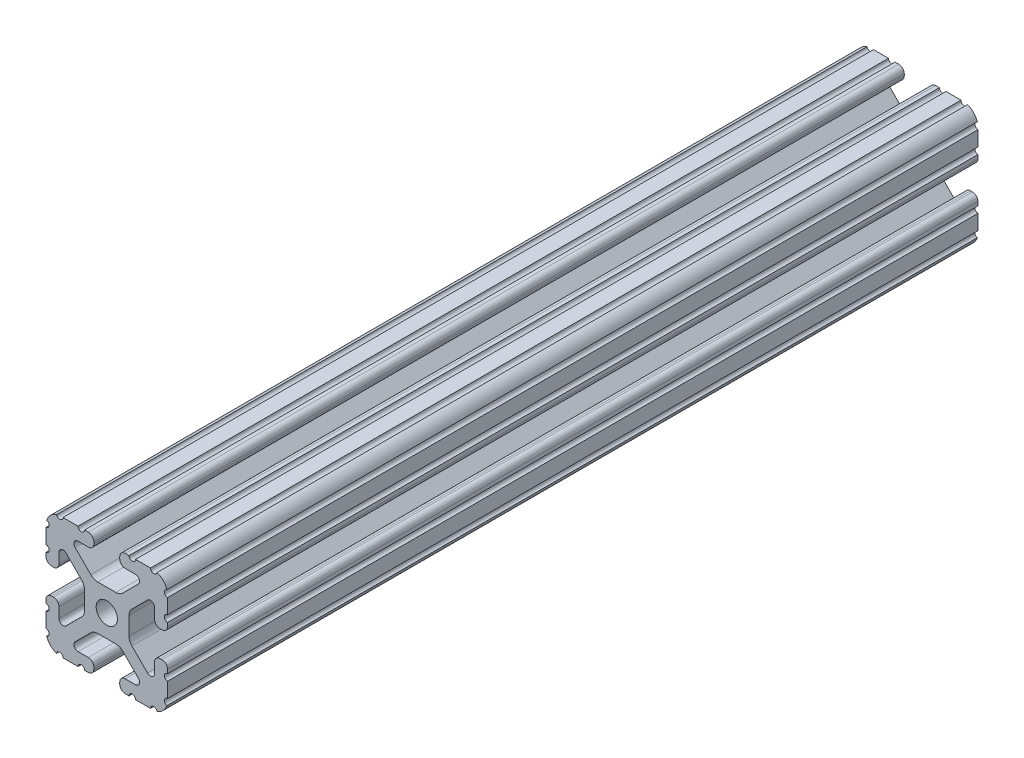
ISO-10303-21;
HEADER;
FILE_DESCRIPTION(('STEP AP214'),'2;1');
FILE_NAME('part.step','',(''),(''),'','','');
FILE_SCHEMA(('AUTOMOTIVE_DESIGN { 1 0 10303 214 1 1 1 1 }'));
ENDSEC;
DATA;
#1=APPLICATION_CONTEXT('core data for automotive mechanical design processes');
#2=APPLICATION_PROTOCOL_DEFINITION('international standard','automotive_design',2000,#1);
#3=PRODUCT_CONTEXT('',#1,'mechanical');
#4=PRODUCT('Part','Part','',(#3));
#5=PRODUCT_RELATED_PRODUCT_CATEGORY('part','',(#4));
#6=PRODUCT_DEFINITION_FORMATION('','',#4);
#7=PRODUCT_DEFINITION_CONTEXT('part definition',#1,'design');
#8=PRODUCT_DEFINITION('design','',#6,#7);
#9=PRODUCT_DEFINITION_SHAPE('','',#8);
#10=(LENGTH_UNIT() NAMED_UNIT(*) SI_UNIT(.MILLI.,.METRE.));
#11=(NAMED_UNIT(*) PLANE_ANGLE_UNIT() SI_UNIT($,.RADIAN.));
#12=(NAMED_UNIT(*) SI_UNIT($,.STERADIAN.) SOLID_ANGLE_UNIT());
#13=UNCERTAINTY_MEASURE_WITH_UNIT(LENGTH_MEASURE(1.E-05),#10,'distance_accuracy_value','');
#14=(GEOMETRIC_REPRESENTATION_CONTEXT(3) GLOBAL_UNCERTAINTY_ASSIGNED_CONTEXT((#13)) GLOBAL_UNIT_ASSIGNED_CONTEXT((#10,
#11,#12)) REPRESENTATION_CONTEXT('',''));
#15=CARTESIAN_POINT('',(0.,0.,0.));
#16=DIRECTION('',(0.,0.,1.));
#17=DIRECTION('',(1.,0.,0.));
#18=AXIS2_PLACEMENT_3D('',#15,#16,#17);
#19=CARTESIAN_POINT('',(5.7912,-19.05,457.2));
#20=DIRECTION('',(0.,1.,0.));
#21=DIRECTION('',(-1.,0.,0.));
#22=AXIS2_PLACEMENT_3D('',#19,#20,#21);
#23=PLANE('',#22);
#24=DIRECTION('',(1.,0.,0.));
#25=VECTOR('',#24,1.);
#26=CARTESIAN_POINT('',(5.7912,-19.05,-203.2));
#27=LINE('',#26,#25);
#28=CARTESIAN_POINT('',(5.7912,-19.05,-203.2));
#29=VERTEX_POINT('',#28);
#30=CARTESIAN_POINT('',(6.96430523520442,-19.05,-203.2));
#31=VERTEX_POINT('',#30);
#32=EDGE_CURVE('E1137',#29,#31,#27,.T.);
#33=ORIENTED_EDGE('',*,*,#32,.F.);
#34=DIRECTION('',(0.,0.,-1.));
#35=VECTOR('',#34,1.);
#36=CARTESIAN_POINT('',(5.7912,-19.05,457.2));
#37=LINE('',#36,#35);
#38=CARTESIAN_POINT('',(5.7912,-19.05,-457.2));
#39=VERTEX_POINT('',#38);
#40=EDGE_CURVE('E1091',#29,#39,#37,.T.);
#41=ORIENTED_EDGE('',*,*,#40,.T.);
#42=DIRECTION('',(1.,0.,0.));
#43=VECTOR('',#42,1.);
#44=CARTESIAN_POINT('',(5.7912,-19.05,-457.2));
#45=LINE('',#44,#43);
#46=CARTESIAN_POINT('',(6.96430523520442,-19.05,-457.2));
#47=VERTEX_POINT('',#46);
#48=EDGE_CURVE('E1003',#39,#47,#45,.T.);
#49=ORIENTED_EDGE('',*,*,#48,.T.);
#50=DIRECTION('',(0.,0.,1.));
#51=VECTOR('',#50,1.);
#52=CARTESIAN_POINT('',(6.96430523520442,-19.05,-457.2));
#53=LINE('',#52,#51);
#54=EDGE_CURVE('E986',#47,#31,#53,.T.);
#55=ORIENTED_EDGE('',*,*,#54,.T.);
#56=EDGE_LOOP('',(#33,#41,#49,#55));
#57=FACE_BOUND('',#56,.T.);
#58=ADVANCED_FACE('F37',(#57),#23,.F.);
#59=CARTESIAN_POINT('',(19.05,-5.7912,457.2));
#60=DIRECTION('',(-1.,0.,0.));
#61=DIRECTION('',(0.,-1.,0.));
#62=AXIS2_PLACEMENT_3D('',#59,#60,#61);
#63=PLANE('',#62);
#64=DIRECTION('',(0.,1.,0.));
#65=VECTOR('',#64,1.);
#66=CARTESIAN_POINT('',(19.05,-5.7912,-203.2));
#67=LINE('',#66,#65);
#68=CARTESIAN_POINT('',(19.05,-13.7234770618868,-203.2));
#69=VERTEX_POINT('',#68);
#70=CARTESIAN_POINT('',(19.05,-8.99630523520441,-203.2));
#71=VERTEX_POINT('',#70);
#72=EDGE_CURVE('E1110',#69,#71,#67,.T.);
#73=ORIENTED_EDGE('',*,*,#72,.F.);
#74=DIRECTION('',(0.,0.,1.));
#75=VECTOR('',#74,1.);
#76=CARTESIAN_POINT('',(19.05,-13.7234770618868,-457.2));
#77=LINE('',#76,#75);
#78=CARTESIAN_POINT('',(19.05,-13.7234770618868,-457.2));
#79=VERTEX_POINT('',#78);
#80=EDGE_CURVE('E989',#69,#79,#77,.F.);
#81=ORIENTED_EDGE('',*,*,#80,.T.);
#82=DIRECTION('',(0.,1.,0.));
#83=VECTOR('',#82,1.);
#84=CARTESIAN_POINT('',(19.05,-5.7912,-457.2));
#85=LINE('',#84,#83);
#86=CARTESIAN_POINT('',(19.05,-8.99630523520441,-457.2));
#87=VERTEX_POINT('',#86);
#88=EDGE_CURVE('E1012',#79,#87,#85,.T.);
#89=ORIENTED_EDGE('',*,*,#88,.T.);
#90=DIRECTION('',(0.,0.,1.));
#91=VECTOR('',#90,1.);
#92=CARTESIAN_POINT('',(19.05,-8.99630523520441,-457.2));
#93=LINE('',#92,#91);
#94=EDGE_CURVE('E996',#87,#71,#93,.T.);
#95=ORIENTED_EDGE('',*,*,#94,.T.);
#96=EDGE_LOOP('',(#73,#81,#89,#95));
#97=FACE_BOUND('',#96,.T.);
#98=ADVANCED_FACE('F1107',(#97),#63,.F.);
#99=CARTESIAN_POINT('',(5.7912,-17.3228,457.2));
#100=DIRECTION('',(0.,0.,-1.));
#101=DIRECTION('',(-1.,0.,0.));
#102=AXIS2_PLACEMENT_3D('',#99,#100,#101);
#103=CYLINDRICAL_SURFACE('',#102,1.7272);
#104=CARTESIAN_POINT('',(5.7912,-17.3228,-203.2));
#105=DIRECTION('',(0.,0.,1.));
#106=DIRECTION('',(1.,0.,0.));
#107=AXIS2_PLACEMENT_3D('',#104,#105,#106);
#108=CIRCLE('',#107,1.7272);
#109=CARTESIAN_POINT('',(4.064,-17.3228,-203.2));
#110=VERTEX_POINT('',#109);
#111=EDGE_CURVE('E1140',#110,#29,#108,.T.);
#112=ORIENTED_EDGE('',*,*,#111,.F.);
#113=DIRECTION('',(0.,0.,-1.));
#114=VECTOR('',#113,1.);
#115=CARTESIAN_POINT('',(4.064,-17.3228,457.2));
#116=LINE('',#115,#114);
#117=CARTESIAN_POINT('',(4.064,-17.3228,-457.2));
#118=VERTEX_POINT('',#117);
#119=EDGE_CURVE('E1061',#110,#118,#116,.T.);
#120=ORIENTED_EDGE('',*,*,#119,.T.);
#121=CARTESIAN_POINT('',(5.7912,-17.3228,-457.2));
#122=DIRECTION('',(0.,0.,1.));
#123=DIRECTION('',(1.,0.,0.));
#124=AXIS2_PLACEMENT_3D('',#121,#122,#123);
#125=CIRCLE('',#124,1.7272);
#126=EDGE_CURVE('E999',#118,#39,#125,.T.);
#127=ORIENTED_EDGE('',*,*,#126,.T.);
#128=ORIENTED_EDGE('',*,*,#40,.F.);
#129=EDGE_LOOP('',(#112,#120,#127,#128));
#130=FACE_BOUND('',#129,.T.);
#131=ADVANCED_FACE('F39',(#130),#103,.T.);
#132=DIRECTION('',(1.,0.,0.));
#133=VECTOR('',#132,1.);
#134=CARTESIAN_POINT('',(5.7912,-19.05,-203.2));
#135=LINE('',#134,#133);
#136=CARTESIAN_POINT('',(8.99630523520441,-19.05,-203.2));
#137=VERTEX_POINT('',#136);
#138=CARTESIAN_POINT('',(13.7234770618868,-19.05,-203.2));
#139=VERTEX_POINT('',#138);
#140=EDGE_CURVE('E1128',#137,#139,#135,.T.);
#141=ORIENTED_EDGE('',*,*,#140,.F.);
#142=DIRECTION('',(0.,0.,1.));
#143=VECTOR('',#142,1.);
#144=CARTESIAN_POINT('',(8.99630523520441,-19.05,-457.2));
#145=LINE('',#144,#143);
#146=CARTESIAN_POINT('',(8.99630523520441,-19.05,-457.2));
#147=VERTEX_POINT('',#146);
#148=EDGE_CURVE('E984',#137,#147,#145,.F.);
#149=ORIENTED_EDGE('',*,*,#148,.T.);
#150=CARTESIAN_POINT('',(13.7234770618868,-19.05,-457.2));
#151=VERTEX_POINT('',#150);
#152=EDGE_CURVE('E1002',#147,#151,#45,.T.);
#153=ORIENTED_EDGE('',*,*,#152,.T.);
#154=DIRECTION('',(0.,0.,1.));
#155=VECTOR('',#154,1.);
#156=CARTESIAN_POINT('',(13.7234770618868,-19.05,-457.2));
#157=LINE('',#156,#155);
#158=EDGE_CURVE('E59',#151,#139,#157,.T.);
#159=ORIENTED_EDGE('',*,*,#158,.T.);
#160=EDGE_LOOP('',(#141,#149,#153,#159));
#161=FACE_BOUND('',#160,.T.);
#162=ADVANCED_FACE('F1125',(#161),#23,.F.);
#163=CARTESIAN_POINT('',(14.3002,-14.3002,457.2));
#164=DIRECTION('',(0.,0.,-1.));
#165=DIRECTION('',(-1.,0.,0.));
#166=AXIS2_PLACEMENT_3D('',#163,#164,#165);
#167=CYLINDRICAL_SURFACE('',#166,4.7498);
#168=CARTESIAN_POINT('',(14.3002,-14.3002,-203.2));
#169=DIRECTION('',(0.,0.,1.));
#170=DIRECTION('',(1.,0.,0.));
#171=AXIS2_PLACEMENT_3D('',#168,#169,#170);
#172=CIRCLE('',#171,4.7498);
#173=CARTESIAN_POINT('',(15.7312177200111,-18.8293045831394,-203.2));
#174=VERTEX_POINT('',#173);
#175=CARTESIAN_POINT('',(18.8293045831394,-15.7312177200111,-203.2));
#176=VERTEX_POINT('',#175);
#177=EDGE_CURVE('E1119',#174,#176,#172,.T.);
#178=ORIENTED_EDGE('',*,*,#177,.F.);
#179=DIRECTION('',(0.,0.,1.));
#180=VECTOR('',#179,1.);
#181=CARTESIAN_POINT('',(15.7312177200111,-18.8293045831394,-1.11022302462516E-13));
#182=LINE('',#181,#180);
#183=CARTESIAN_POINT('',(15.7312177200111,-18.8293045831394,-457.2));
#184=VERTEX_POINT('',#183);
#185=EDGE_CURVE('E981',#174,#184,#182,.F.);
#186=ORIENTED_EDGE('',*,*,#185,.T.);
#187=CARTESIAN_POINT('',(14.3002,-14.3002,-457.2));
#188=DIRECTION('',(0.,0.,1.));
#189=DIRECTION('',(1.,0.,0.));
#190=AXIS2_PLACEMENT_3D('',#187,#188,#189);
#191=CIRCLE('',#190,4.7498);
#192=CARTESIAN_POINT('',(18.8293045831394,-15.7312177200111,-457.2));
#193=VERTEX_POINT('',#192);
#194=EDGE_CURVE('E1006',#184,#193,#191,.T.);
#195=ORIENTED_EDGE('',*,*,#194,.T.);
#196=DIRECTION('',(0.,0.,1.));
#197=VECTOR('',#196,1.);
#198=CARTESIAN_POINT('',(18.8293045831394,-15.7312177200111,-1.11022302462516E-13));
#199=LINE('',#198,#197);
#200=EDGE_CURVE('E991',#193,#176,#199,.T.);
#201=ORIENTED_EDGE('',*,*,#200,.T.);
#202=EDGE_LOOP('',(#178,#186,#195,#201));
#203=FACE_BOUND('',#202,.T.);
#204=ADVANCED_FACE('F1117',(#203),#167,.T.);
#205=DIRECTION('',(0.,1.,0.));
#206=VECTOR('',#205,1.);
#207=CARTESIAN_POINT('',(19.05,-5.7912,-203.2));
#208=LINE('',#207,#206);
#209=CARTESIAN_POINT('',(19.05,-6.96430523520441,-203.2));
#210=VERTEX_POINT('',#209);
#211=CARTESIAN_POINT('',(19.05,-5.7912,-203.2));
#212=VERTEX_POINT('',#211);
#213=EDGE_CURVE('E1542',#210,#212,#208,.T.);
#214=ORIENTED_EDGE('',*,*,#213,.F.);
#215=DIRECTION('',(0.,0.,1.));
#216=VECTOR('',#215,1.);
#217=CARTESIAN_POINT('',(19.05,-6.96430523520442,-457.2));
#218=LINE('',#217,#216);
#219=CARTESIAN_POINT('',(19.05,-6.96430523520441,-457.2));
#220=VERTEX_POINT('',#219);
#221=EDGE_CURVE('E994',#210,#220,#218,.F.);
#222=ORIENTED_EDGE('',*,*,#221,.T.);
#223=CARTESIAN_POINT('',(19.05,-5.7912,-457.2));
#224=VERTEX_POINT('',#223);
#225=EDGE_CURVE('E1009',#220,#224,#85,.T.);
#226=ORIENTED_EDGE('',*,*,#225,.T.);
#227=DIRECTION('',(0.,0.,-1.));
#228=VECTOR('',#227,1.);
#229=CARTESIAN_POINT('',(19.05,-5.7912,457.2));
#230=LINE('',#229,#228);
#231=EDGE_CURVE('E1089',#212,#224,#230,.T.);
#232=ORIENTED_EDGE('',*,*,#231,.F.);
#233=EDGE_LOOP('',(#214,#222,#226,#232));
#234=FACE_BOUND('',#233,.T.);
#235=ADVANCED_FACE('F1569',(#234),#63,.F.);
#236=CARTESIAN_POINT('',(17.3228,-5.7912,457.2));
#237=DIRECTION('',(0.,0.,-1.));
#238=DIRECTION('',(-1.,0.,0.));
#239=AXIS2_PLACEMENT_3D('',#236,#237,#238);
#240=CYLINDRICAL_SURFACE('',#239,1.7272);
#241=CARTESIAN_POINT('',(17.3228,-5.7912,-203.2));
#242=DIRECTION('',(0.,0.,1.));
#243=DIRECTION('',(1.,0.,0.));
#244=AXIS2_PLACEMENT_3D('',#241,#242,#243);
#245=CIRCLE('',#244,1.7272);
#246=CARTESIAN_POINT('',(17.3228,-4.064,-203.2));
#247=VERTEX_POINT('',#246);
#248=EDGE_CURVE('E1540',#212,#247,#245,.T.);
#249=ORIENTED_EDGE('',*,*,#248,.F.);
#250=ORIENTED_EDGE('',*,*,#231,.T.);
#251=CARTESIAN_POINT('',(17.3228,-5.7912,-457.2));
#252=DIRECTION('',(0.,0.,1.));
#253=DIRECTION('',(-1.,0.,0.));
#254=AXIS2_PLACEMENT_3D('',#251,#252,#253);
#255=CIRCLE('',#254,1.7272);
#256=CARTESIAN_POINT('',(17.3228,-4.064,-457.2));
#257=VERTEX_POINT('',#256);
#258=EDGE_CURVE('E1013',#224,#257,#255,.T.);
#259=ORIENTED_EDGE('',*,*,#258,.T.);
#260=DIRECTION('',(0.,0.,-1.));
#261=VECTOR('',#260,1.);
#262=CARTESIAN_POINT('',(17.3228,-4.064,457.2));
#263=LINE('',#262,#261);
#264=EDGE_CURVE('E1087',#247,#257,#263,.T.);
#265=ORIENTED_EDGE('',*,*,#264,.F.);
#266=EDGE_LOOP('',(#249,#250,#259,#265));
#267=FACE_BOUND('',#266,.T.);
#268=ADVANCED_FACE('F2316',(#267),#240,.T.);
#269=CARTESIAN_POINT('',(16.7132,-4.064,457.2));
#270=DIRECTION('',(0.,-1.,0.));
#271=DIRECTION('',(1.,0.,0.));
#272=AXIS2_PLACEMENT_3D('',#269,#270,#271);
#273=PLANE('',#272);
#274=DIRECTION('',(-1.,0.,0.));
#275=VECTOR('',#274,1.);
#276=CARTESIAN_POINT('',(16.7132,-4.064,-203.2));
#277=LINE('',#276,#275);
#278=CARTESIAN_POINT('',(16.7132,-4.064,-203.2));
#279=VERTEX_POINT('',#278);
#280=EDGE_CURVE('E1538',#247,#279,#277,.T.);
#281=ORIENTED_EDGE('',*,*,#280,.F.);
#282=ORIENTED_EDGE('',*,*,#264,.T.);
#283=DIRECTION('',(-1.,0.,0.));
#284=VECTOR('',#283,1.);
#285=CARTESIAN_POINT('',(16.7132,-4.064,-457.2));
#286=LINE('',#285,#284);
#287=CARTESIAN_POINT('',(16.7132,-4.064,-457.2));
#288=VERTEX_POINT('',#287);
#289=EDGE_CURVE('E1016',#257,#288,#286,.T.);
#290=ORIENTED_EDGE('',*,*,#289,.T.);
#291=DIRECTION('',(0.,0.,-1.));
#292=VECTOR('',#291,1.);
#293=CARTESIAN_POINT('',(16.7132,-4.064,457.2));
#294=LINE('',#293,#292);
#295=EDGE_CURVE('E1085',#279,#288,#294,.T.);
#296=ORIENTED_EDGE('',*,*,#295,.F.);
#297=EDGE_LOOP('',(#281,#282,#290,#296));
#298=FACE_BOUND('',#297,.T.);
#299=ADVANCED_FACE('F2306',(#298),#273,.F.);
#300=CARTESIAN_POINT('',(16.7132,-5.7912,457.2));
#301=DIRECTION('',(0.,0.,-1.));
#302=DIRECTION('',(-1.,0.,0.));
#303=AXIS2_PLACEMENT_3D('',#300,#301,#302);
#304=CYLINDRICAL_SURFACE('',#303,1.7272);
#305=CARTESIAN_POINT('',(16.7132,-5.7912,-203.2));
#306=DIRECTION('',(0.,0.,1.));
#307=DIRECTION('',(1.,0.,0.));
#308=AXIS2_PLACEMENT_3D('',#305,#306,#307);
#309=CIRCLE('',#308,1.7272);
#310=CARTESIAN_POINT('',(14.986,-5.7912,-203.2));
#311=VERTEX_POINT('',#310);
#312=EDGE_CURVE('E1536',#279,#311,#309,.T.);
#313=ORIENTED_EDGE('',*,*,#312,.F.);
#314=ORIENTED_EDGE('',*,*,#295,.T.);
#315=CARTESIAN_POINT('',(16.7132,-5.7912,-457.2));
#316=DIRECTION('',(0.,0.,1.));
#317=DIRECTION('',(-1.,0.,0.));
#318=AXIS2_PLACEMENT_3D('',#315,#316,#317);
#319=CIRCLE('',#318,1.7272);
#320=CARTESIAN_POINT('',(14.986,-5.7912,-457.2));
#321=VERTEX_POINT('',#320);
#322=EDGE_CURVE('E1019',#288,#321,#319,.T.);
#323=ORIENTED_EDGE('',*,*,#322,.T.);
#324=DIRECTION('',(0.,0.,-1.));
#325=VECTOR('',#324,1.);
#326=CARTESIAN_POINT('',(14.986,-5.7912,457.2));
#327=LINE('',#326,#325);
#328=EDGE_CURVE('E1083',#311,#321,#327,.T.);
#329=ORIENTED_EDGE('',*,*,#328,.F.);
#330=EDGE_LOOP('',(#313,#314,#323,#329));
#331=FACE_BOUND('',#330,.T.);
#332=ADVANCED_FACE('F2296',(#331),#304,.T.);
#333=CARTESIAN_POINT('',(14.986,-8.99630523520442,457.2));
#334=DIRECTION('',(1.,0.,0.));
#335=DIRECTION('',(0.,0.,-1.));
#336=AXIS2_PLACEMENT_3D('',#333,#334,#335);
#337=PLANE('',#336);
#338=DIRECTION('',(0.,-1.,0.));
#339=VECTOR('',#338,1.);
#340=CARTESIAN_POINT('',(14.986,-8.99630523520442,-203.2));
#341=LINE('',#340,#339);
#342=CARTESIAN_POINT('',(14.986,-8.99630523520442,-203.2));
#343=VERTEX_POINT('',#342);
#344=EDGE_CURVE('E1534',#311,#343,#341,.T.);
#345=ORIENTED_EDGE('',*,*,#344,.F.);
#346=ORIENTED_EDGE('',*,*,#328,.T.);
#347=DIRECTION('',(0.,-1.,0.));
#348=VECTOR('',#347,1.);
#349=CARTESIAN_POINT('',(14.986,-8.99630523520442,-457.2));
#350=LINE('',#349,#348);
#351=CARTESIAN_POINT('',(14.986,-8.99630523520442,-457.2));
#352=VERTEX_POINT('',#351);
#353=EDGE_CURVE('E1022',#321,#352,#350,.T.);
#354=ORIENTED_EDGE('',*,*,#353,.T.);
#355=DIRECTION('',(0.,0.,-1.));
#356=VECTOR('',#355,1.);
#357=CARTESIAN_POINT('',(14.986,-8.99630523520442,457.2));
#358=LINE('',#357,#356);
#359=EDGE_CURVE('E1081',#343,#352,#358,.T.);
#360=ORIENTED_EDGE('',*,*,#359,.F.);
#361=EDGE_LOOP('',(#345,#346,#354,#360));
#362=FACE_BOUND('',#361,.T.);
#363=ADVANCED_FACE('F2286',(#362),#337,.F.);
#364=CARTESIAN_POINT('',(13.6953052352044,-8.99630523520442,457.2));
#365=DIRECTION('',(0.,0.,-1.));
#366=DIRECTION('',(-1.,0.,0.));
#367=AXIS2_PLACEMENT_3D('',#364,#365,#366);
#368=CYLINDRICAL_SURFACE('',#367,1.29069476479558);
#369=CARTESIAN_POINT('',(13.6953052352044,-8.99630523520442,-203.2));
#370=DIRECTION('',(0.,0.,1.));
#371=DIRECTION('',(1.,0.,0.));
#372=AXIS2_PLACEMENT_3D('',#369,#370,#371);
#373=CIRCLE('',#372,1.29069476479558);
#374=CARTESIAN_POINT('',(12.7826462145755,-9.90896425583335,-203.2));
#375=VERTEX_POINT('',#374);
#376=EDGE_CURVE('E1532',#343,#375,#373,.F.);
#377=ORIENTED_EDGE('',*,*,#376,.F.);
#378=ORIENTED_EDGE('',*,*,#359,.T.);
#379=CARTESIAN_POINT('',(13.6953052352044,-8.99630523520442,-457.2));
#380=DIRECTION('',(0.,0.,-1.));
#381=DIRECTION('',(1.,0.,0.));
#382=AXIS2_PLACEMENT_3D('',#379,#380,#381);
#383=CIRCLE('',#382,1.29069476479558);
#384=CARTESIAN_POINT('',(12.7826462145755,-9.90896425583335,-457.2));
#385=VERTEX_POINT('',#384);
#386=EDGE_CURVE('E1025',#352,#385,#383,.T.);
#387=ORIENTED_EDGE('',*,*,#386,.T.);
#388=DIRECTION('',(0.,0.,-1.));
#389=VECTOR('',#388,1.);
#390=CARTESIAN_POINT('',(12.7826462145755,-9.90896425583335,457.2));
#391=LINE('',#390,#389);
#392=EDGE_CURVE('E1079',#375,#385,#391,.T.);
#393=ORIENTED_EDGE('',*,*,#392,.F.);
#394=EDGE_LOOP('',(#377,#378,#387,#393));
#395=FACE_BOUND('',#394,.T.);
#396=ADVANCED_FACE('F2276',(#395),#368,.F.);
#397=CARTESIAN_POINT('',(12.7826462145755,-9.90896425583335,457.2));
#398=DIRECTION('',(-0.707106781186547,-0.707106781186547,0.));
#399=DIRECTION('',(0.707106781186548,-0.707106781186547,0.));
#400=AXIS2_PLACEMENT_3D('',#397,#398,#399);
#401=PLANE('',#400);
#402=DIRECTION('',(-0.707106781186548,0.707106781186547,0.));
#403=VECTOR('',#402,1.);
#404=CARTESIAN_POINT('',(12.7826462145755,-9.90896425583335,-203.2));
#405=LINE('',#404,#403);
#406=CARTESIAN_POINT('',(7.8888977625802,-5.01521580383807,-203.2));
#407=VERTEX_POINT('',#406);
#408=EDGE_CURVE('E1530',#375,#407,#405,.T.);
#409=ORIENTED_EDGE('',*,*,#408,.F.);
#410=ORIENTED_EDGE('',*,*,#392,.T.);
#411=DIRECTION('',(-0.707106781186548,0.707106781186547,0.));
#412=VECTOR('',#411,1.);
#413=CARTESIAN_POINT('',(12.7826462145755,-9.90896425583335,-457.2));
#414=LINE('',#413,#412);
#415=CARTESIAN_POINT('',(7.8888977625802,-5.01521580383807,-457.2));
#416=VERTEX_POINT('',#415);
#417=EDGE_CURVE('E1028',#385,#416,#414,.T.);
#418=ORIENTED_EDGE('',*,*,#417,.T.);
#419=DIRECTION('',(0.,0.,-1.));
#420=VECTOR('',#419,1.);
#421=CARTESIAN_POINT('',(7.8888977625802,-5.01521580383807,457.2));
#422=LINE('',#421,#420);
#423=EDGE_CURVE('E1077',#407,#416,#422,.T.);
#424=ORIENTED_EDGE('',*,*,#423,.F.);
#425=EDGE_LOOP('',(#409,#410,#418,#424));
#426=FACE_BOUND('',#425,.T.);
#427=ADVANCED_FACE('F2266',(#426),#401,.F.);
#428=CARTESIAN_POINT('',(10.0711,-2.83301356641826,457.2));
#429=DIRECTION('',(0.,0.,-1.));
#430=DIRECTION('',(-1.,0.,0.));
#431=AXIS2_PLACEMENT_3D('',#428,#429,#430);
#432=CYLINDRICAL_SURFACE('',#431,3.0861);
#433=CARTESIAN_POINT('',(10.0711,-2.83301356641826,-203.2));
#434=DIRECTION('',(0.,0.,1.));
#435=DIRECTION('',(1.,0.,0.));
#436=AXIS2_PLACEMENT_3D('',#433,#434,#435);
#437=CIRCLE('',#436,3.0861);
#438=CARTESIAN_POINT('',(6.985,-2.83301356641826,-203.2));
#439=VERTEX_POINT('',#438);
#440=EDGE_CURVE('E1528',#407,#439,#437,.F.);
#441=ORIENTED_EDGE('',*,*,#440,.F.);
#442=ORIENTED_EDGE('',*,*,#423,.T.);
#443=CARTESIAN_POINT('',(10.0711,-2.83301356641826,-457.2));
#444=DIRECTION('',(0.,0.,-1.));
#445=DIRECTION('',(-1.,0.,0.));
#446=AXIS2_PLACEMENT_3D('',#443,#444,#445);
#447=CIRCLE('',#446,3.0861);
#448=CARTESIAN_POINT('',(6.985,-2.83301356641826,-457.2));
#449=VERTEX_POINT('',#448);
#450=EDGE_CURVE('E1031',#416,#449,#447,.T.);
#451=ORIENTED_EDGE('',*,*,#450,.T.);
#452=DIRECTION('',(0.,0.,-1.));
#453=VECTOR('',#452,1.);
#454=CARTESIAN_POINT('',(6.985,-2.83301356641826,457.2));
#455=LINE('',#454,#453);
#456=EDGE_CURVE('E1075',#439,#449,#455,.T.);
#457=ORIENTED_EDGE('',*,*,#456,.F.);
#458=EDGE_LOOP('',(#441,#442,#451,#457));
#459=FACE_BOUND('',#458,.T.);
#460=ADVANCED_FACE('F1560',(#459),#432,.F.);
#461=CARTESIAN_POINT('',(6.985,0.,457.2));
#462=DIRECTION('',(-1.,0.,0.));
#463=DIRECTION('',(0.,0.,1.));
#464=AXIS2_PLACEMENT_3D('',#461,#462,#463);
#465=PLANE('',#464);
#466=DIRECTION('',(0.,1.,0.));
#467=VECTOR('',#466,1.);
#468=CARTESIAN_POINT('',(6.985,0.,-203.2));
#469=LINE('',#468,#467);
#470=CARTESIAN_POINT('',(6.985,2.83301356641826,-203.2));
#471=VERTEX_POINT('',#470);
#472=EDGE_CURVE('E1526',#439,#471,#469,.T.);
#473=ORIENTED_EDGE('',*,*,#472,.F.);
#474=ORIENTED_EDGE('',*,*,#456,.T.);
#475=DIRECTION('',(0.,1.,0.));
#476=VECTOR('',#475,1.);
#477=CARTESIAN_POINT('',(6.985,0.,-457.2));
#478=LINE('',#477,#476);
#479=CARTESIAN_POINT('',(6.985,2.83301356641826,-457.2));
#480=VERTEX_POINT('',#479);
#481=EDGE_CURVE('E1034',#449,#480,#478,.T.);
#482=ORIENTED_EDGE('',*,*,#481,.T.);
#483=DIRECTION('',(0.,0.,-1.));
#484=VECTOR('',#483,1.);
#485=CARTESIAN_POINT('',(6.985,2.83301356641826,457.2));
#486=LINE('',#485,#484);
#487=EDGE_CURVE('E838',#471,#480,#486,.T.);
#488=ORIENTED_EDGE('',*,*,#487,.F.);
#489=EDGE_LOOP('',(#473,#474,#482,#488));
#490=FACE_BOUND('',#489,.T.);
#491=ADVANCED_FACE('F1552',(#490),#465,.F.);
#492=CARTESIAN_POINT('',(0.,0.,457.2));
#493=DIRECTION('',(0.,0.,-1.));
#494=DIRECTION('',(-1.,0.,0.));
#495=AXIS2_PLACEMENT_3D('',#492,#493,#494);
#496=CYLINDRICAL_SURFACE('',#495,3.32740000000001);
#497=CARTESIAN_POINT('',(0.,0.,-457.2));
#498=DIRECTION('',(0.,0.,-1.));
#499=DIRECTION('',(1.,0.,0.));
#500=AXIS2_PLACEMENT_3D('',#497,#498,#499);
#501=CIRCLE('',#500,3.32740000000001);
#502=CARTESIAN_POINT('',(-3.32740000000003,0.,-457.2));
#503=VERTEX_POINT('',#502);
#504=EDGE_CURVE('E1037',#503,#503,#501,.T.);
#505=CARTESIAN_POINT('',(0.,0.,-203.2));
#506=DIRECTION('',(0.,0.,1.));
#507=DIRECTION('',(1.,0.,0.));
#508=AXIS2_PLACEMENT_3D('',#505,#506,#507);
#509=CIRCLE('',#508,3.32740000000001);
#510=CARTESIAN_POINT('',(-3.32740000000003,0.,-203.2));
#511=VERTEX_POINT('',#510);
#512=EDGE_CURVE('E1377',#511,#511,#509,.F.);
#513=CARTESIAN_POINT('',(-3.32740000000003,0.,-457.2));
#514=CARTESIAN_POINT('',(-3.32740000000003,0.,-454.554166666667));
#515=CARTESIAN_POINT('',(-3.32740000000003,0.,-451.908333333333));
#516=CARTESIAN_POINT('',(-3.32740000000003,0.,-446.616666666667));
#517=CARTESIAN_POINT('',(-3.32740000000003,0.,-443.970833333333));
#518=CARTESIAN_POINT('',(-3.32740000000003,0.,-438.679166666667));
#519=CARTESIAN_POINT('',(-3.32740000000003,0.,-436.033333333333));
#520=CARTESIAN_POINT('',(-3.32740000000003,0.,-430.741666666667));
#521=CARTESIAN_POINT('',(-3.32740000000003,0.,-428.095833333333));
#522=CARTESIAN_POINT('',(-3.32740000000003,0.,-422.804166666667));
#523=CARTESIAN_POINT('',(-3.32740000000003,0.,-420.158333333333));
#524=CARTESIAN_POINT('',(-3.32740000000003,0.,-414.866666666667));
#525=CARTESIAN_POINT('',(-3.32740000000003,0.,-412.220833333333));
#526=CARTESIAN_POINT('',(-3.32740000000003,0.,-406.929166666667));
#527=CARTESIAN_POINT('',(-3.32740000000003,0.,-404.283333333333));
#528=CARTESIAN_POINT('',(-3.32740000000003,0.,-398.991666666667));
#529=CARTESIAN_POINT('',(-3.32740000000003,0.,-396.345833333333));
#530=CARTESIAN_POINT('',(-3.32740000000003,0.,-391.054166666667));
#531=CARTESIAN_POINT('',(-3.32740000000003,0.,-388.408333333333));
#532=CARTESIAN_POINT('',(-3.32740000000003,0.,-383.116666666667));
#533=CARTESIAN_POINT('',(-3.32740000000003,0.,-380.470833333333));
#534=CARTESIAN_POINT('',(-3.32740000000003,0.,-375.179166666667));
#535=CARTESIAN_POINT('',(-3.32740000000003,0.,-372.533333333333));
#536=CARTESIAN_POINT('',(-3.32740000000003,0.,-367.241666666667));
#537=CARTESIAN_POINT('',(-3.32740000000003,0.,-364.595833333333));
#538=CARTESIAN_POINT('',(-3.32740000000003,0.,-359.304166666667));
#539=CARTESIAN_POINT('',(-3.32740000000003,0.,-356.658333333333));
#540=CARTESIAN_POINT('',(-3.32740000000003,0.,-351.366666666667));
#541=CARTESIAN_POINT('',(-3.32740000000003,0.,-348.720833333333));
#542=CARTESIAN_POINT('',(-3.32740000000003,0.,-343.429166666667));
#543=CARTESIAN_POINT('',(-3.32740000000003,0.,-340.783333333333));
#544=CARTESIAN_POINT('',(-3.32740000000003,0.,-335.491666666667));
#545=CARTESIAN_POINT('',(-3.32740000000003,0.,-332.845833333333));
#546=CARTESIAN_POINT('',(-3.32740000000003,0.,-327.554166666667));
#547=CARTESIAN_POINT('',(-3.32740000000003,0.,-324.908333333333));
#548=CARTESIAN_POINT('',(-3.32740000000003,0.,-319.616666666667));
#549=CARTESIAN_POINT('',(-3.32740000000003,0.,-316.970833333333));
#550=CARTESIAN_POINT('',(-3.32740000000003,0.,-311.679166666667));
#551=CARTESIAN_POINT('',(-3.32740000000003,0.,-309.033333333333));
#552=CARTESIAN_POINT('',(-3.32740000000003,0.,-303.741666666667));
#553=CARTESIAN_POINT('',(-3.32740000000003,0.,-301.095833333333));
#554=CARTESIAN_POINT('',(-3.32740000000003,0.,-295.804166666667));
#555=CARTESIAN_POINT('',(-3.32740000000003,0.,-293.158333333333));
#556=CARTESIAN_POINT('',(-3.32740000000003,0.,-287.866666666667));
#557=CARTESIAN_POINT('',(-3.32740000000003,0.,-285.220833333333));
#558=CARTESIAN_POINT('',(-3.32740000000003,0.,-279.929166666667));
#559=CARTESIAN_POINT('',(-3.32740000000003,0.,-277.283333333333));
#560=CARTESIAN_POINT('',(-3.32740000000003,0.,-271.991666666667));
#561=CARTESIAN_POINT('',(-3.32740000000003,0.,-269.345833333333));
#562=CARTESIAN_POINT('',(-3.32740000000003,0.,-264.054166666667));
#563=CARTESIAN_POINT('',(-3.32740000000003,0.,-261.408333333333));
#564=CARTESIAN_POINT('',(-3.32740000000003,0.,-256.116666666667));
#565=CARTESIAN_POINT('',(-3.32740000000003,0.,-253.470833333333));
#566=CARTESIAN_POINT('',(-3.32740000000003,0.,-248.179166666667));
#567=CARTESIAN_POINT('',(-3.32740000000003,0.,-245.533333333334));
#568=CARTESIAN_POINT('',(-3.32740000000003,0.,-240.241666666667));
#569=CARTESIAN_POINT('',(-3.32740000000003,0.,-237.595833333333));
#570=CARTESIAN_POINT('',(-3.32740000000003,0.,-232.304166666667));
#571=CARTESIAN_POINT('',(-3.32740000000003,0.,-229.658333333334));
#572=CARTESIAN_POINT('',(-3.32740000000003,0.,-224.366666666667));
#573=CARTESIAN_POINT('',(-3.32740000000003,0.,-221.720833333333));
#574=CARTESIAN_POINT('',(-3.32740000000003,0.,-216.429166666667));
#575=CARTESIAN_POINT('',(-3.32740000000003,0.,-213.783333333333));
#576=CARTESIAN_POINT('',(-3.32740000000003,0.,-208.491666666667));
#577=CARTESIAN_POINT('',(-3.32740000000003,0.,-205.845833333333));
#578=CARTESIAN_POINT('',(-3.32740000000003,0.,-203.2));
#579=B_SPLINE_CURVE_WITH_KNOTS('',3,(#513,#514,#515,#516,#517,#518,#519,#520,#521,#522,#523,
#524,#525,#526,#527,#528,#529,#530,#531,#532,#533,#534,#535,#536,#537,#538,#539,#540,#541,#542,
#543,#544,#545,#546,#547,#548,#549,#550,#551,#552,#553,#554,#555,#556,#557,#558,#559,#560,#561,
#562,#563,#564,#565,#566,#567,#568,#569,#570,#571,#572,#573,#574,#575,#576,#577,#578),
.UNSPECIFIED.,.F.,.F.,(4,2,2,2,2,2,2,2,2,2,2,2,2,2,2,2,2,2,2,2,2,2,2,2,2,2,2,2,2,2,2,2,4),(0.,
7.93750000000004,15.875,23.8125,31.7499999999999,39.6875,47.6249999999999,55.5625,
63.4999999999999,71.4374999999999,79.375,87.3124999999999,95.2499999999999,103.1875,111.125,
119.0625,127.,134.9375,142.875,150.8125,158.75,166.6875,174.625,182.5625,190.5,198.4375,206.375,
214.3125,222.25,230.1875,238.125,246.0625,254.),.UNSPECIFIED.);
#580=EDGE_CURVE('BSEAM1549',#503,#511,#579,.T.);
#581=ORIENTED_EDGE('',*,*,#504,.T.);
#582=ORIENTED_EDGE('',*,*,#512,.F.);
#583=ORIENTED_EDGE('',*,*,#580,.T.);
#584=ORIENTED_EDGE('',*,*,#580,.F.);
#585=EDGE_LOOP('',(#581,#583,#582,#584));
#586=FACE_BOUND('',#585,.T.);
#587=ADVANCED_FACE('F1549',(#586),#496,.F.);
#588=CARTESIAN_POINT('',(0.,-6.985,457.2));
#589=DIRECTION('',(0.,1.,0.));
#590=DIRECTION('',(0.,0.,1.));
#591=AXIS2_PLACEMENT_3D('',#588,#589,#590);
#592=PLANE('',#591);
#593=DIRECTION('',(1.,0.,0.));
#594=VECTOR('',#593,1.);
#595=CARTESIAN_POINT('',(0.,-6.985,-203.2));
#596=LINE('',#595,#594);
#597=CARTESIAN_POINT('',(-2.83301356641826,-6.985,-203.2));
#598=VERTEX_POINT('',#597);
#599=CARTESIAN_POINT('',(2.83301356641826,-6.985,-203.2));
#600=VERTEX_POINT('',#599);
#601=EDGE_CURVE('E1484',#598,#600,#596,.T.);
#602=ORIENTED_EDGE('',*,*,#601,.F.);
#603=DIRECTION('',(0.,0.,-1.));
#604=VECTOR('',#603,1.);
#605=CARTESIAN_POINT('',(-2.83301356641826,-6.985,457.2));
#606=LINE('',#605,#604);
#607=CARTESIAN_POINT('',(-2.83301356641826,-6.985,-457.2));
#608=VERTEX_POINT('',#607);
#609=EDGE_CURVE('E952',#598,#608,#606,.T.);
#610=ORIENTED_EDGE('',*,*,#609,.T.);
#611=DIRECTION('',(1.,0.,0.));
#612=VECTOR('',#611,1.);
#613=CARTESIAN_POINT('',(0.,-6.985,-457.2));
#614=LINE('',#613,#612);
#615=CARTESIAN_POINT('',(2.83301356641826,-6.985,-457.2));
#616=VERTEX_POINT('',#615);
#617=EDGE_CURVE('E1040',#608,#616,#614,.T.);
#618=ORIENTED_EDGE('',*,*,#617,.T.);
#619=DIRECTION('',(0.,0.,-1.));
#620=VECTOR('',#619,1.);
#621=CARTESIAN_POINT('',(2.83301356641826,-6.985,457.2));
#622=LINE('',#621,#620);
#623=EDGE_CURVE('E1073',#600,#616,#622,.T.);
#624=ORIENTED_EDGE('',*,*,#623,.F.);
#625=EDGE_LOOP('',(#602,#610,#618,#624));
#626=FACE_BOUND('',#625,.T.);
#627=ADVANCED_FACE('F1551',(#626),#592,.F.);
#628=CARTESIAN_POINT('',(2.83301356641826,-10.0711,457.2));
#629=DIRECTION('',(0.,0.,-1.));
#630=DIRECTION('',(-1.,0.,0.));
#631=AXIS2_PLACEMENT_3D('',#628,#629,#630);
#632=CYLINDRICAL_SURFACE('',#631,3.0861);
#633=CARTESIAN_POINT('',(2.83301356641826,-10.0711,-203.2));
#634=DIRECTION('',(0.,0.,1.));
#635=DIRECTION('',(1.,0.,0.));
#636=AXIS2_PLACEMENT_3D('',#633,#634,#635);
#637=CIRCLE('',#636,3.0861);
#638=CARTESIAN_POINT('',(5.01521580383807,-7.8888977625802,-203.2));
#639=VERTEX_POINT('',#638);
#640=EDGE_CURVE('E1490',#600,#639,#637,.F.);
#641=ORIENTED_EDGE('',*,*,#640,.F.);
#642=ORIENTED_EDGE('',*,*,#623,.T.);
#643=CARTESIAN_POINT('',(2.83301356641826,-10.0711,-457.2));
#644=DIRECTION('',(0.,0.,-1.));
#645=DIRECTION('',(-1.,0.,0.));
#646=AXIS2_PLACEMENT_3D('',#643,#644,#645);
#647=CIRCLE('',#646,3.0861);
#648=CARTESIAN_POINT('',(5.01521580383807,-7.8888977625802,-457.2));
#649=VERTEX_POINT('',#648);
#650=EDGE_CURVE('E1043',#616,#649,#647,.T.);
#651=ORIENTED_EDGE('',*,*,#650,.T.);
#652=DIRECTION('',(0.,0.,-1.));
#653=VECTOR('',#652,1.);
#654=CARTESIAN_POINT('',(5.01521580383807,-7.8888977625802,457.2));
#655=LINE('',#654,#653);
#656=EDGE_CURVE('E1071',#639,#649,#655,.T.);
#657=ORIENTED_EDGE('',*,*,#656,.F.);
#658=EDGE_LOOP('',(#641,#642,#651,#657));
#659=FACE_BOUND('',#658,.T.);
#660=ADVANCED_FACE('F1174',(#659),#632,.F.);
#661=CARTESIAN_POINT('',(5.01521580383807,-7.8888977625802,457.2));
#662=DIRECTION('',(0.707106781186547,0.707106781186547,0.));
#663=DIRECTION('',(-0.707106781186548,0.707106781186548,0.));
#664=AXIS2_PLACEMENT_3D('',#661,#662,#663);
#665=PLANE('',#664);
#666=DIRECTION('',(0.707106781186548,-0.707106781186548,0.));
#667=VECTOR('',#666,1.);
#668=CARTESIAN_POINT('',(5.01521580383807,-7.8888977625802,-203.2));
#669=LINE('',#668,#667);
#670=CARTESIAN_POINT('',(9.90896425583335,-12.7826462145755,-203.2));
#671=VERTEX_POINT('',#670);
#672=EDGE_CURVE('E1171',#639,#671,#669,.T.);
#673=ORIENTED_EDGE('',*,*,#672,.F.);
#674=ORIENTED_EDGE('',*,*,#656,.T.);
#675=DIRECTION('',(0.707106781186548,-0.707106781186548,0.));
#676=VECTOR('',#675,1.);
#677=CARTESIAN_POINT('',(5.01521580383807,-7.8888977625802,-457.2));
#678=LINE('',#677,#676);
#679=CARTESIAN_POINT('',(9.90896425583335,-12.7826462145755,-457.2));
#680=VERTEX_POINT('',#679);
#681=EDGE_CURVE('E1046',#649,#680,#678,.T.);
#682=ORIENTED_EDGE('',*,*,#681,.T.);
#683=DIRECTION('',(0.,0.,-1.));
#684=VECTOR('',#683,1.);
#685=CARTESIAN_POINT('',(9.90896425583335,-12.7826462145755,457.2));
#686=LINE('',#685,#684);
#687=EDGE_CURVE('E1069',#671,#680,#686,.T.);
#688=ORIENTED_EDGE('',*,*,#687,.F.);
#689=EDGE_LOOP('',(#673,#674,#682,#688));
#690=FACE_BOUND('',#689,.T.);
#691=ADVANCED_FACE('F1169',(#690),#665,.F.);
#692=CARTESIAN_POINT('',(8.99630523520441,-13.6953052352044,457.2));
#693=DIRECTION('',(0.,0.,-1.));
#694=DIRECTION('',(-1.,0.,0.));
#695=AXIS2_PLACEMENT_3D('',#692,#693,#694);
#696=CYLINDRICAL_SURFACE('',#695,1.29069476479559);
#697=CARTESIAN_POINT('',(8.99630523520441,-13.6953052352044,-203.2));
#698=DIRECTION('',(0.,0.,1.));
#699=DIRECTION('',(1.,0.,0.));
#700=AXIS2_PLACEMENT_3D('',#697,#698,#699);
#701=CIRCLE('',#700,1.29069476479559);
#702=CARTESIAN_POINT('',(8.99630523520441,-14.986,-203.2));
#703=VERTEX_POINT('',#702);
#704=EDGE_CURVE('E1166',#671,#703,#701,.F.);
#705=ORIENTED_EDGE('',*,*,#704,.F.);
#706=ORIENTED_EDGE('',*,*,#687,.T.);
#707=CARTESIAN_POINT('',(8.99630523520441,-13.6953052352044,-457.2));
#708=DIRECTION('',(0.,0.,-1.));
#709=DIRECTION('',(1.,0.,0.));
#710=AXIS2_PLACEMENT_3D('',#707,#708,#709);
#711=CIRCLE('',#710,1.29069476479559);
#712=CARTESIAN_POINT('',(8.99630523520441,-14.986,-457.2));
#713=VERTEX_POINT('',#712);
#714=EDGE_CURVE('E1049',#680,#713,#711,.T.);
#715=ORIENTED_EDGE('',*,*,#714,.T.);
#716=DIRECTION('',(0.,0.,-1.));
#717=VECTOR('',#716,1.);
#718=CARTESIAN_POINT('',(8.99630523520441,-14.986,457.2));
#719=LINE('',#718,#717);
#720=EDGE_CURVE('E1067',#703,#713,#719,.T.);
#721=ORIENTED_EDGE('',*,*,#720,.F.);
#722=EDGE_LOOP('',(#705,#706,#715,#721));
#723=FACE_BOUND('',#722,.T.);
#724=ADVANCED_FACE('F1164',(#723),#696,.F.);
#725=CARTESIAN_POINT('',(5.7912,-14.986,457.2));
#726=DIRECTION('',(0.,-1.,0.));
#727=DIRECTION('',(1.,0.,0.));
#728=AXIS2_PLACEMENT_3D('',#725,#726,#727);
#729=PLANE('',#728);
#730=DIRECTION('',(-1.,0.,0.));
#731=VECTOR('',#730,1.);
#732=CARTESIAN_POINT('',(5.7912,-14.986,-203.2));
#733=LINE('',#732,#731);
#734=CARTESIAN_POINT('',(5.7912,-14.986,-203.2));
#735=VERTEX_POINT('',#734);
#736=EDGE_CURVE('E1502',#703,#735,#733,.T.);
#737=ORIENTED_EDGE('',*,*,#736,.F.);
#738=ORIENTED_EDGE('',*,*,#720,.T.);
#739=DIRECTION('',(-1.,0.,0.));
#740=VECTOR('',#739,1.);
#741=CARTESIAN_POINT('',(5.7912,-14.986,-457.2));
#742=LINE('',#741,#740);
#743=CARTESIAN_POINT('',(5.7912,-14.986,-457.2));
#744=VERTEX_POINT('',#743);
#745=EDGE_CURVE('E1052',#713,#744,#742,.T.);
#746=ORIENTED_EDGE('',*,*,#745,.T.);
#747=DIRECTION('',(0.,0.,-1.));
#748=VECTOR('',#747,1.);
#749=CARTESIAN_POINT('',(5.7912,-14.986,457.2));
#750=LINE('',#749,#748);
#751=EDGE_CURVE('E1065',#735,#744,#750,.T.);
#752=ORIENTED_EDGE('',*,*,#751,.F.);
#753=EDGE_LOOP('',(#737,#738,#746,#752));
#754=FACE_BOUND('',#753,.T.);
#755=ADVANCED_FACE('F1157',(#754),#729,.F.);
#756=CARTESIAN_POINT('',(5.7912,-16.7132,457.2));
#757=DIRECTION('',(0.,0.,-1.));
#758=DIRECTION('',(-1.,0.,0.));
#759=AXIS2_PLACEMENT_3D('',#756,#757,#758);
#760=CYLINDRICAL_SURFACE('',#759,1.7272);
#761=CARTESIAN_POINT('',(5.7912,-16.7132,-203.2));
#762=DIRECTION('',(0.,0.,1.));
#763=DIRECTION('',(1.,0.,0.));
#764=AXIS2_PLACEMENT_3D('',#761,#762,#763);
#765=CIRCLE('',#764,1.7272);
#766=CARTESIAN_POINT('',(4.064,-16.7132,-203.2));
#767=VERTEX_POINT('',#766);
#768=EDGE_CURVE('E1154',#735,#767,#765,.T.);
#769=ORIENTED_EDGE('',*,*,#768,.F.);
#770=ORIENTED_EDGE('',*,*,#751,.T.);
#771=CARTESIAN_POINT('',(5.7912,-16.7132,-457.2));
#772=DIRECTION('',(0.,0.,1.));
#773=DIRECTION('',(-1.,0.,0.));
#774=AXIS2_PLACEMENT_3D('',#771,#772,#773);
#775=CIRCLE('',#774,1.7272);
#776=CARTESIAN_POINT('',(4.064,-16.7132,-457.2));
#777=VERTEX_POINT('',#776);
#778=EDGE_CURVE('E1055',#744,#777,#775,.T.);
#779=ORIENTED_EDGE('',*,*,#778,.T.);
#780=DIRECTION('',(0.,0.,-1.));
#781=VECTOR('',#780,1.);
#782=CARTESIAN_POINT('',(4.064,-16.7132,457.2));
#783=LINE('',#782,#781);
#784=EDGE_CURVE('E1063',#767,#777,#783,.T.);
#785=ORIENTED_EDGE('',*,*,#784,.F.);
#786=EDGE_LOOP('',(#769,#770,#779,#785));
#787=FACE_BOUND('',#786,.T.);
#788=ADVANCED_FACE('F1152',(#787),#760,.T.);
#789=CARTESIAN_POINT('',(4.064,-16.7132,457.2));
#790=DIRECTION('',(1.,0.,0.));
#791=DIRECTION('',(0.,0.,-1.));
#792=AXIS2_PLACEMENT_3D('',#789,#790,#791);
#793=PLANE('',#792);
#794=DIRECTION('',(0.,-1.,0.));
#795=VECTOR('',#794,1.);
#796=CARTESIAN_POINT('',(4.064,-16.7132,-203.2));
#797=LINE('',#796,#795);
#798=EDGE_CURVE('E1149',#767,#110,#797,.T.);
#799=ORIENTED_EDGE('',*,*,#798,.F.);
#800=ORIENTED_EDGE('',*,*,#784,.T.);
#801=DIRECTION('',(0.,-1.,0.));
#802=VECTOR('',#801,1.);
#803=CARTESIAN_POINT('',(4.064,-16.7132,-457.2));
#804=LINE('',#803,#802);
#805=EDGE_CURVE('E1058',#777,#118,#804,.T.);
#806=ORIENTED_EDGE('',*,*,#805,.T.);
#807=ORIENTED_EDGE('',*,*,#119,.F.);
#808=EDGE_LOOP('',(#799,#800,#806,#807));
#809=FACE_BOUND('',#808,.T.);
#810=ADVANCED_FACE('F1147',(#809),#793,.F.);
#811=CARTESIAN_POINT('',(14.7394770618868,-19.05,-457.2));
#812=DIRECTION('',(0.,0.,1.));
#813=DIRECTION('',(1.,0.,0.));
#814=AXIS2_PLACEMENT_3D('',#811,#812,#813);
#815=CYLINDRICAL_SURFACE('',#814,1.016);
#816=CARTESIAN_POINT('',(14.7394770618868,-19.05,-203.2));
#817=DIRECTION('',(0.,0.,1.));
#818=DIRECTION('',(1.,0.,0.));
#819=AXIS2_PLACEMENT_3D('',#816,#817,#818);
#820=CIRCLE('',#819,1.016);
#821=EDGE_CURVE('E1519',#139,#174,#820,.F.);
#822=ORIENTED_EDGE('',*,*,#821,.F.);
#823=ORIENTED_EDGE('',*,*,#158,.F.);
#824=CARTESIAN_POINT('',(14.7394770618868,-19.05,-457.2));
#825=DIRECTION('',(0.,0.,1.));
#826=DIRECTION('',(1.,0.,0.));
#827=AXIS2_PLACEMENT_3D('',#824,#825,#826);
#828=CIRCLE('',#827,1.016);
#829=EDGE_CURVE('E979',#184,#151,#828,.T.);
#830=ORIENTED_EDGE('',*,*,#829,.F.);
#831=ORIENTED_EDGE('',*,*,#185,.F.);
#832=EDGE_LOOP('',(#822,#823,#830,#831));
#833=FACE_BOUND('',#832,.T.);
#834=ADVANCED_FACE('F1120',(#833),#815,.F.);
#835=CARTESIAN_POINT('',(7.98030523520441,-19.05,-457.2));
#836=DIRECTION('',(0.,0.,1.));
#837=DIRECTION('',(1.,0.,0.));
#838=AXIS2_PLACEMENT_3D('',#835,#836,#837);
#839=CYLINDRICAL_SURFACE('',#838,1.016);
#840=CARTESIAN_POINT('',(7.98030523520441,-19.05,-203.2));
#841=DIRECTION('',(0.,0.,1.));
#842=DIRECTION('',(1.,0.,0.));
#843=AXIS2_PLACEMENT_3D('',#840,#841,#842);
#844=CIRCLE('',#843,1.016);
#845=EDGE_CURVE('E1514',#31,#137,#844,.F.);
#846=ORIENTED_EDGE('',*,*,#845,.F.);
#847=ORIENTED_EDGE('',*,*,#54,.F.);
#848=CARTESIAN_POINT('',(7.98030523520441,-19.05,-457.2));
#849=DIRECTION('',(0.,0.,1.));
#850=DIRECTION('',(1.,0.,0.));
#851=AXIS2_PLACEMENT_3D('',#848,#849,#850);
#852=CIRCLE('',#851,1.016);
#853=EDGE_CURVE('E976',#147,#47,#852,.T.);
#854=ORIENTED_EDGE('',*,*,#853,.F.);
#855=ORIENTED_EDGE('',*,*,#148,.F.);
#856=EDGE_LOOP('',(#846,#847,#854,#855));
#857=FACE_BOUND('',#856,.T.);
#858=ADVANCED_FACE('F1131',(#857),#839,.F.);
#859=CARTESIAN_POINT('',(19.05,-14.7394770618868,-457.2));
#860=DIRECTION('',(0.,0.,1.));
#861=DIRECTION('',(1.,0.,0.));
#862=AXIS2_PLACEMENT_3D('',#859,#860,#861);
#863=CYLINDRICAL_SURFACE('',#862,1.016);
#864=CARTESIAN_POINT('',(19.05,-14.7394770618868,-203.2));
#865=DIRECTION('',(0.,0.,1.));
#866=DIRECTION('',(1.,0.,0.));
#867=AXIS2_PLACEMENT_3D('',#864,#865,#866);
#868=CIRCLE('',#867,1.016);
#869=EDGE_CURVE('E1524',#176,#69,#868,.F.);
#870=ORIENTED_EDGE('',*,*,#869,.F.);
#871=ORIENTED_EDGE('',*,*,#200,.F.);
#872=CARTESIAN_POINT('',(19.05,-14.7394770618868,-457.2));
#873=DIRECTION('',(0.,0.,1.));
#874=DIRECTION('',(1.,0.,0.));
#875=AXIS2_PLACEMENT_3D('',#872,#873,#874);
#876=CIRCLE('',#875,1.016);
#877=EDGE_CURVE('E1093',#79,#193,#876,.T.);
#878=ORIENTED_EDGE('',*,*,#877,.F.);
#879=ORIENTED_EDGE('',*,*,#80,.F.);
#880=EDGE_LOOP('',(#870,#871,#878,#879));
#881=FACE_BOUND('',#880,.T.);
#882=ADVANCED_FACE('F1113',(#881),#863,.F.);
#883=CARTESIAN_POINT('',(19.05,-7.98030523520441,-457.2));
#884=DIRECTION('',(0.,0.,1.));
#885=DIRECTION('',(1.,0.,0.));
#886=AXIS2_PLACEMENT_3D('',#883,#884,#885);
#887=CYLINDRICAL_SURFACE('',#886,1.016);
#888=CARTESIAN_POINT('',(19.05,-7.98030523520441,-203.2));
#889=DIRECTION('',(0.,0.,1.));
#890=DIRECTION('',(1.,0.,0.));
#891=AXIS2_PLACEMENT_3D('',#888,#889,#890);
#892=CIRCLE('',#891,1.016);
#893=EDGE_CURVE('E1545',#71,#210,#892,.F.);
#894=ORIENTED_EDGE('',*,*,#893,.F.);
#895=ORIENTED_EDGE('',*,*,#94,.F.);
#896=CARTESIAN_POINT('',(19.05,-7.98030523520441,-457.2));
#897=DIRECTION('',(0.,0.,1.));
#898=DIRECTION('',(1.,0.,0.));
#899=AXIS2_PLACEMENT_3D('',#896,#897,#898);
#900=CIRCLE('',#899,1.016);
#901=EDGE_CURVE('E45',#220,#87,#900,.T.);
#902=ORIENTED_EDGE('',*,*,#901,.F.);
#903=ORIENTED_EDGE('',*,*,#221,.F.);
#904=EDGE_LOOP('',(#894,#895,#902,#903));
#905=FACE_BOUND('',#904,.T.);
#906=ADVANCED_FACE('F2157',(#905),#887,.F.);
#907=CARTESIAN_POINT('',(-5.7912,-19.05,457.2));
#908=DIRECTION('',(0.,1.,0.));
#909=DIRECTION('',(1.,0.,0.));
#910=AXIS2_PLACEMENT_3D('',#907,#908,#909);
#911=PLANE('',#910);
#912=DIRECTION('',(1.,0.,0.));
#913=VECTOR('',#912,1.);
#914=CARTESIAN_POINT('',(-5.7912,-19.05,-203.2));
#915=LINE('',#914,#913);
#916=CARTESIAN_POINT('',(-6.96430523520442,-19.05,-203.2));
#917=VERTEX_POINT('',#916);
#918=CARTESIAN_POINT('',(-5.7912,-19.05,-203.2));
#919=VERTEX_POINT('',#918);
#920=EDGE_CURVE('E1221',#917,#919,#915,.T.);
#921=ORIENTED_EDGE('',*,*,#920,.F.);
#922=DIRECTION('',(0.,0.,1.));
#923=VECTOR('',#922,1.);
#924=CARTESIAN_POINT('',(-6.96430523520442,-19.05,-457.2));
#925=LINE('',#924,#923);
#926=CARTESIAN_POINT('',(-6.96430523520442,-19.05,-457.2));
#927=VERTEX_POINT('',#926);
#928=EDGE_CURVE('E871',#927,#917,#925,.T.);
#929=ORIENTED_EDGE('',*,*,#928,.F.);
#930=DIRECTION('',(-1.,0.,0.));
#931=VECTOR('',#930,1.);
#932=CARTESIAN_POINT('',(-5.7912,-19.05,-457.2));
#933=LINE('',#932,#931);
#934=CARTESIAN_POINT('',(-5.7912,-19.05,-457.2));
#935=VERTEX_POINT('',#934);
#936=EDGE_CURVE('E888',#935,#927,#933,.T.);
#937=ORIENTED_EDGE('',*,*,#936,.F.);
#938=DIRECTION('',(0.,0.,-1.));
#939=VECTOR('',#938,1.);
#940=CARTESIAN_POINT('',(-5.7912,-19.05,457.2));
#941=LINE('',#940,#939);
#942=EDGE_CURVE('E970',#919,#935,#941,.T.);
#943=ORIENTED_EDGE('',*,*,#942,.F.);
#944=EDGE_LOOP('',(#921,#929,#937,#943));
#945=FACE_BOUND('',#944,.T.);
#946=ADVANCED_FACE('F1219',(#945),#911,.F.);
#947=CARTESIAN_POINT('',(-19.05,-5.7912,457.2));
#948=DIRECTION('',(1.,0.,0.));
#949=DIRECTION('',(0.,-1.,0.));
#950=AXIS2_PLACEMENT_3D('',#947,#948,#949);
#951=PLANE('',#950);
#952=DIRECTION('',(0.,-1.,0.));
#953=VECTOR('',#952,1.);
#954=CARTESIAN_POINT('',(-19.05,-5.7912,-203.2));
#955=LINE('',#954,#953);
#956=CARTESIAN_POINT('',(-19.05,-8.99630523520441,-203.2));
#957=VERTEX_POINT('',#956);
#958=CARTESIAN_POINT('',(-19.05,-13.7234770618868,-203.2));
#959=VERTEX_POINT('',#958);
#960=EDGE_CURVE('E1257',#957,#959,#955,.T.);
#961=ORIENTED_EDGE('',*,*,#960,.F.);
#962=DIRECTION('',(0.,0.,1.));
#963=VECTOR('',#962,1.);
#964=CARTESIAN_POINT('',(-19.05,-8.99630523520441,-457.2));
#965=LINE('',#964,#963);
#966=CARTESIAN_POINT('',(-19.05,-8.99630523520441,-457.2));
#967=VERTEX_POINT('',#966);
#968=EDGE_CURVE('E881',#967,#957,#965,.T.);
#969=ORIENTED_EDGE('',*,*,#968,.F.);
#970=DIRECTION('',(0.,1.,0.));
#971=VECTOR('',#970,1.);
#972=CARTESIAN_POINT('',(-19.05,-5.7912,-457.2));
#973=LINE('',#972,#971);
#974=CARTESIAN_POINT('',(-19.05,-13.7234770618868,-457.2));
#975=VERTEX_POINT('',#974);
#976=EDGE_CURVE('E897',#975,#967,#973,.T.);
#977=ORIENTED_EDGE('',*,*,#976,.F.);
#978=DIRECTION('',(0.,0.,1.));
#979=VECTOR('',#978,1.);
#980=CARTESIAN_POINT('',(-19.05,-13.7234770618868,-457.2));
#981=LINE('',#980,#979);
#982=EDGE_CURVE('E874',#959,#975,#981,.F.);
#983=ORIENTED_EDGE('',*,*,#982,.F.);
#984=EDGE_LOOP('',(#961,#969,#977,#983));
#985=FACE_BOUND('',#984,.T.);
#986=ADVANCED_FACE('F1256',(#985),#951,.F.);
#987=CARTESIAN_POINT('',(-5.7912,-17.3228,457.2));
#988=DIRECTION('',(0.,0.,-1.));
#989=DIRECTION('',(1.,0.,0.));
#990=AXIS2_PLACEMENT_3D('',#987,#988,#989);
#991=CYLINDRICAL_SURFACE('',#990,1.7272);
#992=CARTESIAN_POINT('',(-5.7912,-17.3228,-203.2));
#993=DIRECTION('',(0.,0.,1.));
#994=DIRECTION('',(1.,0.,0.));
#995=AXIS2_PLACEMENT_3D('',#992,#993,#994);
#996=CIRCLE('',#995,1.7272);
#997=CARTESIAN_POINT('',(-4.064,-17.3228,-203.2));
#998=VERTEX_POINT('',#997);
#999=EDGE_CURVE('E1216',#919,#998,#996,.T.);
#1000=ORIENTED_EDGE('',*,*,#999,.F.);
#1001=ORIENTED_EDGE('',*,*,#942,.T.);
#1002=CARTESIAN_POINT('',(-5.7912,-17.3228,-457.2));
#1003=DIRECTION('',(0.,0.,-1.));
#1004=DIRECTION('',(-1.,0.,0.));
#1005=AXIS2_PLACEMENT_3D('',#1002,#1003,#1004);
#1006=CIRCLE('',#1005,1.7272);
#1007=CARTESIAN_POINT('',(-4.064,-17.3228,-457.2));
#1008=VERTEX_POINT('',#1007);
#1009=EDGE_CURVE('E884',#1008,#935,#1006,.T.);
#1010=ORIENTED_EDGE('',*,*,#1009,.F.);
#1011=DIRECTION('',(0.,0.,-1.));
#1012=VECTOR('',#1011,1.);
#1013=CARTESIAN_POINT('',(-4.064,-17.3228,457.2));
#1014=LINE('',#1013,#1012);
#1015=EDGE_CURVE('E940',#998,#1008,#1014,.T.);
#1016=ORIENTED_EDGE('',*,*,#1015,.F.);
#1017=EDGE_LOOP('',(#1000,#1001,#1010,#1016));
#1018=FACE_BOUND('',#1017,.T.);
#1019=ADVANCED_FACE('F1214',(#1018),#991,.T.);
#1020=DIRECTION('',(1.,0.,0.));
#1021=VECTOR('',#1020,1.);
#1022=CARTESIAN_POINT('',(-5.7912,-19.05,-203.2));
#1023=LINE('',#1022,#1021);
#1024=CARTESIAN_POINT('',(-13.7234770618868,-19.05,-203.2));
#1025=VERTEX_POINT('',#1024);
#1026=CARTESIAN_POINT('',(-8.99630523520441,-19.05,-203.2));
#1027=VERTEX_POINT('',#1026);
#1028=EDGE_CURVE('E1232',#1025,#1027,#1023,.T.);
#1029=ORIENTED_EDGE('',*,*,#1028,.F.);
#1030=DIRECTION('',(0.,0.,1.));
#1031=VECTOR('',#1030,1.);
#1032=CARTESIAN_POINT('',(-13.7234770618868,-19.05,-457.2));
#1033=LINE('',#1032,#1031);
#1034=CARTESIAN_POINT('',(-13.7234770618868,-19.05,-457.2));
#1035=VERTEX_POINT('',#1034);
#1036=EDGE_CURVE('E866',#1035,#1025,#1033,.T.);
#1037=ORIENTED_EDGE('',*,*,#1036,.F.);
#1038=CARTESIAN_POINT('',(-8.99630523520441,-19.05,-457.2));
#1039=VERTEX_POINT('',#1038);
#1040=EDGE_CURVE('E887',#1039,#1035,#933,.T.);
#1041=ORIENTED_EDGE('',*,*,#1040,.F.);
#1042=DIRECTION('',(0.,0.,1.));
#1043=VECTOR('',#1042,1.);
#1044=CARTESIAN_POINT('',(-8.99630523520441,-19.05,-457.2));
#1045=LINE('',#1044,#1043);
#1046=EDGE_CURVE('E869',#1027,#1039,#1045,.F.);
#1047=ORIENTED_EDGE('',*,*,#1046,.F.);
#1048=EDGE_LOOP('',(#1029,#1037,#1041,#1047));
#1049=FACE_BOUND('',#1048,.T.);
#1050=ADVANCED_FACE('F1231',(#1049),#911,.F.);
#1051=CARTESIAN_POINT('',(-14.3002,-14.3002,457.2));
#1052=DIRECTION('',(0.,0.,-1.));
#1053=DIRECTION('',(1.,0.,0.));
#1054=AXIS2_PLACEMENT_3D('',#1051,#1052,#1053);
#1055=CYLINDRICAL_SURFACE('',#1054,4.7498);
#1056=CARTESIAN_POINT('',(-14.3002,-14.3002,-203.2));
#1057=DIRECTION('',(0.,0.,1.));
#1058=DIRECTION('',(1.,0.,0.));
#1059=AXIS2_PLACEMENT_3D('',#1056,#1057,#1058);
#1060=CIRCLE('',#1059,4.7498);
#1061=CARTESIAN_POINT('',(-18.8293045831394,-15.7312177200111,-203.2));
#1062=VERTEX_POINT('',#1061);
#1063=CARTESIAN_POINT('',(-15.7312177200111,-18.8293045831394,-203.2));
#1064=VERTEX_POINT('',#1063);
#1065=EDGE_CURVE('E1244',#1062,#1064,#1060,.T.);
#1066=ORIENTED_EDGE('',*,*,#1065,.F.);
#1067=DIRECTION('',(0.,0.,1.));
#1068=VECTOR('',#1067,1.);
#1069=CARTESIAN_POINT('',(-18.8293045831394,-15.7312177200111,-1.11022302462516E-13));
#1070=LINE('',#1069,#1068);
#1071=CARTESIAN_POINT('',(-18.8293045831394,-15.7312177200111,-457.2));
#1072=VERTEX_POINT('',#1071);
#1073=EDGE_CURVE('E876',#1072,#1062,#1070,.T.);
#1074=ORIENTED_EDGE('',*,*,#1073,.F.);
#1075=CARTESIAN_POINT('',(-14.3002,-14.3002,-457.2));
#1076=DIRECTION('',(0.,0.,-1.));
#1077=DIRECTION('',(-1.,0.,0.));
#1078=AXIS2_PLACEMENT_3D('',#1075,#1076,#1077);
#1079=CIRCLE('',#1078,4.7498);
#1080=CARTESIAN_POINT('',(-15.7312177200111,-18.8293045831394,-457.2));
#1081=VERTEX_POINT('',#1080);
#1082=EDGE_CURVE('E891',#1081,#1072,#1079,.T.);
#1083=ORIENTED_EDGE('',*,*,#1082,.F.);
#1084=DIRECTION('',(0.,0.,1.));
#1085=VECTOR('',#1084,1.);
#1086=CARTESIAN_POINT('',(-15.7312177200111,-18.8293045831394,-1.11022302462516E-13));
#1087=LINE('',#1086,#1085);
#1088=EDGE_CURVE('E864',#1064,#1081,#1087,.F.);
#1089=ORIENTED_EDGE('',*,*,#1088,.F.);
#1090=EDGE_LOOP('',(#1066,#1074,#1083,#1089));
#1091=FACE_BOUND('',#1090,.T.);
#1092=ADVANCED_FACE('F1243',(#1091),#1055,.T.);
#1093=DIRECTION('',(0.,-1.,0.));
#1094=VECTOR('',#1093,1.);
#1095=CARTESIAN_POINT('',(-19.05,-5.7912,-203.2));
#1096=LINE('',#1095,#1094);
#1097=CARTESIAN_POINT('',(-19.05,-5.7912,-203.2));
#1098=VERTEX_POINT('',#1097);
#1099=CARTESIAN_POINT('',(-19.05,-6.96430523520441,-203.2));
#1100=VERTEX_POINT('',#1099);
#1101=EDGE_CURVE('E1269',#1098,#1100,#1096,.T.);
#1102=ORIENTED_EDGE('',*,*,#1101,.F.);
#1103=DIRECTION('',(0.,0.,-1.));
#1104=VECTOR('',#1103,1.);
#1105=CARTESIAN_POINT('',(-19.05,-5.7912,457.2));
#1106=LINE('',#1105,#1104);
#1107=CARTESIAN_POINT('',(-19.05,-5.7912,-457.2));
#1108=VERTEX_POINT('',#1107);
#1109=EDGE_CURVE('E968',#1098,#1108,#1106,.T.);
#1110=ORIENTED_EDGE('',*,*,#1109,.T.);
#1111=CARTESIAN_POINT('',(-19.05,-6.96430523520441,-457.2));
#1112=VERTEX_POINT('',#1111);
#1113=EDGE_CURVE('E894',#1112,#1108,#973,.T.);
#1114=ORIENTED_EDGE('',*,*,#1113,.F.);
#1115=DIRECTION('',(0.,0.,1.));
#1116=VECTOR('',#1115,1.);
#1117=CARTESIAN_POINT('',(-19.05,-6.96430523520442,-457.2));
#1118=LINE('',#1117,#1116);
#1119=EDGE_CURVE('E879',#1100,#1112,#1118,.F.);
#1120=ORIENTED_EDGE('',*,*,#1119,.F.);
#1121=EDGE_LOOP('',(#1102,#1110,#1114,#1120));
#1122=FACE_BOUND('',#1121,.T.);
#1123=ADVANCED_FACE('F1266',(#1122),#951,.F.);
#1124=CARTESIAN_POINT('',(-17.3228,-5.7912,457.2));
#1125=DIRECTION('',(0.,0.,-1.));
#1126=DIRECTION('',(1.,0.,0.));
#1127=AXIS2_PLACEMENT_3D('',#1124,#1125,#1126);
#1128=CYLINDRICAL_SURFACE('',#1127,1.7272);
#1129=CARTESIAN_POINT('',(-17.3228,-5.7912,-203.2));
#1130=DIRECTION('',(0.,0.,1.));
#1131=DIRECTION('',(1.,0.,0.));
#1132=AXIS2_PLACEMENT_3D('',#1129,#1130,#1131);
#1133=CIRCLE('',#1132,1.7272);
#1134=CARTESIAN_POINT('',(-17.3228,-4.064,-203.2));
#1135=VERTEX_POINT('',#1134);
#1136=EDGE_CURVE('E1442',#1135,#1098,#1133,.T.);
#1137=ORIENTED_EDGE('',*,*,#1136,.F.);
#1138=DIRECTION('',(0.,0.,-1.));
#1139=VECTOR('',#1138,1.);
#1140=CARTESIAN_POINT('',(-17.3228,-4.064,457.2));
#1141=LINE('',#1140,#1139);
#1142=CARTESIAN_POINT('',(-17.3228,-4.064,-457.2));
#1143=VERTEX_POINT('',#1142);
#1144=EDGE_CURVE('E966',#1135,#1143,#1141,.T.);
#1145=ORIENTED_EDGE('',*,*,#1144,.T.);
#1146=CARTESIAN_POINT('',(-17.3228,-5.7912,-457.2));
#1147=DIRECTION('',(0.,0.,-1.));
#1148=DIRECTION('',(1.,0.,0.));
#1149=AXIS2_PLACEMENT_3D('',#1146,#1147,#1148);
#1150=CIRCLE('',#1149,1.7272);
#1151=EDGE_CURVE('E898',#1108,#1143,#1150,.T.);
#1152=ORIENTED_EDGE('',*,*,#1151,.F.);
#1153=ORIENTED_EDGE('',*,*,#1109,.F.);
#1154=EDGE_LOOP('',(#1137,#1145,#1152,#1153));
#1155=FACE_BOUND('',#1154,.T.);
#1156=ADVANCED_FACE('F1272',(#1155),#1128,.T.);
#1157=CARTESIAN_POINT('',(-16.7132,-4.064,457.2));
#1158=DIRECTION('',(0.,-1.,0.));
#1159=DIRECTION('',(-1.,0.,0.));
#1160=AXIS2_PLACEMENT_3D('',#1157,#1158,#1159);
#1161=PLANE('',#1160);
#1162=DIRECTION('',(-1.,0.,0.));
#1163=VECTOR('',#1162,1.);
#1164=CARTESIAN_POINT('',(-16.7132,-4.064,-203.2));
#1165=LINE('',#1164,#1163);
#1166=CARTESIAN_POINT('',(-16.7132,-4.064,-203.2));
#1167=VERTEX_POINT('',#1166);
#1168=EDGE_CURVE('E1280',#1167,#1135,#1165,.T.);
#1169=ORIENTED_EDGE('',*,*,#1168,.F.);
#1170=DIRECTION('',(0.,0.,-1.));
#1171=VECTOR('',#1170,1.);
#1172=CARTESIAN_POINT('',(-16.7132,-4.064,457.2));
#1173=LINE('',#1172,#1171);
#1174=CARTESIAN_POINT('',(-16.7132,-4.064,-457.2));
#1175=VERTEX_POINT('',#1174);
#1176=EDGE_CURVE('E964',#1167,#1175,#1173,.T.);
#1177=ORIENTED_EDGE('',*,*,#1176,.T.);
#1178=DIRECTION('',(1.,0.,0.));
#1179=VECTOR('',#1178,1.);
#1180=CARTESIAN_POINT('',(-16.7132,-4.064,-457.2));
#1181=LINE('',#1180,#1179);
#1182=EDGE_CURVE('E901',#1143,#1175,#1181,.T.);
#1183=ORIENTED_EDGE('',*,*,#1182,.F.);
#1184=ORIENTED_EDGE('',*,*,#1144,.F.);
#1185=EDGE_LOOP('',(#1169,#1177,#1183,#1184));
#1186=FACE_BOUND('',#1185,.T.);
#1187=ADVANCED_FACE('F1278',(#1186),#1161,.F.);
#1188=CARTESIAN_POINT('',(-16.7132,-5.7912,457.2));
#1189=DIRECTION('',(0.,0.,-1.));
#1190=DIRECTION('',(1.,0.,0.));
#1191=AXIS2_PLACEMENT_3D('',#1188,#1189,#1190);
#1192=CYLINDRICAL_SURFACE('',#1191,1.7272);
#1193=CARTESIAN_POINT('',(-16.7132,-5.7912,-203.2));
#1194=DIRECTION('',(0.,0.,1.));
#1195=DIRECTION('',(1.,0.,0.));
#1196=AXIS2_PLACEMENT_3D('',#1193,#1194,#1195);
#1197=CIRCLE('',#1196,1.7272);
#1198=CARTESIAN_POINT('',(-14.986,-5.7912,-203.2));
#1199=VERTEX_POINT('',#1198);
#1200=EDGE_CURVE('E1286',#1199,#1167,#1197,.T.);
#1201=ORIENTED_EDGE('',*,*,#1200,.F.);
#1202=DIRECTION('',(0.,0.,-1.));
#1203=VECTOR('',#1202,1.);
#1204=CARTESIAN_POINT('',(-14.986,-5.7912,457.2));
#1205=LINE('',#1204,#1203);
#1206=CARTESIAN_POINT('',(-14.986,-5.7912,-457.2));
#1207=VERTEX_POINT('',#1206);
#1208=EDGE_CURVE('E962',#1199,#1207,#1205,.T.);
#1209=ORIENTED_EDGE('',*,*,#1208,.T.);
#1210=CARTESIAN_POINT('',(-16.7132,-5.7912,-457.2));
#1211=DIRECTION('',(0.,0.,-1.));
#1212=DIRECTION('',(1.,0.,0.));
#1213=AXIS2_PLACEMENT_3D('',#1210,#1211,#1212);
#1214=CIRCLE('',#1213,1.7272);
#1215=EDGE_CURVE('E904',#1175,#1207,#1214,.T.);
#1216=ORIENTED_EDGE('',*,*,#1215,.F.);
#1217=ORIENTED_EDGE('',*,*,#1176,.F.);
#1218=EDGE_LOOP('',(#1201,#1209,#1216,#1217));
#1219=FACE_BOUND('',#1218,.T.);
#1220=ADVANCED_FACE('F1283',(#1219),#1192,.T.);
#1221=CARTESIAN_POINT('',(-14.986,-8.99630523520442,457.2));
#1222=DIRECTION('',(-1.,0.,0.));
#1223=DIRECTION('',(0.,0.,-1.));
#1224=AXIS2_PLACEMENT_3D('',#1221,#1222,#1223);
#1225=PLANE('',#1224);
#1226=DIRECTION('',(0.,1.,0.));
#1227=VECTOR('',#1226,1.);
#1228=CARTESIAN_POINT('',(-14.986,-8.99630523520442,-203.2));
#1229=LINE('',#1228,#1227);
#1230=CARTESIAN_POINT('',(-14.986,-8.99630523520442,-203.2));
#1231=VERTEX_POINT('',#1230);
#1232=EDGE_CURVE('E1438',#1231,#1199,#1229,.T.);
#1233=ORIENTED_EDGE('',*,*,#1232,.F.);
#1234=DIRECTION('',(0.,0.,-1.));
#1235=VECTOR('',#1234,1.);
#1236=CARTESIAN_POINT('',(-14.986,-8.99630523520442,457.2));
#1237=LINE('',#1236,#1235);
#1238=CARTESIAN_POINT('',(-14.986,-8.99630523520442,-457.2));
#1239=VERTEX_POINT('',#1238);
#1240=EDGE_CURVE('E960',#1231,#1239,#1237,.T.);
#1241=ORIENTED_EDGE('',*,*,#1240,.T.);
#1242=DIRECTION('',(0.,-1.,0.));
#1243=VECTOR('',#1242,1.);
#1244=CARTESIAN_POINT('',(-14.986,-8.99630523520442,-457.2));
#1245=LINE('',#1244,#1243);
#1246=EDGE_CURVE('E907',#1207,#1239,#1245,.T.);
#1247=ORIENTED_EDGE('',*,*,#1246,.F.);
#1248=ORIENTED_EDGE('',*,*,#1208,.F.);
#1249=EDGE_LOOP('',(#1233,#1241,#1247,#1248));
#1250=FACE_BOUND('',#1249,.T.);
#1251=ADVANCED_FACE('F1289',(#1250),#1225,.F.);
#1252=CARTESIAN_POINT('',(-13.6953052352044,-8.99630523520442,457.2));
#1253=DIRECTION('',(0.,0.,-1.));
#1254=DIRECTION('',(1.,0.,0.));
#1255=AXIS2_PLACEMENT_3D('',#1252,#1253,#1254);
#1256=CYLINDRICAL_SURFACE('',#1255,1.29069476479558);
#1257=CARTESIAN_POINT('',(-13.6953052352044,-8.99630523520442,-203.2));
#1258=DIRECTION('',(0.,0.,1.));
#1259=DIRECTION('',(1.,0.,0.));
#1260=AXIS2_PLACEMENT_3D('',#1257,#1258,#1259);
#1261=CIRCLE('',#1260,1.29069476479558);
#1262=CARTESIAN_POINT('',(-12.7826462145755,-9.90896425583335,-203.2));
#1263=VERTEX_POINT('',#1262);
#1264=EDGE_CURVE('E1297',#1263,#1231,#1261,.F.);
#1265=ORIENTED_EDGE('',*,*,#1264,.F.);
#1266=DIRECTION('',(0.,0.,-1.));
#1267=VECTOR('',#1266,1.);
#1268=CARTESIAN_POINT('',(-12.7826462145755,-9.90896425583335,457.2));
#1269=LINE('',#1268,#1267);
#1270=CARTESIAN_POINT('',(-12.7826462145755,-9.90896425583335,-457.2));
#1271=VERTEX_POINT('',#1270);
#1272=EDGE_CURVE('E958',#1263,#1271,#1269,.T.);
#1273=ORIENTED_EDGE('',*,*,#1272,.T.);
#1274=CARTESIAN_POINT('',(-13.6953052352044,-8.99630523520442,-457.2));
#1275=DIRECTION('',(0.,0.,1.));
#1276=DIRECTION('',(-1.,0.,0.));
#1277=AXIS2_PLACEMENT_3D('',#1274,#1275,#1276);
#1278=CIRCLE('',#1277,1.29069476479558);
#1279=EDGE_CURVE('E910',#1239,#1271,#1278,.T.);
#1280=ORIENTED_EDGE('',*,*,#1279,.F.);
#1281=ORIENTED_EDGE('',*,*,#1240,.F.);
#1282=EDGE_LOOP('',(#1265,#1273,#1280,#1281));
#1283=FACE_BOUND('',#1282,.T.);
#1284=ADVANCED_FACE('F1295',(#1283),#1256,.F.);
#1285=CARTESIAN_POINT('',(-12.7826462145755,-9.90896425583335,457.2));
#1286=DIRECTION('',(0.707106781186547,-0.707106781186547,0.));
#1287=DIRECTION('',(-0.707106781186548,-0.707106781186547,0.));
#1288=AXIS2_PLACEMENT_3D('',#1285,#1286,#1287);
#1289=PLANE('',#1288);
#1290=DIRECTION('',(-0.707106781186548,-0.707106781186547,0.));
#1291=VECTOR('',#1290,1.);
#1292=CARTESIAN_POINT('',(-12.7826462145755,-9.90896425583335,-203.2));
#1293=LINE('',#1292,#1291);
#1294=CARTESIAN_POINT('',(-7.8888977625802,-5.01521580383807,-203.2));
#1295=VERTEX_POINT('',#1294);
#1296=EDGE_CURVE('E1303',#1295,#1263,#1293,.T.);
#1297=ORIENTED_EDGE('',*,*,#1296,.F.);
#1298=DIRECTION('',(0.,0.,-1.));
#1299=VECTOR('',#1298,1.);
#1300=CARTESIAN_POINT('',(-7.8888977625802,-5.01521580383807,457.2));
#1301=LINE('',#1300,#1299);
#1302=CARTESIAN_POINT('',(-7.8888977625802,-5.01521580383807,-457.2));
#1303=VERTEX_POINT('',#1302);
#1304=EDGE_CURVE('E956',#1295,#1303,#1301,.T.);
#1305=ORIENTED_EDGE('',*,*,#1304,.T.);
#1306=DIRECTION('',(0.707106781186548,0.707106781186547,0.));
#1307=VECTOR('',#1306,1.);
#1308=CARTESIAN_POINT('',(-12.7826462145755,-9.90896425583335,-457.2));
#1309=LINE('',#1308,#1307);
#1310=EDGE_CURVE('E913',#1271,#1303,#1309,.T.);
#1311=ORIENTED_EDGE('',*,*,#1310,.F.);
#1312=ORIENTED_EDGE('',*,*,#1272,.F.);
#1313=EDGE_LOOP('',(#1297,#1305,#1311,#1312));
#1314=FACE_BOUND('',#1313,.T.);
#1315=ADVANCED_FACE('F1300',(#1314),#1289,.F.);
#1316=CARTESIAN_POINT('',(-10.0711,-2.83301356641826,457.2));
#1317=DIRECTION('',(0.,0.,-1.));
#1318=DIRECTION('',(1.,0.,0.));
#1319=AXIS2_PLACEMENT_3D('',#1316,#1317,#1318);
#1320=CYLINDRICAL_SURFACE('',#1319,3.0861);
#1321=CARTESIAN_POINT('',(-10.0711,-2.83301356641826,-203.2));
#1322=DIRECTION('',(0.,0.,1.));
#1323=DIRECTION('',(1.,0.,0.));
#1324=AXIS2_PLACEMENT_3D('',#1321,#1322,#1323);
#1325=CIRCLE('',#1324,3.0861);
#1326=CARTESIAN_POINT('',(-6.985,-2.83301356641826,-203.2));
#1327=VERTEX_POINT('',#1326);
#1328=EDGE_CURVE('E1434',#1327,#1295,#1325,.F.);
#1329=ORIENTED_EDGE('',*,*,#1328,.F.);
#1330=DIRECTION('',(0.,0.,-1.));
#1331=VECTOR('',#1330,1.);
#1332=CARTESIAN_POINT('',(-6.985,-2.83301356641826,457.2));
#1333=LINE('',#1332,#1331);
#1334=CARTESIAN_POINT('',(-6.985,-2.83301356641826,-457.2));
#1335=VERTEX_POINT('',#1334);
#1336=EDGE_CURVE('E954',#1327,#1335,#1333,.T.);
#1337=ORIENTED_EDGE('',*,*,#1336,.T.);
#1338=CARTESIAN_POINT('',(-10.0711,-2.83301356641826,-457.2));
#1339=DIRECTION('',(0.,0.,1.));
#1340=DIRECTION('',(1.,0.,0.));
#1341=AXIS2_PLACEMENT_3D('',#1338,#1339,#1340);
#1342=CIRCLE('',#1341,3.0861);
#1343=EDGE_CURVE('E916',#1303,#1335,#1342,.T.);
#1344=ORIENTED_EDGE('',*,*,#1343,.F.);
#1345=ORIENTED_EDGE('',*,*,#1304,.F.);
#1346=EDGE_LOOP('',(#1329,#1337,#1344,#1345));
#1347=FACE_BOUND('',#1346,.T.);
#1348=ADVANCED_FACE('F1306',(#1347),#1320,.F.);
#1349=CARTESIAN_POINT('',(-6.985,0.,457.2));
#1350=DIRECTION('',(1.,0.,0.));
#1351=DIRECTION('',(0.,0.,1.));
#1352=AXIS2_PLACEMENT_3D('',#1349,#1350,#1351);
#1353=PLANE('',#1352);
#1354=DIRECTION('',(0.,-1.,0.));
#1355=VECTOR('',#1354,1.);
#1356=CARTESIAN_POINT('',(-6.985,0.,-203.2));
#1357=LINE('',#1356,#1355);
#1358=CARTESIAN_POINT('',(-6.985,2.83301356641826,-203.2));
#1359=VERTEX_POINT('',#1358);
#1360=EDGE_CURVE('E1432',#1359,#1327,#1357,.T.);
#1361=ORIENTED_EDGE('',*,*,#1360,.F.);
#1362=DIRECTION('',(0.,0.,-1.));
#1363=VECTOR('',#1362,1.);
#1364=CARTESIAN_POINT('',(-6.985,2.83301356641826,457.2));
#1365=LINE('',#1364,#1363);
#1366=CARTESIAN_POINT('',(-6.985,2.83301356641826,-457.2));
#1367=VERTEX_POINT('',#1366);
#1368=EDGE_CURVE('E723',#1359,#1367,#1365,.T.);
#1369=ORIENTED_EDGE('',*,*,#1368,.T.);
#1370=DIRECTION('',(0.,1.,0.));
#1371=VECTOR('',#1370,1.);
#1372=CARTESIAN_POINT('',(-6.985,0.,-457.2));
#1373=LINE('',#1372,#1371);
#1374=EDGE_CURVE('E919',#1335,#1367,#1373,.T.);
#1375=ORIENTED_EDGE('',*,*,#1374,.F.);
#1376=ORIENTED_EDGE('',*,*,#1336,.F.);
#1377=EDGE_LOOP('',(#1361,#1369,#1375,#1376));
#1378=FACE_BOUND('',#1377,.T.);
#1379=ADVANCED_FACE('F2059',(#1378),#1353,.F.);
#1380=CARTESIAN_POINT('',(-2.83301356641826,-10.0711,457.2));
#1381=DIRECTION('',(0.,0.,-1.));
#1382=DIRECTION('',(1.,0.,0.));
#1383=AXIS2_PLACEMENT_3D('',#1380,#1381,#1382);
#1384=CYLINDRICAL_SURFACE('',#1383,3.0861);
#1385=CARTESIAN_POINT('',(-2.83301356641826,-10.0711,-203.2));
#1386=DIRECTION('',(0.,0.,1.));
#1387=DIRECTION('',(1.,0.,0.));
#1388=AXIS2_PLACEMENT_3D('',#1385,#1386,#1387);
#1389=CIRCLE('',#1388,3.0861);
#1390=CARTESIAN_POINT('',(-5.01521580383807,-7.8888977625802,-203.2));
#1391=VERTEX_POINT('',#1390);
#1392=EDGE_CURVE('E1185',#1391,#598,#1389,.F.);
#1393=ORIENTED_EDGE('',*,*,#1392,.F.);
#1394=DIRECTION('',(0.,0.,-1.));
#1395=VECTOR('',#1394,1.);
#1396=CARTESIAN_POINT('',(-5.01521580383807,-7.8888977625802,457.2));
#1397=LINE('',#1396,#1395);
#1398=CARTESIAN_POINT('',(-5.01521580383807,-7.8888977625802,-457.2));
#1399=VERTEX_POINT('',#1398);
#1400=EDGE_CURVE('E950',#1391,#1399,#1397,.T.);
#1401=ORIENTED_EDGE('',*,*,#1400,.T.);
#1402=CARTESIAN_POINT('',(-2.83301356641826,-10.0711,-457.2));
#1403=DIRECTION('',(0.,0.,1.));
#1404=DIRECTION('',(1.,0.,0.));
#1405=AXIS2_PLACEMENT_3D('',#1402,#1403,#1404);
#1406=CIRCLE('',#1405,3.0861);
#1407=EDGE_CURVE('E922',#608,#1399,#1406,.T.);
#1408=ORIENTED_EDGE('',*,*,#1407,.F.);
#1409=ORIENTED_EDGE('',*,*,#609,.F.);
#1410=EDGE_LOOP('',(#1393,#1401,#1408,#1409));
#1411=FACE_BOUND('',#1410,.T.);
#1412=ADVANCED_FACE('F1182',(#1411),#1384,.F.);
#1413=CARTESIAN_POINT('',(-5.01521580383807,-7.8888977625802,457.2));
#1414=DIRECTION('',(-0.707106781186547,0.707106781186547,0.));
#1415=DIRECTION('',(0.707106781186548,0.707106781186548,0.));
#1416=AXIS2_PLACEMENT_3D('',#1413,#1414,#1415);
#1417=PLANE('',#1416);
#1418=DIRECTION('',(0.707106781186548,0.707106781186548,0.));
#1419=VECTOR('',#1418,1.);
#1420=CARTESIAN_POINT('',(-5.01521580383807,-7.8888977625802,-203.2));
#1421=LINE('',#1420,#1419);
#1422=CARTESIAN_POINT('',(-9.90896425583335,-12.7826462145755,-203.2));
#1423=VERTEX_POINT('',#1422);
#1424=EDGE_CURVE('E1481',#1423,#1391,#1421,.T.);
#1425=ORIENTED_EDGE('',*,*,#1424,.F.);
#1426=DIRECTION('',(0.,0.,-1.));
#1427=VECTOR('',#1426,1.);
#1428=CARTESIAN_POINT('',(-9.90896425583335,-12.7826462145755,457.2));
#1429=LINE('',#1428,#1427);
#1430=CARTESIAN_POINT('',(-9.90896425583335,-12.7826462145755,-457.2));
#1431=VERTEX_POINT('',#1430);
#1432=EDGE_CURVE('E948',#1423,#1431,#1429,.T.);
#1433=ORIENTED_EDGE('',*,*,#1432,.T.);
#1434=DIRECTION('',(-0.707106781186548,-0.707106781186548,0.));
#1435=VECTOR('',#1434,1.);
#1436=CARTESIAN_POINT('',(-5.01521580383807,-7.8888977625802,-457.2));
#1437=LINE('',#1436,#1435);
#1438=EDGE_CURVE('E925',#1399,#1431,#1437,.T.);
#1439=ORIENTED_EDGE('',*,*,#1438,.F.);
#1440=ORIENTED_EDGE('',*,*,#1400,.F.);
#1441=EDGE_LOOP('',(#1425,#1433,#1439,#1440));
#1442=FACE_BOUND('',#1441,.T.);
#1443=ADVANCED_FACE('F1188',(#1442),#1417,.F.);
#1444=CARTESIAN_POINT('',(-8.99630523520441,-13.6953052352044,457.2));
#1445=DIRECTION('',(0.,0.,-1.));
#1446=DIRECTION('',(1.,0.,0.));
#1447=AXIS2_PLACEMENT_3D('',#1444,#1445,#1446);
#1448=CYLINDRICAL_SURFACE('',#1447,1.29069476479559);
#1449=CARTESIAN_POINT('',(-8.99630523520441,-13.6953052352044,-203.2));
#1450=DIRECTION('',(0.,0.,1.));
#1451=DIRECTION('',(1.,0.,0.));
#1452=AXIS2_PLACEMENT_3D('',#1449,#1450,#1451);
#1453=CIRCLE('',#1452,1.29069476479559);
#1454=CARTESIAN_POINT('',(-8.99630523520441,-14.986,-203.2));
#1455=VERTEX_POINT('',#1454);
#1456=EDGE_CURVE('E1196',#1455,#1423,#1453,.F.);
#1457=ORIENTED_EDGE('',*,*,#1456,.F.);
#1458=DIRECTION('',(0.,0.,-1.));
#1459=VECTOR('',#1458,1.);
#1460=CARTESIAN_POINT('',(-8.99630523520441,-14.986,457.2));
#1461=LINE('',#1460,#1459);
#1462=CARTESIAN_POINT('',(-8.99630523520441,-14.986,-457.2));
#1463=VERTEX_POINT('',#1462);
#1464=EDGE_CURVE('E946',#1455,#1463,#1461,.T.);
#1465=ORIENTED_EDGE('',*,*,#1464,.T.);
#1466=CARTESIAN_POINT('',(-8.99630523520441,-13.6953052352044,-457.2));
#1467=DIRECTION('',(0.,0.,1.));
#1468=DIRECTION('',(-1.,0.,0.));
#1469=AXIS2_PLACEMENT_3D('',#1466,#1467,#1468);
#1470=CIRCLE('',#1469,1.29069476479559);
#1471=EDGE_CURVE('E928',#1431,#1463,#1470,.T.);
#1472=ORIENTED_EDGE('',*,*,#1471,.F.);
#1473=ORIENTED_EDGE('',*,*,#1432,.F.);
#1474=EDGE_LOOP('',(#1457,#1465,#1472,#1473));
#1475=FACE_BOUND('',#1474,.T.);
#1476=ADVANCED_FACE('F1194',(#1475),#1448,.F.);
#1477=CARTESIAN_POINT('',(-5.7912,-14.986,457.2));
#1478=DIRECTION('',(0.,-1.,0.));
#1479=DIRECTION('',(-1.,0.,0.));
#1480=AXIS2_PLACEMENT_3D('',#1477,#1478,#1479);
#1481=PLANE('',#1480);
#1482=DIRECTION('',(-1.,0.,0.));
#1483=VECTOR('',#1482,1.);
#1484=CARTESIAN_POINT('',(-5.7912,-14.986,-203.2));
#1485=LINE('',#1484,#1483);
#1486=CARTESIAN_POINT('',(-5.7912,-14.986,-203.2));
#1487=VERTEX_POINT('',#1486);
#1488=EDGE_CURVE('E1202',#1487,#1455,#1485,.T.);
#1489=ORIENTED_EDGE('',*,*,#1488,.F.);
#1490=DIRECTION('',(0.,0.,-1.));
#1491=VECTOR('',#1490,1.);
#1492=CARTESIAN_POINT('',(-5.7912,-14.986,457.2));
#1493=LINE('',#1492,#1491);
#1494=CARTESIAN_POINT('',(-5.7912,-14.986,-457.2));
#1495=VERTEX_POINT('',#1494);
#1496=EDGE_CURVE('E944',#1487,#1495,#1493,.T.);
#1497=ORIENTED_EDGE('',*,*,#1496,.T.);
#1498=DIRECTION('',(1.,0.,0.));
#1499=VECTOR('',#1498,1.);
#1500=CARTESIAN_POINT('',(-5.7912,-14.986,-457.2));
#1501=LINE('',#1500,#1499);
#1502=EDGE_CURVE('E931',#1463,#1495,#1501,.T.);
#1503=ORIENTED_EDGE('',*,*,#1502,.F.);
#1504=ORIENTED_EDGE('',*,*,#1464,.F.);
#1505=EDGE_LOOP('',(#1489,#1497,#1503,#1504));
#1506=FACE_BOUND('',#1505,.T.);
#1507=ADVANCED_FACE('F1199',(#1506),#1481,.F.);
#1508=CARTESIAN_POINT('',(-5.7912,-16.7132,457.2));
#1509=DIRECTION('',(0.,0.,-1.));
#1510=DIRECTION('',(1.,0.,0.));
#1511=AXIS2_PLACEMENT_3D('',#1508,#1509,#1510);
#1512=CYLINDRICAL_SURFACE('',#1511,1.7272);
#1513=CARTESIAN_POINT('',(-5.7912,-16.7132,-203.2));
#1514=DIRECTION('',(0.,0.,1.));
#1515=DIRECTION('',(1.,0.,0.));
#1516=AXIS2_PLACEMENT_3D('',#1513,#1514,#1515);
#1517=CIRCLE('',#1516,1.7272);
#1518=CARTESIAN_POINT('',(-4.064,-16.7132,-203.2));
#1519=VERTEX_POINT('',#1518);
#1520=EDGE_CURVE('E1477',#1519,#1487,#1517,.T.);
#1521=ORIENTED_EDGE('',*,*,#1520,.F.);
#1522=DIRECTION('',(0.,0.,-1.));
#1523=VECTOR('',#1522,1.);
#1524=CARTESIAN_POINT('',(-4.064,-16.7132,457.2));
#1525=LINE('',#1524,#1523);
#1526=CARTESIAN_POINT('',(-4.064,-16.7132,-457.2));
#1527=VERTEX_POINT('',#1526);
#1528=EDGE_CURVE('E942',#1519,#1527,#1525,.T.);
#1529=ORIENTED_EDGE('',*,*,#1528,.T.);
#1530=CARTESIAN_POINT('',(-5.7912,-16.7132,-457.2));
#1531=DIRECTION('',(0.,0.,-1.));
#1532=DIRECTION('',(1.,0.,0.));
#1533=AXIS2_PLACEMENT_3D('',#1530,#1531,#1532);
#1534=CIRCLE('',#1533,1.7272);
#1535=EDGE_CURVE('E934',#1495,#1527,#1534,.T.);
#1536=ORIENTED_EDGE('',*,*,#1535,.F.);
#1537=ORIENTED_EDGE('',*,*,#1496,.F.);
#1538=EDGE_LOOP('',(#1521,#1529,#1536,#1537));
#1539=FACE_BOUND('',#1538,.T.);
#1540=ADVANCED_FACE('F1205',(#1539),#1512,.T.);
#1541=CARTESIAN_POINT('',(-4.064,-16.7132,457.2));
#1542=DIRECTION('',(-1.,0.,0.));
#1543=DIRECTION('',(0.,0.,-1.));
#1544=AXIS2_PLACEMENT_3D('',#1541,#1542,#1543);
#1545=PLANE('',#1544);
#1546=DIRECTION('',(0.,1.,0.));
#1547=VECTOR('',#1546,1.);
#1548=CARTESIAN_POINT('',(-4.064,-16.7132,-203.2));
#1549=LINE('',#1548,#1547);
#1550=EDGE_CURVE('E1475',#998,#1519,#1549,.T.);
#1551=ORIENTED_EDGE('',*,*,#1550,.F.);
#1552=ORIENTED_EDGE('',*,*,#1015,.T.);
#1553=DIRECTION('',(0.,-1.,0.));
#1554=VECTOR('',#1553,1.);
#1555=CARTESIAN_POINT('',(-4.064,-16.7132,-457.2));
#1556=LINE('',#1555,#1554);
#1557=EDGE_CURVE('E937',#1527,#1008,#1556,.T.);
#1558=ORIENTED_EDGE('',*,*,#1557,.F.);
#1559=ORIENTED_EDGE('',*,*,#1528,.F.);
#1560=EDGE_LOOP('',(#1551,#1552,#1558,#1559));
#1561=FACE_BOUND('',#1560,.T.);
#1562=ADVANCED_FACE('F2016',(#1561),#1545,.F.);
#1563=CARTESIAN_POINT('',(-14.7394770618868,-19.05,-457.2));
#1564=DIRECTION('',(0.,0.,1.));
#1565=DIRECTION('',(-1.,0.,0.));
#1566=AXIS2_PLACEMENT_3D('',#1563,#1564,#1565);
#1567=CYLINDRICAL_SURFACE('',#1566,1.016);
#1568=CARTESIAN_POINT('',(-14.7394770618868,-19.05,-203.2));
#1569=DIRECTION('',(0.,0.,1.));
#1570=DIRECTION('',(1.,0.,0.));
#1571=AXIS2_PLACEMENT_3D('',#1568,#1569,#1570);
#1572=CIRCLE('',#1571,1.016);
#1573=EDGE_CURVE('E1236',#1064,#1025,#1572,.F.);
#1574=ORIENTED_EDGE('',*,*,#1573,.F.);
#1575=ORIENTED_EDGE('',*,*,#1088,.T.);
#1576=CARTESIAN_POINT('',(-14.7394770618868,-19.05,-457.2));
#1577=DIRECTION('',(0.,0.,-1.));
#1578=DIRECTION('',(-1.,0.,0.));
#1579=AXIS2_PLACEMENT_3D('',#1576,#1577,#1578);
#1580=CIRCLE('',#1579,1.016);
#1581=EDGE_CURVE('E862',#1081,#1035,#1580,.T.);
#1582=ORIENTED_EDGE('',*,*,#1581,.T.);
#1583=ORIENTED_EDGE('',*,*,#1036,.T.);
#1584=EDGE_LOOP('',(#1574,#1575,#1582,#1583));
#1585=FACE_BOUND('',#1584,.T.);
#1586=ADVANCED_FACE('F1235',(#1585),#1567,.F.);
#1587=CARTESIAN_POINT('',(-7.98030523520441,-19.05,-457.2));
#1588=DIRECTION('',(0.,0.,1.));
#1589=DIRECTION('',(-1.,0.,0.));
#1590=AXIS2_PLACEMENT_3D('',#1587,#1588,#1589);
#1591=CYLINDRICAL_SURFACE('',#1590,1.016);
#1592=CARTESIAN_POINT('',(-7.98030523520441,-19.05,-203.2));
#1593=DIRECTION('',(0.,0.,1.));
#1594=DIRECTION('',(1.,0.,0.));
#1595=AXIS2_PLACEMENT_3D('',#1592,#1593,#1594);
#1596=CIRCLE('',#1595,1.016);
#1597=EDGE_CURVE('E1463',#1027,#917,#1596,.F.);
#1598=ORIENTED_EDGE('',*,*,#1597,.F.);
#1599=ORIENTED_EDGE('',*,*,#1046,.T.);
#1600=CARTESIAN_POINT('',(-7.98030523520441,-19.05,-457.2));
#1601=DIRECTION('',(0.,0.,-1.));
#1602=DIRECTION('',(-1.,0.,0.));
#1603=AXIS2_PLACEMENT_3D('',#1600,#1601,#1602);
#1604=CIRCLE('',#1603,1.016);
#1605=EDGE_CURVE('E860',#1039,#927,#1604,.T.);
#1606=ORIENTED_EDGE('',*,*,#1605,.T.);
#1607=ORIENTED_EDGE('',*,*,#928,.T.);
#1608=EDGE_LOOP('',(#1598,#1599,#1606,#1607));
#1609=FACE_BOUND('',#1608,.T.);
#1610=ADVANCED_FACE('F2001',(#1609),#1591,.F.);
#1611=CARTESIAN_POINT('',(-19.05,-14.7394770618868,-457.2));
#1612=DIRECTION('',(0.,0.,1.));
#1613=DIRECTION('',(-1.,0.,0.));
#1614=AXIS2_PLACEMENT_3D('',#1611,#1612,#1613);
#1615=CYLINDRICAL_SURFACE('',#1614,1.016);
#1616=CARTESIAN_POINT('',(-19.05,-14.7394770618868,-203.2));
#1617=DIRECTION('',(0.,0.,1.));
#1618=DIRECTION('',(1.,0.,0.));
#1619=AXIS2_PLACEMENT_3D('',#1616,#1617,#1618);
#1620=CIRCLE('',#1619,1.016);
#1621=EDGE_CURVE('E1248',#959,#1062,#1620,.F.);
#1622=ORIENTED_EDGE('',*,*,#1621,.F.);
#1623=ORIENTED_EDGE('',*,*,#982,.T.);
#1624=CARTESIAN_POINT('',(-19.05,-14.7394770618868,-457.2));
#1625=DIRECTION('',(0.,0.,-1.));
#1626=DIRECTION('',(-1.,0.,0.));
#1627=AXIS2_PLACEMENT_3D('',#1624,#1625,#1626);
#1628=CIRCLE('',#1627,1.016);
#1629=EDGE_CURVE('E972',#975,#1072,#1628,.T.);
#1630=ORIENTED_EDGE('',*,*,#1629,.T.);
#1631=ORIENTED_EDGE('',*,*,#1073,.T.);
#1632=EDGE_LOOP('',(#1622,#1623,#1630,#1631));
#1633=FACE_BOUND('',#1632,.T.);
#1634=ADVANCED_FACE('F1247',(#1633),#1615,.F.);
#1635=CARTESIAN_POINT('',(-19.05,-7.98030523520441,-457.2));
#1636=DIRECTION('',(0.,0.,1.));
#1637=DIRECTION('',(-1.,0.,0.));
#1638=AXIS2_PLACEMENT_3D('',#1635,#1636,#1637);
#1639=CYLINDRICAL_SURFACE('',#1638,1.016);
#1640=CARTESIAN_POINT('',(-19.05,-7.98030523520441,-203.2));
#1641=DIRECTION('',(0.,0.,1.));
#1642=DIRECTION('',(1.,0.,0.));
#1643=AXIS2_PLACEMENT_3D('',#1640,#1641,#1642);
#1644=CIRCLE('',#1643,1.016);
#1645=EDGE_CURVE('E1261',#1100,#957,#1644,.F.);
#1646=ORIENTED_EDGE('',*,*,#1645,.F.);
#1647=ORIENTED_EDGE('',*,*,#1119,.T.);
#1648=CARTESIAN_POINT('',(-19.05,-7.98030523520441,-457.2));
#1649=DIRECTION('',(0.,0.,-1.));
#1650=DIRECTION('',(-1.,0.,0.));
#1651=AXIS2_PLACEMENT_3D('',#1648,#1649,#1650);
#1652=CIRCLE('',#1651,1.016);
#1653=EDGE_CURVE('E974',#1112,#967,#1652,.T.);
#1654=ORIENTED_EDGE('',*,*,#1653,.T.);
#1655=ORIENTED_EDGE('',*,*,#968,.T.);
#1656=EDGE_LOOP('',(#1646,#1647,#1654,#1655));
#1657=FACE_BOUND('',#1656,.T.);
#1658=ADVANCED_FACE('F1260',(#1657),#1639,.F.);
#1659=CARTESIAN_POINT('',(5.7912,19.05,457.2));
#1660=DIRECTION('',(0.,-1.,0.));
#1661=DIRECTION('',(-1.,0.,0.));
#1662=AXIS2_PLACEMENT_3D('',#1659,#1660,#1661);
#1663=PLANE('',#1662);
#1664=DIRECTION('',(-1.,0.,0.));
#1665=VECTOR('',#1664,1.);
#1666=CARTESIAN_POINT('',(5.7912,19.05,-203.2));
#1667=LINE('',#1666,#1665);
#1668=CARTESIAN_POINT('',(6.96430523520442,19.05,-203.2));
#1669=VERTEX_POINT('',#1668);
#1670=CARTESIAN_POINT('',(5.7912,19.05,-203.2));
#1671=VERTEX_POINT('',#1670);
#1672=EDGE_CURVE('E1461',#1669,#1671,#1667,.T.);
#1673=ORIENTED_EDGE('',*,*,#1672,.F.);
#1674=DIRECTION('',(0.,0.,1.));
#1675=VECTOR('',#1674,1.);
#1676=CARTESIAN_POINT('',(6.96430523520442,19.05,-457.2));
#1677=LINE('',#1676,#1675);
#1678=CARTESIAN_POINT('',(6.96430523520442,19.05,-457.2));
#1679=VERTEX_POINT('',#1678);
#1680=EDGE_CURVE('E755',#1679,#1669,#1677,.T.);
#1681=ORIENTED_EDGE('',*,*,#1680,.F.);
#1682=DIRECTION('',(1.,0.,0.));
#1683=VECTOR('',#1682,1.);
#1684=CARTESIAN_POINT('',(5.7912,19.05,-457.2));
#1685=LINE('',#1684,#1683);
#1686=CARTESIAN_POINT('',(5.7912,19.05,-457.2));
#1687=VERTEX_POINT('',#1686);
#1688=EDGE_CURVE('E772',#1687,#1679,#1685,.T.);
#1689=ORIENTED_EDGE('',*,*,#1688,.F.);
#1690=DIRECTION('',(0.,0.,-1.));
#1691=VECTOR('',#1690,1.);
#1692=CARTESIAN_POINT('',(5.7912,19.05,457.2));
#1693=LINE('',#1692,#1691);
#1694=EDGE_CURVE('E854',#1671,#1687,#1693,.T.);
#1695=ORIENTED_EDGE('',*,*,#1694,.F.);
#1696=EDGE_LOOP('',(#1673,#1681,#1689,#1695));
#1697=FACE_BOUND('',#1696,.T.);
#1698=ADVANCED_FACE('F1965',(#1697),#1663,.F.);
#1699=CARTESIAN_POINT('',(19.05,5.7912,457.2));
#1700=DIRECTION('',(-1.,0.,0.));
#1701=DIRECTION('',(0.,1.,0.));
#1702=AXIS2_PLACEMENT_3D('',#1699,#1700,#1701);
#1703=PLANE('',#1702);
#1704=DIRECTION('',(0.,1.,0.));
#1705=VECTOR('',#1704,1.);
#1706=CARTESIAN_POINT('',(19.05,5.7912,-203.2));
#1707=LINE('',#1706,#1705);
#1708=CARTESIAN_POINT('',(19.05,8.99630523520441,-203.2));
#1709=VERTEX_POINT('',#1708);
#1710=CARTESIAN_POINT('',(19.05,13.7234770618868,-203.2));
#1711=VERTEX_POINT('',#1710);
#1712=EDGE_CURVE('E1488',#1709,#1711,#1707,.T.);
#1713=ORIENTED_EDGE('',*,*,#1712,.F.);
#1714=DIRECTION('',(0.,0.,1.));
#1715=VECTOR('',#1714,1.);
#1716=CARTESIAN_POINT('',(19.05,8.99630523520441,-457.2));
#1717=LINE('',#1716,#1715);
#1718=CARTESIAN_POINT('',(19.05,8.99630523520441,-457.2));
#1719=VERTEX_POINT('',#1718);
#1720=EDGE_CURVE('E765',#1719,#1709,#1717,.T.);
#1721=ORIENTED_EDGE('',*,*,#1720,.F.);
#1722=DIRECTION('',(0.,-1.,0.));
#1723=VECTOR('',#1722,1.);
#1724=CARTESIAN_POINT('',(19.05,5.7912,-457.2));
#1725=LINE('',#1724,#1723);
#1726=CARTESIAN_POINT('',(19.05,13.7234770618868,-457.2));
#1727=VERTEX_POINT('',#1726);
#1728=EDGE_CURVE('E781',#1727,#1719,#1725,.T.);
#1729=ORIENTED_EDGE('',*,*,#1728,.F.);
#1730=DIRECTION('',(0.,0.,1.));
#1731=VECTOR('',#1730,1.);
#1732=CARTESIAN_POINT('',(19.05,13.7234770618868,-457.2));
#1733=LINE('',#1732,#1731);
#1734=EDGE_CURVE('E758',#1711,#1727,#1733,.F.);
#1735=ORIENTED_EDGE('',*,*,#1734,.F.);
#1736=EDGE_LOOP('',(#1713,#1721,#1729,#1735));
#1737=FACE_BOUND('',#1736,.T.);
#1738=ADVANCED_FACE('F1946',(#1737),#1703,.F.);
#1739=CARTESIAN_POINT('',(5.7912,17.3228,457.2));
#1740=DIRECTION('',(0.,0.,-1.));
#1741=DIRECTION('',(-1.,0.,0.));
#1742=AXIS2_PLACEMENT_3D('',#1739,#1740,#1741);
#1743=CYLINDRICAL_SURFACE('',#1742,1.7272);
#1744=CARTESIAN_POINT('',(5.7912,17.3228,-203.2));
#1745=DIRECTION('',(0.,0.,1.));
#1746=DIRECTION('',(1.,0.,0.));
#1747=AXIS2_PLACEMENT_3D('',#1744,#1745,#1746);
#1748=CIRCLE('',#1747,1.7272);
#1749=CARTESIAN_POINT('',(4.064,17.3228,-203.2));
#1750=VERTEX_POINT('',#1749);
#1751=EDGE_CURVE('E1459',#1671,#1750,#1748,.T.);
#1752=ORIENTED_EDGE('',*,*,#1751,.F.);
#1753=ORIENTED_EDGE('',*,*,#1694,.T.);
#1754=CARTESIAN_POINT('',(5.7912,17.3228,-457.2));
#1755=DIRECTION('',(0.,0.,-1.));
#1756=DIRECTION('',(1.,0.,0.));
#1757=AXIS2_PLACEMENT_3D('',#1754,#1755,#1756);
#1758=CIRCLE('',#1757,1.7272);
#1759=CARTESIAN_POINT('',(4.064,17.3228,-457.2));
#1760=VERTEX_POINT('',#1759);
#1761=EDGE_CURVE('E768',#1760,#1687,#1758,.T.);
#1762=ORIENTED_EDGE('',*,*,#1761,.F.);
#1763=DIRECTION('',(0.,0.,-1.));
#1764=VECTOR('',#1763,1.);
#1765=CARTESIAN_POINT('',(4.064,17.3228,457.2));
#1766=LINE('',#1765,#1764);
#1767=EDGE_CURVE('E824',#1750,#1760,#1766,.T.);
#1768=ORIENTED_EDGE('',*,*,#1767,.F.);
#1769=EDGE_LOOP('',(#1752,#1753,#1762,#1768));
#1770=FACE_BOUND('',#1769,.T.);
#1771=ADVANCED_FACE('F1962',(#1770),#1743,.T.);
#1772=DIRECTION('',(-1.,0.,0.));
#1773=VECTOR('',#1772,1.);
#1774=CARTESIAN_POINT('',(5.7912,19.05,-203.2));
#1775=LINE('',#1774,#1773);
#1776=CARTESIAN_POINT('',(13.7234770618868,19.05,-203.2));
#1777=VERTEX_POINT('',#1776);
#1778=CARTESIAN_POINT('',(8.99630523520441,19.05,-203.2));
#1779=VERTEX_POINT('',#1778);
#1780=EDGE_CURVE('E1468',#1777,#1779,#1775,.T.);
#1781=ORIENTED_EDGE('',*,*,#1780,.F.);
#1782=DIRECTION('',(0.,0.,1.));
#1783=VECTOR('',#1782,1.);
#1784=CARTESIAN_POINT('',(13.7234770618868,19.05,-457.2));
#1785=LINE('',#1784,#1783);
#1786=CARTESIAN_POINT('',(13.7234770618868,19.05,-457.2));
#1787=VERTEX_POINT('',#1786);
#1788=EDGE_CURVE('E750',#1787,#1777,#1785,.T.);
#1789=ORIENTED_EDGE('',*,*,#1788,.F.);
#1790=CARTESIAN_POINT('',(8.99630523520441,19.05,-457.2));
#1791=VERTEX_POINT('',#1790);
#1792=EDGE_CURVE('E771',#1791,#1787,#1685,.T.);
#1793=ORIENTED_EDGE('',*,*,#1792,.F.);
#1794=DIRECTION('',(0.,0.,1.));
#1795=VECTOR('',#1794,1.);
#1796=CARTESIAN_POINT('',(8.99630523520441,19.05,-457.2));
#1797=LINE('',#1796,#1795);
#1798=EDGE_CURVE('E753',#1779,#1791,#1797,.F.);
#1799=ORIENTED_EDGE('',*,*,#1798,.F.);
#1800=EDGE_LOOP('',(#1781,#1789,#1793,#1799));
#1801=FACE_BOUND('',#1800,.T.);
#1802=ADVANCED_FACE('F1953',(#1801),#1663,.F.);
#1803=CARTESIAN_POINT('',(14.3002,14.3002,457.2));
#1804=DIRECTION('',(0.,0.,-1.));
#1805=DIRECTION('',(-1.,0.,0.));
#1806=AXIS2_PLACEMENT_3D('',#1803,#1804,#1805);
#1807=CYLINDRICAL_SURFACE('',#1806,4.7498);
#1808=CARTESIAN_POINT('',(14.3002,14.3002,-203.2));
#1809=DIRECTION('',(0.,0.,1.));
#1810=DIRECTION('',(1.,0.,0.));
#1811=AXIS2_PLACEMENT_3D('',#1808,#1809,#1810);
#1812=CIRCLE('',#1811,4.7498);
#1813=CARTESIAN_POINT('',(18.8293045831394,15.7312177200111,-203.2));
#1814=VERTEX_POINT('',#1813);
#1815=CARTESIAN_POINT('',(15.7312177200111,18.8293045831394,-203.2));
#1816=VERTEX_POINT('',#1815);
#1817=EDGE_CURVE('E1473',#1814,#1816,#1812,.T.);
#1818=ORIENTED_EDGE('',*,*,#1817,.F.);
#1819=DIRECTION('',(0.,0.,1.));
#1820=VECTOR('',#1819,1.);
#1821=CARTESIAN_POINT('',(18.8293045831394,15.7312177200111,-1.11022302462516E-13));
#1822=LINE('',#1821,#1820);
#1823=CARTESIAN_POINT('',(18.8293045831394,15.7312177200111,-457.2));
#1824=VERTEX_POINT('',#1823);
#1825=EDGE_CURVE('E760',#1824,#1814,#1822,.T.);
#1826=ORIENTED_EDGE('',*,*,#1825,.F.);
#1827=CARTESIAN_POINT('',(14.3002,14.3002,-457.2));
#1828=DIRECTION('',(0.,0.,-1.));
#1829=DIRECTION('',(1.,0.,0.));
#1830=AXIS2_PLACEMENT_3D('',#1827,#1828,#1829);
#1831=CIRCLE('',#1830,4.7498);
#1832=CARTESIAN_POINT('',(15.7312177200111,18.8293045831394,-457.2));
#1833=VERTEX_POINT('',#1832);
#1834=EDGE_CURVE('E775',#1833,#1824,#1831,.T.);
#1835=ORIENTED_EDGE('',*,*,#1834,.F.);
#1836=DIRECTION('',(0.,0.,1.));
#1837=VECTOR('',#1836,1.);
#1838=CARTESIAN_POINT('',(15.7312177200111,18.8293045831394,-1.11022302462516E-13));
#1839=LINE('',#1838,#1837);
#1840=EDGE_CURVE('E748',#1816,#1833,#1839,.F.);
#1841=ORIENTED_EDGE('',*,*,#1840,.F.);
#1842=EDGE_LOOP('',(#1818,#1826,#1835,#1841));
#1843=FACE_BOUND('',#1842,.T.);
#1844=ADVANCED_FACE('F1943',(#1843),#1807,.T.);
#1845=DIRECTION('',(0.,1.,0.));
#1846=VECTOR('',#1845,1.);
#1847=CARTESIAN_POINT('',(19.05,5.7912,-203.2));
#1848=LINE('',#1847,#1846);
#1849=CARTESIAN_POINT('',(19.05,5.7912,-203.2));
#1850=VERTEX_POINT('',#1849);
#1851=CARTESIAN_POINT('',(19.05,6.96430523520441,-203.2));
#1852=VERTEX_POINT('',#1851);
#1853=EDGE_CURVE('E1494',#1850,#1852,#1848,.T.);
#1854=ORIENTED_EDGE('',*,*,#1853,.F.);
#1855=DIRECTION('',(0.,0.,-1.));
#1856=VECTOR('',#1855,1.);
#1857=CARTESIAN_POINT('',(19.05,5.7912,457.2));
#1858=LINE('',#1857,#1856);
#1859=CARTESIAN_POINT('',(19.05,5.7912,-457.2));
#1860=VERTEX_POINT('',#1859);
#1861=EDGE_CURVE('E852',#1850,#1860,#1858,.T.);
#1862=ORIENTED_EDGE('',*,*,#1861,.T.);
#1863=CARTESIAN_POINT('',(19.05,6.96430523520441,-457.2));
#1864=VERTEX_POINT('',#1863);
#1865=EDGE_CURVE('E778',#1864,#1860,#1725,.T.);
#1866=ORIENTED_EDGE('',*,*,#1865,.F.);
#1867=DIRECTION('',(0.,0.,1.));
#1868=VECTOR('',#1867,1.);
#1869=CARTESIAN_POINT('',(19.05,6.96430523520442,-457.2));
#1870=LINE('',#1869,#1868);
#1871=EDGE_CURVE('E763',#1852,#1864,#1870,.F.);
#1872=ORIENTED_EDGE('',*,*,#1871,.F.);
#1873=EDGE_LOOP('',(#1854,#1862,#1866,#1872));
#1874=FACE_BOUND('',#1873,.T.);
#1875=ADVANCED_FACE('F1934',(#1874),#1703,.F.);
#1876=CARTESIAN_POINT('',(17.3228,5.7912,457.2));
#1877=DIRECTION('',(0.,0.,-1.));
#1878=DIRECTION('',(-1.,0.,0.));
#1879=AXIS2_PLACEMENT_3D('',#1876,#1877,#1878);
#1880=CYLINDRICAL_SURFACE('',#1879,1.7272);
#1881=CARTESIAN_POINT('',(17.3228,5.7912,-203.2));
#1882=DIRECTION('',(0.,0.,1.));
#1883=DIRECTION('',(1.,0.,0.));
#1884=AXIS2_PLACEMENT_3D('',#1881,#1882,#1883);
#1885=CIRCLE('',#1884,1.7272);
#1886=CARTESIAN_POINT('',(17.3228,4.064,-203.2));
#1887=VERTEX_POINT('',#1886);
#1888=EDGE_CURVE('E1497',#1887,#1850,#1885,.T.);
#1889=ORIENTED_EDGE('',*,*,#1888,.F.);
#1890=DIRECTION('',(0.,0.,-1.));
#1891=VECTOR('',#1890,1.);
#1892=CARTESIAN_POINT('',(17.3228,4.064,457.2));
#1893=LINE('',#1892,#1891);
#1894=CARTESIAN_POINT('',(17.3228,4.064,-457.2));
#1895=VERTEX_POINT('',#1894);
#1896=EDGE_CURVE('E850',#1887,#1895,#1893,.T.);
#1897=ORIENTED_EDGE('',*,*,#1896,.T.);
#1898=CARTESIAN_POINT('',(17.3228,5.7912,-457.2));
#1899=DIRECTION('',(0.,0.,-1.));
#1900=DIRECTION('',(-1.,0.,0.));
#1901=AXIS2_PLACEMENT_3D('',#1898,#1899,#1900);
#1902=CIRCLE('',#1901,1.7272);
#1903=EDGE_CURVE('E782',#1860,#1895,#1902,.T.);
#1904=ORIENTED_EDGE('',*,*,#1903,.F.);
#1905=ORIENTED_EDGE('',*,*,#1861,.F.);
#1906=EDGE_LOOP('',(#1889,#1897,#1904,#1905));
#1907=FACE_BOUND('',#1906,.T.);
#1908=ADVANCED_FACE('F1925',(#1907),#1880,.T.);
#1909=CARTESIAN_POINT('',(16.7132,4.064,457.2));
#1910=DIRECTION('',(0.,1.,0.));
#1911=DIRECTION('',(1.,0.,0.));
#1912=AXIS2_PLACEMENT_3D('',#1909,#1910,#1911);
#1913=PLANE('',#1912);
#1914=DIRECTION('',(1.,0.,0.));
#1915=VECTOR('',#1914,1.);
#1916=CARTESIAN_POINT('',(16.7132,4.064,-203.2));
#1917=LINE('',#1916,#1915);
#1918=CARTESIAN_POINT('',(16.7132,4.064,-203.2));
#1919=VERTEX_POINT('',#1918);
#1920=EDGE_CURVE('E1500',#1919,#1887,#1917,.T.);
#1921=ORIENTED_EDGE('',*,*,#1920,.F.);
#1922=DIRECTION('',(0.,0.,-1.));
#1923=VECTOR('',#1922,1.);
#1924=CARTESIAN_POINT('',(16.7132,4.064,457.2));
#1925=LINE('',#1924,#1923);
#1926=CARTESIAN_POINT('',(16.7132,4.064,-457.2));
#1927=VERTEX_POINT('',#1926);
#1928=EDGE_CURVE('E848',#1919,#1927,#1925,.T.);
#1929=ORIENTED_EDGE('',*,*,#1928,.T.);
#1930=DIRECTION('',(-1.,0.,0.));
#1931=VECTOR('',#1930,1.);
#1932=CARTESIAN_POINT('',(16.7132,4.064,-457.2));
#1933=LINE('',#1932,#1931);
#1934=EDGE_CURVE('E785',#1895,#1927,#1933,.T.);
#1935=ORIENTED_EDGE('',*,*,#1934,.F.);
#1936=ORIENTED_EDGE('',*,*,#1896,.F.);
#1937=EDGE_LOOP('',(#1921,#1929,#1935,#1936));
#1938=FACE_BOUND('',#1937,.T.);
#1939=ADVANCED_FACE('F1916',(#1938),#1913,.F.);
#1940=CARTESIAN_POINT('',(16.7132,5.7912,457.2));
#1941=DIRECTION('',(0.,0.,-1.));
#1942=DIRECTION('',(-1.,0.,0.));
#1943=AXIS2_PLACEMENT_3D('',#1940,#1941,#1942);
#1944=CYLINDRICAL_SURFACE('',#1943,1.7272);
#1945=CARTESIAN_POINT('',(16.7132,5.7912,-203.2));
#1946=DIRECTION('',(0.,0.,1.));
#1947=DIRECTION('',(1.,0.,0.));
#1948=AXIS2_PLACEMENT_3D('',#1945,#1946,#1947);
#1949=CIRCLE('',#1948,1.7272);
#1950=CARTESIAN_POINT('',(14.986,5.7912,-203.2));
#1951=VERTEX_POINT('',#1950);
#1952=EDGE_CURVE('E1504',#1951,#1919,#1949,.T.);
#1953=ORIENTED_EDGE('',*,*,#1952,.F.);
#1954=DIRECTION('',(0.,0.,-1.));
#1955=VECTOR('',#1954,1.);
#1956=CARTESIAN_POINT('',(14.986,5.7912,457.2));
#1957=LINE('',#1956,#1955);
#1958=CARTESIAN_POINT('',(14.986,5.7912,-457.2));
#1959=VERTEX_POINT('',#1958);
#1960=EDGE_CURVE('E846',#1951,#1959,#1957,.T.);
#1961=ORIENTED_EDGE('',*,*,#1960,.T.);
#1962=CARTESIAN_POINT('',(16.7132,5.7912,-457.2));
#1963=DIRECTION('',(0.,0.,-1.));
#1964=DIRECTION('',(-1.,0.,0.));
#1965=AXIS2_PLACEMENT_3D('',#1962,#1963,#1964);
#1966=CIRCLE('',#1965,1.7272);
#1967=EDGE_CURVE('E788',#1927,#1959,#1966,.T.);
#1968=ORIENTED_EDGE('',*,*,#1967,.F.);
#1969=ORIENTED_EDGE('',*,*,#1928,.F.);
#1970=EDGE_LOOP('',(#1953,#1961,#1968,#1969));
#1971=FACE_BOUND('',#1970,.T.);
#1972=ADVANCED_FACE('F1907',(#1971),#1944,.T.);
#1973=CARTESIAN_POINT('',(14.986,8.99630523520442,457.2));
#1974=DIRECTION('',(1.,0.,0.));
#1975=DIRECTION('',(0.,0.,-1.));
#1976=AXIS2_PLACEMENT_3D('',#1973,#1974,#1975);
#1977=PLANE('',#1976);
#1978=DIRECTION('',(0.,-1.,0.));
#1979=VECTOR('',#1978,1.);
#1980=CARTESIAN_POINT('',(14.986,8.99630523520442,-203.2));
#1981=LINE('',#1980,#1979);
#1982=CARTESIAN_POINT('',(14.986,8.99630523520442,-203.2));
#1983=VERTEX_POINT('',#1982);
#1984=EDGE_CURVE('E1507',#1983,#1951,#1981,.T.);
#1985=ORIENTED_EDGE('',*,*,#1984,.F.);
#1986=DIRECTION('',(0.,0.,-1.));
#1987=VECTOR('',#1986,1.);
#1988=CARTESIAN_POINT('',(14.986,8.99630523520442,457.2));
#1989=LINE('',#1988,#1987);
#1990=CARTESIAN_POINT('',(14.986,8.99630523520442,-457.2));
#1991=VERTEX_POINT('',#1990);
#1992=EDGE_CURVE('E844',#1983,#1991,#1989,.T.);
#1993=ORIENTED_EDGE('',*,*,#1992,.T.);
#1994=DIRECTION('',(0.,1.,0.));
#1995=VECTOR('',#1994,1.);
#1996=CARTESIAN_POINT('',(14.986,8.99630523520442,-457.2));
#1997=LINE('',#1996,#1995);
#1998=EDGE_CURVE('E791',#1959,#1991,#1997,.T.);
#1999=ORIENTED_EDGE('',*,*,#1998,.F.);
#2000=ORIENTED_EDGE('',*,*,#1960,.F.);
#2001=EDGE_LOOP('',(#1985,#1993,#1999,#2000));
#2002=FACE_BOUND('',#2001,.T.);
#2003=ADVANCED_FACE('F1898',(#2002),#1977,.F.);
#2004=CARTESIAN_POINT('',(13.6953052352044,8.99630523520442,457.2));
#2005=DIRECTION('',(0.,0.,-1.));
#2006=DIRECTION('',(-1.,0.,0.));
#2007=AXIS2_PLACEMENT_3D('',#2004,#2005,#2006);
#2008=CYLINDRICAL_SURFACE('',#2007,1.29069476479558);
#2009=CARTESIAN_POINT('',(13.6953052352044,8.99630523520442,-203.2));
#2010=DIRECTION('',(0.,0.,1.));
#2011=DIRECTION('',(1.,0.,0.));
#2012=AXIS2_PLACEMENT_3D('',#2009,#2010,#2011);
#2013=CIRCLE('',#2012,1.29069476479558);
#2014=CARTESIAN_POINT('',(12.7826462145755,9.90896425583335,-203.2));
#2015=VERTEX_POINT('',#2014);
#2016=EDGE_CURVE('E1512',#2015,#1983,#2013,.F.);
#2017=ORIENTED_EDGE('',*,*,#2016,.F.);
#2018=DIRECTION('',(0.,0.,-1.));
#2019=VECTOR('',#2018,1.);
#2020=CARTESIAN_POINT('',(12.7826462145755,9.90896425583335,457.2));
#2021=LINE('',#2020,#2019);
#2022=CARTESIAN_POINT('',(12.7826462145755,9.90896425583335,-457.2));
#2023=VERTEX_POINT('',#2022);
#2024=EDGE_CURVE('E842',#2015,#2023,#2021,.T.);
#2025=ORIENTED_EDGE('',*,*,#2024,.T.);
#2026=CARTESIAN_POINT('',(13.6953052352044,8.99630523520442,-457.2));
#2027=DIRECTION('',(0.,0.,1.));
#2028=DIRECTION('',(1.,0.,0.));
#2029=AXIS2_PLACEMENT_3D('',#2026,#2027,#2028);
#2030=CIRCLE('',#2029,1.29069476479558);
#2031=EDGE_CURVE('E794',#1991,#2023,#2030,.T.);
#2032=ORIENTED_EDGE('',*,*,#2031,.F.);
#2033=ORIENTED_EDGE('',*,*,#1992,.F.);
#2034=EDGE_LOOP('',(#2017,#2025,#2032,#2033));
#2035=FACE_BOUND('',#2034,.T.);
#2036=ADVANCED_FACE('F1889',(#2035),#2008,.F.);
#2037=CARTESIAN_POINT('',(12.7826462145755,9.90896425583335,457.2));
#2038=DIRECTION('',(-0.707106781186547,0.707106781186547,0.));
#2039=DIRECTION('',(0.707106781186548,0.707106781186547,0.));
#2040=AXIS2_PLACEMENT_3D('',#2037,#2038,#2039);
#2041=PLANE('',#2040);
#2042=DIRECTION('',(0.707106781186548,0.707106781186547,0.));
#2043=VECTOR('',#2042,1.);
#2044=CARTESIAN_POINT('',(12.7826462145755,9.90896425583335,-203.2));
#2045=LINE('',#2044,#2043);
#2046=CARTESIAN_POINT('',(7.8888977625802,5.01521580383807,-203.2));
#2047=VERTEX_POINT('',#2046);
#2048=EDGE_CURVE('E1517',#2047,#2015,#2045,.T.);
#2049=ORIENTED_EDGE('',*,*,#2048,.F.);
#2050=DIRECTION('',(0.,0.,-1.));
#2051=VECTOR('',#2050,1.);
#2052=CARTESIAN_POINT('',(7.8888977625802,5.01521580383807,457.2));
#2053=LINE('',#2052,#2051);
#2054=CARTESIAN_POINT('',(7.8888977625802,5.01521580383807,-457.2));
#2055=VERTEX_POINT('',#2054);
#2056=EDGE_CURVE('E840',#2047,#2055,#2053,.T.);
#2057=ORIENTED_EDGE('',*,*,#2056,.T.);
#2058=DIRECTION('',(-0.707106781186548,-0.707106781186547,0.));
#2059=VECTOR('',#2058,1.);
#2060=CARTESIAN_POINT('',(12.7826462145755,9.90896425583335,-457.2));
#2061=LINE('',#2060,#2059);
#2062=EDGE_CURVE('E797',#2023,#2055,#2061,.T.);
#2063=ORIENTED_EDGE('',*,*,#2062,.F.);
#2064=ORIENTED_EDGE('',*,*,#2024,.F.);
#2065=EDGE_LOOP('',(#2049,#2057,#2063,#2064));
#2066=FACE_BOUND('',#2065,.T.);
#2067=ADVANCED_FACE('F1880',(#2066),#2041,.F.);
#2068=CARTESIAN_POINT('',(10.0711,2.83301356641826,457.2));
#2069=DIRECTION('',(0.,0.,-1.));
#2070=DIRECTION('',(-1.,0.,0.));
#2071=AXIS2_PLACEMENT_3D('',#2068,#2069,#2070);
#2072=CYLINDRICAL_SURFACE('',#2071,3.0861);
#2073=CARTESIAN_POINT('',(10.0711,2.83301356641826,-203.2));
#2074=DIRECTION('',(0.,0.,1.));
#2075=DIRECTION('',(1.,0.,0.));
#2076=AXIS2_PLACEMENT_3D('',#2073,#2074,#2075);
#2077=CIRCLE('',#2076,3.0861);
#2078=EDGE_CURVE('E1522',#471,#2047,#2077,.F.);
#2079=ORIENTED_EDGE('',*,*,#2078,.F.);
#2080=ORIENTED_EDGE('',*,*,#487,.T.);
#2081=CARTESIAN_POINT('',(10.0711,2.83301356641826,-457.2));
#2082=DIRECTION('',(0.,0.,1.));
#2083=DIRECTION('',(-1.,0.,0.));
#2084=AXIS2_PLACEMENT_3D('',#2081,#2082,#2083);
#2085=CIRCLE('',#2084,3.0861);
#2086=EDGE_CURVE('E800',#2055,#480,#2085,.T.);
#2087=ORIENTED_EDGE('',*,*,#2086,.F.);
#2088=ORIENTED_EDGE('',*,*,#2056,.F.);
#2089=EDGE_LOOP('',(#2079,#2080,#2087,#2088));
#2090=FACE_BOUND('',#2089,.T.);
#2091=ADVANCED_FACE('F1872',(#2090),#2072,.F.);
#2092=CARTESIAN_POINT('',(0.,6.985,457.2));
#2093=DIRECTION('',(0.,-1.,0.));
#2094=DIRECTION('',(0.,0.,1.));
#2095=AXIS2_PLACEMENT_3D('',#2092,#2093,#2094);
#2096=PLANE('',#2095);
#2097=DIRECTION('',(-1.,0.,0.));
#2098=VECTOR('',#2097,1.);
#2099=CARTESIAN_POINT('',(0.,6.985,-203.2));
#2100=LINE('',#2099,#2098);
#2101=CARTESIAN_POINT('',(2.83301356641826,6.985,-203.2));
#2102=VERTEX_POINT('',#2101);
#2103=CARTESIAN_POINT('',(-2.83301356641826,6.985,-203.2));
#2104=VERTEX_POINT('',#2103);
#2105=EDGE_CURVE('E1423',#2102,#2104,#2100,.T.);
#2106=ORIENTED_EDGE('',*,*,#2105,.F.);
#2107=DIRECTION('',(0.,0.,-1.));
#2108=VECTOR('',#2107,1.);
#2109=CARTESIAN_POINT('',(2.83301356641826,6.985,457.2));
#2110=LINE('',#2109,#2108);
#2111=CARTESIAN_POINT('',(2.83301356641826,6.985,-457.2));
#2112=VERTEX_POINT('',#2111);
#2113=EDGE_CURVE('E836',#2102,#2112,#2110,.T.);
#2114=ORIENTED_EDGE('',*,*,#2113,.T.);
#2115=DIRECTION('',(1.,0.,0.));
#2116=VECTOR('',#2115,1.);
#2117=CARTESIAN_POINT('',(0.,6.985,-457.2));
#2118=LINE('',#2117,#2116);
#2119=CARTESIAN_POINT('',(-2.83301356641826,6.985,-457.2));
#2120=VERTEX_POINT('',#2119);
#2121=EDGE_CURVE('E803',#2120,#2112,#2118,.T.);
#2122=ORIENTED_EDGE('',*,*,#2121,.F.);
#2123=DIRECTION('',(0.,0.,-1.));
#2124=VECTOR('',#2123,1.);
#2125=CARTESIAN_POINT('',(-2.83301356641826,6.985,457.2));
#2126=LINE('',#2125,#2124);
#2127=EDGE_CURVE('E721',#2104,#2120,#2126,.T.);
#2128=ORIENTED_EDGE('',*,*,#2127,.F.);
#2129=EDGE_LOOP('',(#2106,#2114,#2122,#2128));
#2130=FACE_BOUND('',#2129,.T.);
#2131=ADVANCED_FACE('F1862',(#2130),#2096,.F.);
#2132=CARTESIAN_POINT('',(2.83301356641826,10.0711,457.2));
#2133=DIRECTION('',(0.,0.,-1.));
#2134=DIRECTION('',(-1.,0.,0.));
#2135=AXIS2_PLACEMENT_3D('',#2132,#2133,#2134);
#2136=CYLINDRICAL_SURFACE('',#2135,3.0861);
#2137=CARTESIAN_POINT('',(2.83301356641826,10.0711,-203.2));
#2138=DIRECTION('',(0.,0.,1.));
#2139=DIRECTION('',(1.,0.,0.));
#2140=AXIS2_PLACEMENT_3D('',#2137,#2138,#2139);
#2141=CIRCLE('',#2140,3.0861);
#2142=CARTESIAN_POINT('',(5.01521580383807,7.8888977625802,-203.2));
#2143=VERTEX_POINT('',#2142);
#2144=EDGE_CURVE('E1427',#2143,#2102,#2141,.F.);
#2145=ORIENTED_EDGE('',*,*,#2144,.F.);
#2146=DIRECTION('',(0.,0.,-1.));
#2147=VECTOR('',#2146,1.);
#2148=CARTESIAN_POINT('',(5.01521580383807,7.8888977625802,457.2));
#2149=LINE('',#2148,#2147);
#2150=CARTESIAN_POINT('',(5.01521580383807,7.8888977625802,-457.2));
#2151=VERTEX_POINT('',#2150);
#2152=EDGE_CURVE('E834',#2143,#2151,#2149,.T.);
#2153=ORIENTED_EDGE('',*,*,#2152,.T.);
#2154=CARTESIAN_POINT('',(2.83301356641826,10.0711,-457.2));
#2155=DIRECTION('',(0.,0.,1.));
#2156=DIRECTION('',(-1.,0.,0.));
#2157=AXIS2_PLACEMENT_3D('',#2154,#2155,#2156);
#2158=CIRCLE('',#2157,3.0861);
#2159=EDGE_CURVE('E806',#2112,#2151,#2158,.T.);
#2160=ORIENTED_EDGE('',*,*,#2159,.F.);
#2161=ORIENTED_EDGE('',*,*,#2113,.F.);
#2162=EDGE_LOOP('',(#2145,#2153,#2160,#2161));
#2163=FACE_BOUND('',#2162,.T.);
#2164=ADVANCED_FACE('F1853',(#2163),#2136,.F.);
#2165=CARTESIAN_POINT('',(5.01521580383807,7.8888977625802,457.2));
#2166=DIRECTION('',(0.707106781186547,-0.707106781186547,0.));
#2167=DIRECTION('',(-0.707106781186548,-0.707106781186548,0.));
#2168=AXIS2_PLACEMENT_3D('',#2165,#2166,#2167);
#2169=PLANE('',#2168);
#2170=DIRECTION('',(-0.707106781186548,-0.707106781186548,0.));
#2171=VECTOR('',#2170,1.);
#2172=CARTESIAN_POINT('',(5.01521580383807,7.8888977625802,-203.2));
#2173=LINE('',#2172,#2171);
#2174=CARTESIAN_POINT('',(9.90896425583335,12.7826462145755,-203.2));
#2175=VERTEX_POINT('',#2174);
#2176=EDGE_CURVE('E1430',#2175,#2143,#2173,.T.);
#2177=ORIENTED_EDGE('',*,*,#2176,.F.);
#2178=DIRECTION('',(0.,0.,-1.));
#2179=VECTOR('',#2178,1.);
#2180=CARTESIAN_POINT('',(9.90896425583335,12.7826462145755,457.2));
#2181=LINE('',#2180,#2179);
#2182=CARTESIAN_POINT('',(9.90896425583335,12.7826462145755,-457.2));
#2183=VERTEX_POINT('',#2182);
#2184=EDGE_CURVE('E832',#2175,#2183,#2181,.T.);
#2185=ORIENTED_EDGE('',*,*,#2184,.T.);
#2186=DIRECTION('',(0.707106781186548,0.707106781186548,0.));
#2187=VECTOR('',#2186,1.);
#2188=CARTESIAN_POINT('',(5.01521580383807,7.8888977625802,-457.2));
#2189=LINE('',#2188,#2187);
#2190=EDGE_CURVE('E809',#2151,#2183,#2189,.T.);
#2191=ORIENTED_EDGE('',*,*,#2190,.F.);
#2192=ORIENTED_EDGE('',*,*,#2152,.F.);
#2193=EDGE_LOOP('',(#2177,#2185,#2191,#2192));
#2194=FACE_BOUND('',#2193,.T.);
#2195=ADVANCED_FACE('F1844',(#2194),#2169,.F.);
#2196=CARTESIAN_POINT('',(8.99630523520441,13.6953052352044,457.2));
#2197=DIRECTION('',(0.,0.,-1.));
#2198=DIRECTION('',(-1.,0.,0.));
#2199=AXIS2_PLACEMENT_3D('',#2196,#2197,#2198);
#2200=CYLINDRICAL_SURFACE('',#2199,1.29069476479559);
#2201=CARTESIAN_POINT('',(8.99630523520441,13.6953052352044,-203.2));
#2202=DIRECTION('',(0.,0.,1.));
#2203=DIRECTION('',(1.,0.,0.));
#2204=AXIS2_PLACEMENT_3D('',#2201,#2202,#2203);
#2205=CIRCLE('',#2204,1.29069476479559);
#2206=CARTESIAN_POINT('',(8.99630523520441,14.986,-203.2));
#2207=VERTEX_POINT('',#2206);
#2208=EDGE_CURVE('E1445',#2207,#2175,#2205,.F.);
#2209=ORIENTED_EDGE('',*,*,#2208,.F.);
#2210=DIRECTION('',(0.,0.,-1.));
#2211=VECTOR('',#2210,1.);
#2212=CARTESIAN_POINT('',(8.99630523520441,14.986,457.2));
#2213=LINE('',#2212,#2211);
#2214=CARTESIAN_POINT('',(8.99630523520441,14.986,-457.2));
#2215=VERTEX_POINT('',#2214);
#2216=EDGE_CURVE('E830',#2207,#2215,#2213,.T.);
#2217=ORIENTED_EDGE('',*,*,#2216,.T.);
#2218=CARTESIAN_POINT('',(8.99630523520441,13.6953052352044,-457.2));
#2219=DIRECTION('',(0.,0.,1.));
#2220=DIRECTION('',(1.,0.,0.));
#2221=AXIS2_PLACEMENT_3D('',#2218,#2219,#2220);
#2222=CIRCLE('',#2221,1.29069476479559);
#2223=EDGE_CURVE('E812',#2183,#2215,#2222,.T.);
#2224=ORIENTED_EDGE('',*,*,#2223,.F.);
#2225=ORIENTED_EDGE('',*,*,#2184,.F.);
#2226=EDGE_LOOP('',(#2209,#2217,#2224,#2225));
#2227=FACE_BOUND('',#2226,.T.);
#2228=ADVANCED_FACE('F1835',(#2227),#2200,.F.);
#2229=CARTESIAN_POINT('',(5.7912,14.986,457.2));
#2230=DIRECTION('',(0.,1.,0.));
#2231=DIRECTION('',(1.,0.,0.));
#2232=AXIS2_PLACEMENT_3D('',#2229,#2230,#2231);
#2233=PLANE('',#2232);
#2234=DIRECTION('',(1.,0.,0.));
#2235=VECTOR('',#2234,1.);
#2236=CARTESIAN_POINT('',(5.7912,14.986,-203.2));
#2237=LINE('',#2236,#2235);
#2238=CARTESIAN_POINT('',(5.7912,14.986,-203.2));
#2239=VERTEX_POINT('',#2238);
#2240=EDGE_CURVE('E1449',#2239,#2207,#2237,.T.);
#2241=ORIENTED_EDGE('',*,*,#2240,.F.);
#2242=DIRECTION('',(0.,0.,-1.));
#2243=VECTOR('',#2242,1.);
#2244=CARTESIAN_POINT('',(5.7912,14.986,457.2));
#2245=LINE('',#2244,#2243);
#2246=CARTESIAN_POINT('',(5.7912,14.986,-457.2));
#2247=VERTEX_POINT('',#2246);
#2248=EDGE_CURVE('E828',#2239,#2247,#2245,.T.);
#2249=ORIENTED_EDGE('',*,*,#2248,.T.);
#2250=DIRECTION('',(-1.,0.,0.));
#2251=VECTOR('',#2250,1.);
#2252=CARTESIAN_POINT('',(5.7912,14.986,-457.2));
#2253=LINE('',#2252,#2251);
#2254=EDGE_CURVE('E815',#2215,#2247,#2253,.T.);
#2255=ORIENTED_EDGE('',*,*,#2254,.F.);
#2256=ORIENTED_EDGE('',*,*,#2216,.F.);
#2257=EDGE_LOOP('',(#2241,#2249,#2255,#2256));
#2258=FACE_BOUND('',#2257,.T.);
#2259=ADVANCED_FACE('F1826',(#2258),#2233,.F.);
#2260=CARTESIAN_POINT('',(5.7912,16.7132,457.2));
#2261=DIRECTION('',(0.,0.,-1.));
#2262=DIRECTION('',(-1.,0.,0.));
#2263=AXIS2_PLACEMENT_3D('',#2260,#2261,#2262);
#2264=CYLINDRICAL_SURFACE('',#2263,1.7272);
#2265=CARTESIAN_POINT('',(5.7912,16.7132,-203.2));
#2266=DIRECTION('',(0.,0.,1.));
#2267=DIRECTION('',(1.,0.,0.));
#2268=AXIS2_PLACEMENT_3D('',#2265,#2266,#2267);
#2269=CIRCLE('',#2268,1.7272);
#2270=CARTESIAN_POINT('',(4.064,16.7132,-203.2));
#2271=VERTEX_POINT('',#2270);
#2272=EDGE_CURVE('E1453',#2271,#2239,#2269,.T.);
#2273=ORIENTED_EDGE('',*,*,#2272,.F.);
#2274=DIRECTION('',(0.,0.,-1.));
#2275=VECTOR('',#2274,1.);
#2276=CARTESIAN_POINT('',(4.064,16.7132,457.2));
#2277=LINE('',#2276,#2275);
#2278=CARTESIAN_POINT('',(4.064,16.7132,-457.2));
#2279=VERTEX_POINT('',#2278);
#2280=EDGE_CURVE('E826',#2271,#2279,#2277,.T.);
#2281=ORIENTED_EDGE('',*,*,#2280,.T.);
#2282=CARTESIAN_POINT('',(5.7912,16.7132,-457.2));
#2283=DIRECTION('',(0.,0.,-1.));
#2284=DIRECTION('',(-1.,0.,0.));
#2285=AXIS2_PLACEMENT_3D('',#2282,#2283,#2284);
#2286=CIRCLE('',#2285,1.7272);
#2287=EDGE_CURVE('E818',#2247,#2279,#2286,.T.);
#2288=ORIENTED_EDGE('',*,*,#2287,.F.);
#2289=ORIENTED_EDGE('',*,*,#2248,.F.);
#2290=EDGE_LOOP('',(#2273,#2281,#2288,#2289));
#2291=FACE_BOUND('',#2290,.T.);
#2292=ADVANCED_FACE('F1817',(#2291),#2264,.T.);
#2293=CARTESIAN_POINT('',(4.064,16.7132,457.2));
#2294=DIRECTION('',(1.,0.,0.));
#2295=DIRECTION('',(0.,0.,-1.));
#2296=AXIS2_PLACEMENT_3D('',#2293,#2294,#2295);
#2297=PLANE('',#2296);
#2298=DIRECTION('',(0.,-1.,0.));
#2299=VECTOR('',#2298,1.);
#2300=CARTESIAN_POINT('',(4.064,16.7132,-203.2));
#2301=LINE('',#2300,#2299);
#2302=EDGE_CURVE('E1457',#1750,#2271,#2301,.T.);
#2303=ORIENTED_EDGE('',*,*,#2302,.F.);
#2304=ORIENTED_EDGE('',*,*,#1767,.T.);
#2305=DIRECTION('',(0.,1.,0.));
#2306=VECTOR('',#2305,1.);
#2307=CARTESIAN_POINT('',(4.064,16.7132,-457.2));
#2308=LINE('',#2307,#2306);
#2309=EDGE_CURVE('E821',#2279,#1760,#2308,.T.);
#2310=ORIENTED_EDGE('',*,*,#2309,.F.);
#2311=ORIENTED_EDGE('',*,*,#2280,.F.);
#2312=EDGE_LOOP('',(#2303,#2304,#2310,#2311));
#2313=FACE_BOUND('',#2312,.T.);
#2314=ADVANCED_FACE('F1808',(#2313),#2297,.F.);
#2315=CARTESIAN_POINT('',(14.7394770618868,19.05,-457.2));
#2316=DIRECTION('',(0.,0.,1.));
#2317=DIRECTION('',(1.,0.,0.));
#2318=AXIS2_PLACEMENT_3D('',#2315,#2316,#2317);
#2319=CYLINDRICAL_SURFACE('',#2318,1.016);
#2320=CARTESIAN_POINT('',(14.7394770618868,19.05,-203.2));
#2321=DIRECTION('',(0.,0.,1.));
#2322=DIRECTION('',(1.,0.,0.));
#2323=AXIS2_PLACEMENT_3D('',#2320,#2321,#2322);
#2324=CIRCLE('',#2323,1.016);
#2325=EDGE_CURVE('E1471',#1816,#1777,#2324,.F.);
#2326=ORIENTED_EDGE('',*,*,#2325,.F.);
#2327=ORIENTED_EDGE('',*,*,#1840,.T.);
#2328=CARTESIAN_POINT('',(14.7394770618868,19.05,-457.2));
#2329=DIRECTION('',(0.,0.,-1.));
#2330=DIRECTION('',(1.,0.,0.));
#2331=AXIS2_PLACEMENT_3D('',#2328,#2329,#2330);
#2332=CIRCLE('',#2331,1.016);
#2333=EDGE_CURVE('E746',#1833,#1787,#2332,.T.);
#2334=ORIENTED_EDGE('',*,*,#2333,.T.);
#2335=ORIENTED_EDGE('',*,*,#1788,.T.);
#2336=EDGE_LOOP('',(#2326,#2327,#2334,#2335));
#2337=FACE_BOUND('',#2336,.T.);
#2338=ADVANCED_FACE('F1799',(#2337),#2319,.F.);
#2339=CARTESIAN_POINT('',(7.98030523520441,19.05,-457.2));
#2340=DIRECTION('',(0.,0.,1.));
#2341=DIRECTION('',(1.,0.,0.));
#2342=AXIS2_PLACEMENT_3D('',#2339,#2340,#2341);
#2343=CYLINDRICAL_SURFACE('',#2342,1.016);
#2344=CARTESIAN_POINT('',(7.98030523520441,19.05,-203.2));
#2345=DIRECTION('',(0.,0.,1.));
#2346=DIRECTION('',(1.,0.,0.));
#2347=AXIS2_PLACEMENT_3D('',#2344,#2345,#2346);
#2348=CIRCLE('',#2347,1.016);
#2349=EDGE_CURVE('E1466',#1779,#1669,#2348,.F.);
#2350=ORIENTED_EDGE('',*,*,#2349,.F.);
#2351=ORIENTED_EDGE('',*,*,#1798,.T.);
#2352=CARTESIAN_POINT('',(7.98030523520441,19.05,-457.2));
#2353=DIRECTION('',(0.,0.,-1.));
#2354=DIRECTION('',(1.,0.,0.));
#2355=AXIS2_PLACEMENT_3D('',#2352,#2353,#2354);
#2356=CIRCLE('',#2355,1.016);
#2357=EDGE_CURVE('E744',#1791,#1679,#2356,.T.);
#2358=ORIENTED_EDGE('',*,*,#2357,.T.);
#2359=ORIENTED_EDGE('',*,*,#1680,.T.);
#2360=EDGE_LOOP('',(#2350,#2351,#2358,#2359));
#2361=FACE_BOUND('',#2360,.T.);
#2362=ADVANCED_FACE('F1790',(#2361),#2343,.F.);
#2363=CARTESIAN_POINT('',(19.05,14.7394770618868,-457.2));
#2364=DIRECTION('',(0.,0.,1.));
#2365=DIRECTION('',(1.,0.,0.));
#2366=AXIS2_PLACEMENT_3D('',#2363,#2364,#2365);
#2367=CYLINDRICAL_SURFACE('',#2366,1.016);
#2368=CARTESIAN_POINT('',(19.05,14.7394770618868,-203.2));
#2369=DIRECTION('',(0.,0.,1.));
#2370=DIRECTION('',(1.,0.,0.));
#2371=AXIS2_PLACEMENT_3D('',#2368,#2369,#2370);
#2372=CIRCLE('',#2371,1.016);
#2373=EDGE_CURVE('E1486',#1711,#1814,#2372,.F.);
#2374=ORIENTED_EDGE('',*,*,#2373,.F.);
#2375=ORIENTED_EDGE('',*,*,#1734,.T.);
#2376=CARTESIAN_POINT('',(19.05,14.7394770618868,-457.2));
#2377=DIRECTION('',(0.,0.,-1.));
#2378=DIRECTION('',(1.,0.,0.));
#2379=AXIS2_PLACEMENT_3D('',#2376,#2377,#2378);
#2380=CIRCLE('',#2379,1.016);
#2381=EDGE_CURVE('E856',#1727,#1824,#2380,.T.);
#2382=ORIENTED_EDGE('',*,*,#2381,.T.);
#2383=ORIENTED_EDGE('',*,*,#1825,.T.);
#2384=EDGE_LOOP('',(#2374,#2375,#2382,#2383));
#2385=FACE_BOUND('',#2384,.T.);
#2386=ADVANCED_FACE('F1781',(#2385),#2367,.F.);
#2387=CARTESIAN_POINT('',(19.05,7.98030523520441,-457.2));
#2388=DIRECTION('',(0.,0.,1.));
#2389=DIRECTION('',(1.,0.,0.));
#2390=AXIS2_PLACEMENT_3D('',#2387,#2388,#2389);
#2391=CYLINDRICAL_SURFACE('',#2390,1.016);
#2392=CARTESIAN_POINT('',(19.05,7.98030523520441,-203.2));
#2393=DIRECTION('',(0.,0.,1.));
#2394=DIRECTION('',(1.,0.,0.));
#2395=AXIS2_PLACEMENT_3D('',#2392,#2393,#2394);
#2396=CIRCLE('',#2395,1.016);
#2397=EDGE_CURVE('E1492',#1852,#1709,#2396,.F.);
#2398=ORIENTED_EDGE('',*,*,#2397,.F.);
#2399=ORIENTED_EDGE('',*,*,#1871,.T.);
#2400=CARTESIAN_POINT('',(19.05,7.98030523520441,-457.2));
#2401=DIRECTION('',(0.,0.,-1.));
#2402=DIRECTION('',(1.,0.,0.));
#2403=AXIS2_PLACEMENT_3D('',#2400,#2401,#2402);
#2404=CIRCLE('',#2403,1.016);
#2405=EDGE_CURVE('E858',#1864,#1719,#2404,.T.);
#2406=ORIENTED_EDGE('',*,*,#2405,.T.);
#2407=ORIENTED_EDGE('',*,*,#1720,.T.);
#2408=EDGE_LOOP('',(#2398,#2399,#2406,#2407));
#2409=FACE_BOUND('',#2408,.T.);
#2410=ADVANCED_FACE('F1774',(#2409),#2391,.F.);
#2411=CARTESIAN_POINT('',(-5.7912,19.05,457.2));
#2412=DIRECTION('',(0.,-1.,0.));
#2413=DIRECTION('',(1.,0.,0.));
#2414=AXIS2_PLACEMENT_3D('',#2411,#2412,#2413);
#2415=PLANE('',#2414);
#2416=DIRECTION('',(-1.,0.,0.));
#2417=VECTOR('',#2416,1.);
#2418=CARTESIAN_POINT('',(-5.7912,19.05,-203.2));
#2419=LINE('',#2418,#2417);
#2420=CARTESIAN_POINT('',(-5.7912,19.05,-203.2));
#2421=VERTEX_POINT('',#2420);
#2422=CARTESIAN_POINT('',(-6.96430523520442,19.05,-203.2));
#2423=VERTEX_POINT('',#2422);
#2424=EDGE_CURVE('E1389',#2421,#2423,#2419,.T.);
#2425=ORIENTED_EDGE('',*,*,#2424,.F.);
#2426=DIRECTION('',(0.,0.,-1.));
#2427=VECTOR('',#2426,1.);
#2428=CARTESIAN_POINT('',(-5.7912,19.05,457.2));
#2429=LINE('',#2428,#2427);
#2430=CARTESIAN_POINT('',(-5.7912,19.05,-457.2));
#2431=VERTEX_POINT('',#2430);
#2432=EDGE_CURVE('E738',#2421,#2431,#2429,.T.);
#2433=ORIENTED_EDGE('',*,*,#2432,.T.);
#2434=DIRECTION('',(-1.,0.,0.));
#2435=VECTOR('',#2434,1.);
#2436=CARTESIAN_POINT('',(-5.7912,19.05,-457.2));
#2437=LINE('',#2436,#2435);
#2438=CARTESIAN_POINT('',(-6.96430523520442,19.05,-457.2));
#2439=VERTEX_POINT('',#2438);
#2440=EDGE_CURVE('E661',#2431,#2439,#2437,.T.);
#2441=ORIENTED_EDGE('',*,*,#2440,.T.);
#2442=DIRECTION('',(0.,0.,1.));
#2443=VECTOR('',#2442,1.);
#2444=CARTESIAN_POINT('',(-6.96430523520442,19.05,-457.2));
#2445=LINE('',#2444,#2443);
#2446=EDGE_CURVE('E1358',#2439,#2423,#2445,.T.);
#2447=ORIENTED_EDGE('',*,*,#2446,.T.);
#2448=EDGE_LOOP('',(#2425,#2433,#2441,#2447));
#2449=FACE_BOUND('',#2448,.T.);
#2450=ADVANCED_FACE('F1388',(#2449),#2415,.F.);
#2451=CARTESIAN_POINT('',(-19.05,5.7912,457.2));
#2452=DIRECTION('',(1.,0.,0.));
#2453=DIRECTION('',(0.,1.,0.));
#2454=AXIS2_PLACEMENT_3D('',#2451,#2452,#2453);
#2455=PLANE('',#2454);
#2456=DIRECTION('',(0.,-1.,0.));
#2457=VECTOR('',#2456,1.);
#2458=CARTESIAN_POINT('',(-19.05,5.7912,-203.2));
#2459=LINE('',#2458,#2457);
#2460=CARTESIAN_POINT('',(-19.05,13.7234770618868,-203.2));
#2461=VERTEX_POINT('',#2460);
#2462=CARTESIAN_POINT('',(-19.05,8.99630523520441,-203.2));
#2463=VERTEX_POINT('',#2462);
#2464=EDGE_CURVE('E51',#2461,#2463,#2459,.T.);
#2465=ORIENTED_EDGE('',*,*,#2464,.F.);
#2466=DIRECTION('',(0.,0.,1.));
#2467=VECTOR('',#2466,1.);
#2468=CARTESIAN_POINT('',(-19.05,13.7234770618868,-457.2));
#2469=LINE('',#2468,#2467);
#2470=CARTESIAN_POINT('',(-19.05,13.7234770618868,-457.2));
#2471=VERTEX_POINT('',#2470);
#2472=EDGE_CURVE('E654',#2461,#2471,#2469,.F.);
#2473=ORIENTED_EDGE('',*,*,#2472,.T.);
#2474=DIRECTION('',(0.,-1.,0.));
#2475=VECTOR('',#2474,1.);
#2476=CARTESIAN_POINT('',(-19.05,5.7912,-457.2));
#2477=LINE('',#2476,#2475);
#2478=CARTESIAN_POINT('',(-19.05,8.99630523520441,-457.2));
#2479=VERTEX_POINT('',#2478);
#2480=EDGE_CURVE('E669',#2471,#2479,#2477,.T.);
#2481=ORIENTED_EDGE('',*,*,#2480,.T.);
#2482=DIRECTION('',(0.,0.,1.));
#2483=VECTOR('',#2482,1.);
#2484=CARTESIAN_POINT('',(-19.05,8.99630523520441,-457.2));
#2485=LINE('',#2484,#2483);
#2486=EDGE_CURVE('E648',#2479,#2463,#2485,.T.);
#2487=ORIENTED_EDGE('',*,*,#2486,.T.);
#2488=EDGE_LOOP('',(#2465,#2473,#2481,#2487));
#2489=FACE_BOUND('',#2488,.T.);
#2490=ADVANCED_FACE('F1354',(#2489),#2455,.F.);
#2491=CARTESIAN_POINT('',(-5.7912,17.3228,457.2));
#2492=DIRECTION('',(0.,0.,-1.));
#2493=DIRECTION('',(1.,0.,0.));
#2494=AXIS2_PLACEMENT_3D('',#2491,#2492,#2493);
#2495=CYLINDRICAL_SURFACE('',#2494,1.7272);
#2496=CARTESIAN_POINT('',(-5.7912,17.3228,-203.2));
#2497=DIRECTION('',(0.,0.,1.));
#2498=DIRECTION('',(1.,0.,0.));
#2499=AXIS2_PLACEMENT_3D('',#2496,#2497,#2498);
#2500=CIRCLE('',#2499,1.7272);
#2501=CARTESIAN_POINT('',(-4.064,17.3228,-203.2));
#2502=VERTEX_POINT('',#2501);
#2503=EDGE_CURVE('E1408',#2502,#2421,#2500,.T.);
#2504=ORIENTED_EDGE('',*,*,#2503,.F.);
#2505=DIRECTION('',(0.,0.,-1.));
#2506=VECTOR('',#2505,1.);
#2507=CARTESIAN_POINT('',(-4.064,17.3228,457.2));
#2508=LINE('',#2507,#2506);
#2509=CARTESIAN_POINT('',(-4.064,17.3228,-457.2));
#2510=VERTEX_POINT('',#2509);
#2511=EDGE_CURVE('E709',#2502,#2510,#2508,.T.);
#2512=ORIENTED_EDGE('',*,*,#2511,.T.);
#2513=CARTESIAN_POINT('',(-5.7912,17.3228,-457.2));
#2514=DIRECTION('',(0.,0.,1.));
#2515=DIRECTION('',(-1.,0.,0.));
#2516=AXIS2_PLACEMENT_3D('',#2513,#2514,#2515);
#2517=CIRCLE('',#2516,1.7272);
#2518=EDGE_CURVE('E651',#2510,#2431,#2517,.T.);
#2519=ORIENTED_EDGE('',*,*,#2518,.T.);
#2520=ORIENTED_EDGE('',*,*,#2432,.F.);
#2521=EDGE_LOOP('',(#2504,#2512,#2519,#2520));
#2522=FACE_BOUND('',#2521,.T.);
#2523=ADVANCED_FACE('F1751',(#2522),#2495,.T.);
#2524=DIRECTION('',(-1.,0.,0.));
#2525=VECTOR('',#2524,1.);
#2526=CARTESIAN_POINT('',(-5.7912,19.05,-203.2));
#2527=LINE('',#2526,#2525);
#2528=CARTESIAN_POINT('',(-8.99630523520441,19.05,-203.2));
#2529=VERTEX_POINT('',#2528);
#2530=CARTESIAN_POINT('',(-13.7234770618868,19.05,-203.2));
#2531=VERTEX_POINT('',#2530);
#2532=EDGE_CURVE('E1400',#2529,#2531,#2527,.T.);
#2533=ORIENTED_EDGE('',*,*,#2532,.F.);
#2534=DIRECTION('',(0.,0.,1.));
#2535=VECTOR('',#2534,1.);
#2536=CARTESIAN_POINT('',(-8.99630523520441,19.05,-457.2));
#2537=LINE('',#2536,#2535);
#2538=CARTESIAN_POINT('',(-8.99630523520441,19.05,-457.2));
#2539=VERTEX_POINT('',#2538);
#2540=EDGE_CURVE('E1383',#2529,#2539,#2537,.F.);
#2541=ORIENTED_EDGE('',*,*,#2540,.T.);
#2542=CARTESIAN_POINT('',(-13.7234770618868,19.05,-457.2));
#2543=VERTEX_POINT('',#2542);
#2544=EDGE_CURVE('E660',#2539,#2543,#2437,.T.);
#2545=ORIENTED_EDGE('',*,*,#2544,.T.);
#2546=DIRECTION('',(0.,0.,1.));
#2547=VECTOR('',#2546,1.);
#2548=CARTESIAN_POINT('',(-13.7234770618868,19.05,-457.2));
#2549=LINE('',#2548,#2547);
#2550=EDGE_CURVE('E1375',#2543,#2531,#2549,.T.);
#2551=ORIENTED_EDGE('',*,*,#2550,.T.);
#2552=EDGE_LOOP('',(#2533,#2541,#2545,#2551));
#2553=FACE_BOUND('',#2552,.T.);
#2554=ADVANCED_FACE('F1743',(#2553),#2415,.F.);
#2555=CARTESIAN_POINT('',(-14.3002,14.3002,457.2));
#2556=DIRECTION('',(0.,0.,-1.));
#2557=DIRECTION('',(1.,0.,0.));
#2558=AXIS2_PLACEMENT_3D('',#2555,#2556,#2557);
#2559=CYLINDRICAL_SURFACE('',#2558,4.7498);
#2560=CARTESIAN_POINT('',(-14.3002,14.3002,-203.2));
#2561=DIRECTION('',(0.,0.,1.));
#2562=DIRECTION('',(1.,0.,0.));
#2563=AXIS2_PLACEMENT_3D('',#2560,#2561,#2562);
#2564=CIRCLE('',#2563,4.7498);
#2565=CARTESIAN_POINT('',(-15.7312177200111,18.8293045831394,-203.2));
#2566=VERTEX_POINT('',#2565);
#2567=CARTESIAN_POINT('',(-18.8293045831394,15.7312177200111,-203.2));
#2568=VERTEX_POINT('',#2567);
#2569=EDGE_CURVE('E2357',#2566,#2568,#2564,.T.);
#2570=ORIENTED_EDGE('',*,*,#2569,.F.);
#2571=DIRECTION('',(0.,0.,1.));
#2572=VECTOR('',#2571,1.);
#2573=CARTESIAN_POINT('',(-15.7312177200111,18.8293045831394,-1.11022302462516E-13));
#2574=LINE('',#2573,#2572);
#2575=CARTESIAN_POINT('',(-15.7312177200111,18.8293045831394,-457.2));
#2576=VERTEX_POINT('',#2575);
#2577=EDGE_CURVE('E1365',#2566,#2576,#2574,.F.);
#2578=ORIENTED_EDGE('',*,*,#2577,.T.);
#2579=CARTESIAN_POINT('',(-14.3002,14.3002,-457.2));
#2580=DIRECTION('',(0.,0.,1.));
#2581=DIRECTION('',(-1.,0.,0.));
#2582=AXIS2_PLACEMENT_3D('',#2579,#2580,#2581);
#2583=CIRCLE('',#2582,4.7498);
#2584=CARTESIAN_POINT('',(-18.8293045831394,15.7312177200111,-457.2));
#2585=VERTEX_POINT('',#2584);
#2586=EDGE_CURVE('E664',#2576,#2585,#2583,.T.);
#2587=ORIENTED_EDGE('',*,*,#2586,.T.);
#2588=DIRECTION('',(0.,0.,1.));
#2589=VECTOR('',#2588,1.);
#2590=CARTESIAN_POINT('',(-18.8293045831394,15.7312177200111,-1.11022302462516E-13));
#2591=LINE('',#2590,#2589);
#2592=EDGE_CURVE('E649',#2585,#2568,#2591,.T.);
#2593=ORIENTED_EDGE('',*,*,#2592,.T.);
#2594=EDGE_LOOP('',(#2570,#2578,#2587,#2593));
#2595=FACE_BOUND('',#2594,.T.);
#2596=ADVANCED_FACE('F1363',(#2595),#2559,.T.);
#2597=DIRECTION('',(0.,-1.,0.));
#2598=VECTOR('',#2597,1.);
#2599=CARTESIAN_POINT('',(-19.05,5.7912,-203.2));
#2600=LINE('',#2599,#2598);
#2601=CARTESIAN_POINT('',(-19.05,6.96430523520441,-203.2));
#2602=VERTEX_POINT('',#2601);
#2603=CARTESIAN_POINT('',(-19.05,5.7912,-203.2));
#2604=VERTEX_POINT('',#2603);
#2605=EDGE_CURVE('E631',#2602,#2604,#2600,.T.);
#2606=ORIENTED_EDGE('',*,*,#2605,.F.);
#2607=DIRECTION('',(0.,0.,1.));
#2608=VECTOR('',#2607,1.);
#2609=CARTESIAN_POINT('',(-19.05,6.96430523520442,-457.2));
#2610=LINE('',#2609,#2608);
#2611=CARTESIAN_POINT('',(-19.05,6.96430523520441,-457.2));
#2612=VERTEX_POINT('',#2611);
#2613=EDGE_CURVE('E640',#2602,#2612,#2610,.F.);
#2614=ORIENTED_EDGE('',*,*,#2613,.T.);
#2615=CARTESIAN_POINT('',(-19.05,5.7912,-457.2));
#2616=VERTEX_POINT('',#2615);
#2617=EDGE_CURVE('E667',#2612,#2616,#2477,.T.);
#2618=ORIENTED_EDGE('',*,*,#2617,.T.);
#2619=DIRECTION('',(0.,0.,-1.));
#2620=VECTOR('',#2619,1.);
#2621=CARTESIAN_POINT('',(-19.05,5.7912,457.2));
#2622=LINE('',#2621,#2620);
#2623=EDGE_CURVE('E642',#2604,#2616,#2622,.T.);
#2624=ORIENTED_EDGE('',*,*,#2623,.F.);
#2625=EDGE_LOOP('',(#2606,#2614,#2618,#2624));
#2626=FACE_BOUND('',#2625,.T.);
#2627=ADVANCED_FACE('F638',(#2626),#2455,.F.);
#2628=CARTESIAN_POINT('',(-17.3228,5.7912,457.2));
#2629=DIRECTION('',(0.,0.,-1.));
#2630=DIRECTION('',(1.,0.,0.));
#2631=AXIS2_PLACEMENT_3D('',#2628,#2629,#2630);
#2632=CYLINDRICAL_SURFACE('',#2631,1.7272);
#2633=CARTESIAN_POINT('',(-17.3228,5.7912,-203.2));
#2634=DIRECTION('',(0.,0.,1.));
#2635=DIRECTION('',(1.,0.,0.));
#2636=AXIS2_PLACEMENT_3D('',#2633,#2634,#2635);
#2637=CIRCLE('',#2636,1.7272);
#2638=CARTESIAN_POINT('',(-17.3228,4.064,-203.2));
#2639=VERTEX_POINT('',#2638);
#2640=EDGE_CURVE('E1348',#2604,#2639,#2637,.T.);
#2641=ORIENTED_EDGE('',*,*,#2640,.F.);
#2642=ORIENTED_EDGE('',*,*,#2623,.T.);
#2643=CARTESIAN_POINT('',(-17.3228,5.7912,-457.2));
#2644=DIRECTION('',(0.,0.,1.));
#2645=DIRECTION('',(1.,0.,0.));
#2646=AXIS2_PLACEMENT_3D('',#2643,#2644,#2645);
#2647=CIRCLE('',#2646,1.7272);
#2648=CARTESIAN_POINT('',(-17.3228,4.064,-457.2));
#2649=VERTEX_POINT('',#2648);
#2650=EDGE_CURVE('E670',#2616,#2649,#2647,.T.);
#2651=ORIENTED_EDGE('',*,*,#2650,.T.);
#2652=DIRECTION('',(0.,0.,-1.));
#2653=VECTOR('',#2652,1.);
#2654=CARTESIAN_POINT('',(-17.3228,4.064,457.2));
#2655=LINE('',#2654,#2653);
#2656=EDGE_CURVE('E735',#2639,#2649,#2655,.T.);
#2657=ORIENTED_EDGE('',*,*,#2656,.F.);
#2658=EDGE_LOOP('',(#2641,#2642,#2651,#2657));
#2659=FACE_BOUND('',#2658,.T.);
#2660=ADVANCED_FACE('F1347',(#2659),#2632,.T.);
#2661=CARTESIAN_POINT('',(-16.7132,4.064,457.2));
#2662=DIRECTION('',(0.,1.,0.));
#2663=DIRECTION('',(-1.,0.,0.));
#2664=AXIS2_PLACEMENT_3D('',#2661,#2662,#2663);
#2665=PLANE('',#2664);
#2666=DIRECTION('',(1.,0.,0.));
#2667=VECTOR('',#2666,1.);
#2668=CARTESIAN_POINT('',(-16.7132,4.064,-203.2));
#2669=LINE('',#2668,#2667);
#2670=CARTESIAN_POINT('',(-16.7132,4.064,-203.2));
#2671=VERTEX_POINT('',#2670);
#2672=EDGE_CURVE('E1345',#2639,#2671,#2669,.T.);
#2673=ORIENTED_EDGE('',*,*,#2672,.F.);
#2674=ORIENTED_EDGE('',*,*,#2656,.T.);
#2675=DIRECTION('',(1.,0.,0.));
#2676=VECTOR('',#2675,1.);
#2677=CARTESIAN_POINT('',(-16.7132,4.064,-457.2));
#2678=LINE('',#2677,#2676);
#2679=CARTESIAN_POINT('',(-16.7132,4.064,-457.2));
#2680=VERTEX_POINT('',#2679);
#2681=EDGE_CURVE('E673',#2649,#2680,#2678,.T.);
#2682=ORIENTED_EDGE('',*,*,#2681,.T.);
#2683=DIRECTION('',(0.,0.,-1.));
#2684=VECTOR('',#2683,1.);
#2685=CARTESIAN_POINT('',(-16.7132,4.064,457.2));
#2686=LINE('',#2685,#2684);
#2687=EDGE_CURVE('E733',#2671,#2680,#2686,.T.);
#2688=ORIENTED_EDGE('',*,*,#2687,.F.);
#2689=EDGE_LOOP('',(#2673,#2674,#2682,#2688));
#2690=FACE_BOUND('',#2689,.T.);
#2691=ADVANCED_FACE('F1343',(#2690),#2665,.F.);
#2692=CARTESIAN_POINT('',(-16.7132,5.7912,457.2));
#2693=DIRECTION('',(0.,0.,-1.));
#2694=DIRECTION('',(1.,0.,0.));
#2695=AXIS2_PLACEMENT_3D('',#2692,#2693,#2694);
#2696=CYLINDRICAL_SURFACE('',#2695,1.7272);
#2697=CARTESIAN_POINT('',(-16.7132,5.7912,-203.2));
#2698=DIRECTION('',(0.,0.,1.));
#2699=DIRECTION('',(1.,0.,0.));
#2700=AXIS2_PLACEMENT_3D('',#2697,#2698,#2699);
#2701=CIRCLE('',#2700,1.7272);
#2702=CARTESIAN_POINT('',(-14.986,5.7912,-203.2));
#2703=VERTEX_POINT('',#2702);
#2704=EDGE_CURVE('E1399',#2671,#2703,#2701,.T.);
#2705=ORIENTED_EDGE('',*,*,#2704,.F.);
#2706=ORIENTED_EDGE('',*,*,#2687,.T.);
#2707=CARTESIAN_POINT('',(-16.7132,5.7912,-457.2));
#2708=DIRECTION('',(0.,0.,1.));
#2709=DIRECTION('',(1.,0.,0.));
#2710=AXIS2_PLACEMENT_3D('',#2707,#2708,#2709);
#2711=CIRCLE('',#2710,1.7272);
#2712=CARTESIAN_POINT('',(-14.986,5.7912,-457.2));
#2713=VERTEX_POINT('',#2712);
#2714=EDGE_CURVE('E676',#2680,#2713,#2711,.T.);
#2715=ORIENTED_EDGE('',*,*,#2714,.T.);
#2716=DIRECTION('',(0.,0.,-1.));
#2717=VECTOR('',#2716,1.);
#2718=CARTESIAN_POINT('',(-14.986,5.7912,457.2));
#2719=LINE('',#2718,#2717);
#2720=EDGE_CURVE('E731',#2703,#2713,#2719,.T.);
#2721=ORIENTED_EDGE('',*,*,#2720,.F.);
#2722=EDGE_LOOP('',(#2705,#2706,#2715,#2721));
#2723=FACE_BOUND('',#2722,.T.);
#2724=ADVANCED_FACE('F1337',(#2723),#2696,.T.);
#2725=CARTESIAN_POINT('',(-14.986,8.99630523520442,457.2));
#2726=DIRECTION('',(-1.,0.,0.));
#2727=DIRECTION('',(0.,0.,-1.));
#2728=AXIS2_PLACEMENT_3D('',#2725,#2726,#2727);
#2729=PLANE('',#2728);
#2730=DIRECTION('',(0.,1.,0.));
#2731=VECTOR('',#2730,1.);
#2732=CARTESIAN_POINT('',(-14.986,8.99630523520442,-203.2));
#2733=LINE('',#2732,#2731);
#2734=CARTESIAN_POINT('',(-14.986,8.99630523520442,-203.2));
#2735=VERTEX_POINT('',#2734);
#2736=EDGE_CURVE('E1334',#2703,#2735,#2733,.T.);
#2737=ORIENTED_EDGE('',*,*,#2736,.F.);
#2738=ORIENTED_EDGE('',*,*,#2720,.T.);
#2739=DIRECTION('',(0.,1.,0.));
#2740=VECTOR('',#2739,1.);
#2741=CARTESIAN_POINT('',(-14.986,8.99630523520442,-457.2));
#2742=LINE('',#2741,#2740);
#2743=CARTESIAN_POINT('',(-14.986,8.99630523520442,-457.2));
#2744=VERTEX_POINT('',#2743);
#2745=EDGE_CURVE('E679',#2713,#2744,#2742,.T.);
#2746=ORIENTED_EDGE('',*,*,#2745,.T.);
#2747=DIRECTION('',(0.,0.,-1.));
#2748=VECTOR('',#2747,1.);
#2749=CARTESIAN_POINT('',(-14.986,8.99630523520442,457.2));
#2750=LINE('',#2749,#2748);
#2751=EDGE_CURVE('E729',#2735,#2744,#2750,.T.);
#2752=ORIENTED_EDGE('',*,*,#2751,.F.);
#2753=EDGE_LOOP('',(#2737,#2738,#2746,#2752));
#2754=FACE_BOUND('',#2753,.T.);
#2755=ADVANCED_FACE('F1332',(#2754),#2729,.F.);
#2756=CARTESIAN_POINT('',(-13.6953052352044,8.99630523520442,457.2));
#2757=DIRECTION('',(0.,0.,-1.));
#2758=DIRECTION('',(1.,0.,0.));
#2759=AXIS2_PLACEMENT_3D('',#2756,#2757,#2758);
#2760=CYLINDRICAL_SURFACE('',#2759,1.29069476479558);
#2761=CARTESIAN_POINT('',(-13.6953052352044,8.99630523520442,-203.2));
#2762=DIRECTION('',(0.,0.,1.));
#2763=DIRECTION('',(1.,0.,0.));
#2764=AXIS2_PLACEMENT_3D('',#2761,#2762,#2763);
#2765=CIRCLE('',#2764,1.29069476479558);
#2766=CARTESIAN_POINT('',(-12.7826462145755,9.90896425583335,-203.2));
#2767=VERTEX_POINT('',#2766);
#2768=EDGE_CURVE('E1329',#2735,#2767,#2765,.F.);
#2769=ORIENTED_EDGE('',*,*,#2768,.F.);
#2770=ORIENTED_EDGE('',*,*,#2751,.T.);
#2771=CARTESIAN_POINT('',(-13.6953052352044,8.99630523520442,-457.2));
#2772=DIRECTION('',(0.,0.,-1.));
#2773=DIRECTION('',(-1.,0.,0.));
#2774=AXIS2_PLACEMENT_3D('',#2771,#2772,#2773);
#2775=CIRCLE('',#2774,1.29069476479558);
#2776=CARTESIAN_POINT('',(-12.7826462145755,9.90896425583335,-457.2));
#2777=VERTEX_POINT('',#2776);
#2778=EDGE_CURVE('E682',#2744,#2777,#2775,.T.);
#2779=ORIENTED_EDGE('',*,*,#2778,.T.);
#2780=DIRECTION('',(0.,0.,-1.));
#2781=VECTOR('',#2780,1.);
#2782=CARTESIAN_POINT('',(-12.7826462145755,9.90896425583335,457.2));
#2783=LINE('',#2782,#2781);
#2784=EDGE_CURVE('E727',#2767,#2777,#2783,.T.);
#2785=ORIENTED_EDGE('',*,*,#2784,.F.);
#2786=EDGE_LOOP('',(#2769,#2770,#2779,#2785));
#2787=FACE_BOUND('',#2786,.T.);
#2788=ADVANCED_FACE('F1327',(#2787),#2760,.F.);
#2789=CARTESIAN_POINT('',(-12.7826462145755,9.90896425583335,457.2));
#2790=DIRECTION('',(0.707106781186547,0.707106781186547,0.));
#2791=DIRECTION('',(-0.707106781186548,0.707106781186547,0.));
#2792=AXIS2_PLACEMENT_3D('',#2789,#2790,#2791);
#2793=PLANE('',#2792);
#2794=DIRECTION('',(0.707106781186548,-0.707106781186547,0.));
#2795=VECTOR('',#2794,1.);
#2796=CARTESIAN_POINT('',(-12.7826462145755,9.90896425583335,-203.2));
#2797=LINE('',#2796,#2795);
#2798=CARTESIAN_POINT('',(-7.8888977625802,5.01521580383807,-203.2));
#2799=VERTEX_POINT('',#2798);
#2800=EDGE_CURVE('E1425',#2767,#2799,#2797,.T.);
#2801=ORIENTED_EDGE('',*,*,#2800,.F.);
#2802=ORIENTED_EDGE('',*,*,#2784,.T.);
#2803=DIRECTION('',(0.707106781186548,-0.707106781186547,0.));
#2804=VECTOR('',#2803,1.);
#2805=CARTESIAN_POINT('',(-12.7826462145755,9.90896425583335,-457.2));
#2806=LINE('',#2805,#2804);
#2807=CARTESIAN_POINT('',(-7.8888977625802,5.01521580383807,-457.2));
#2808=VERTEX_POINT('',#2807);
#2809=EDGE_CURVE('E685',#2777,#2808,#2806,.T.);
#2810=ORIENTED_EDGE('',*,*,#2809,.T.);
#2811=DIRECTION('',(0.,0.,-1.));
#2812=VECTOR('',#2811,1.);
#2813=CARTESIAN_POINT('',(-7.8888977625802,5.01521580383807,457.2));
#2814=LINE('',#2813,#2812);
#2815=EDGE_CURVE('E725',#2799,#2808,#2814,.T.);
#2816=ORIENTED_EDGE('',*,*,#2815,.F.);
#2817=EDGE_LOOP('',(#2801,#2802,#2810,#2816));
#2818=FACE_BOUND('',#2817,.T.);
#2819=ADVANCED_FACE('F1320',(#2818),#2793,.F.);
#2820=CARTESIAN_POINT('',(-10.0711,2.83301356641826,457.2));
#2821=DIRECTION('',(0.,0.,-1.));
#2822=DIRECTION('',(1.,0.,0.));
#2823=AXIS2_PLACEMENT_3D('',#2820,#2821,#2822);
#2824=CYLINDRICAL_SURFACE('',#2823,3.0861);
#2825=CARTESIAN_POINT('',(-10.0711,2.83301356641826,-203.2));
#2826=DIRECTION('',(0.,0.,1.));
#2827=DIRECTION('',(1.,0.,0.));
#2828=AXIS2_PLACEMENT_3D('',#2825,#2826,#2827);
#2829=CIRCLE('',#2828,3.0861);
#2830=EDGE_CURVE('E1317',#2799,#1359,#2829,.F.);
#2831=ORIENTED_EDGE('',*,*,#2830,.F.);
#2832=ORIENTED_EDGE('',*,*,#2815,.T.);
#2833=CARTESIAN_POINT('',(-10.0711,2.83301356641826,-457.2));
#2834=DIRECTION('',(0.,0.,-1.));
#2835=DIRECTION('',(1.,0.,0.));
#2836=AXIS2_PLACEMENT_3D('',#2833,#2834,#2835);
#2837=CIRCLE('',#2836,3.0861);
#2838=EDGE_CURVE('E688',#2808,#1367,#2837,.T.);
#2839=ORIENTED_EDGE('',*,*,#2838,.T.);
#2840=ORIENTED_EDGE('',*,*,#1368,.F.);
#2841=EDGE_LOOP('',(#2831,#2832,#2839,#2840));
#2842=FACE_BOUND('',#2841,.T.);
#2843=ADVANCED_FACE('F1315',(#2842),#2824,.F.);
#2844=CARTESIAN_POINT('',(-2.83301356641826,10.0711,457.2));
#2845=DIRECTION('',(0.,0.,-1.));
#2846=DIRECTION('',(1.,0.,0.));
#2847=AXIS2_PLACEMENT_3D('',#2844,#2845,#2846);
#2848=CYLINDRICAL_SURFACE('',#2847,3.0861);
#2849=CARTESIAN_POINT('',(-2.83301356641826,10.0711,-203.2));
#2850=DIRECTION('',(0.,0.,1.));
#2851=DIRECTION('',(1.,0.,0.));
#2852=AXIS2_PLACEMENT_3D('',#2849,#2850,#2851);
#2853=CIRCLE('',#2852,3.0861);
#2854=CARTESIAN_POINT('',(-5.01521580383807,7.8888977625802,-203.2));
#2855=VERTEX_POINT('',#2854);
#2856=EDGE_CURVE('E1420',#2104,#2855,#2853,.F.);
#2857=ORIENTED_EDGE('',*,*,#2856,.F.);
#2858=ORIENTED_EDGE('',*,*,#2127,.T.);
#2859=CARTESIAN_POINT('',(-2.83301356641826,10.0711,-457.2));
#2860=DIRECTION('',(0.,0.,-1.));
#2861=DIRECTION('',(1.,0.,0.));
#2862=AXIS2_PLACEMENT_3D('',#2859,#2860,#2861);
#2863=CIRCLE('',#2862,3.0861);
#2864=CARTESIAN_POINT('',(-5.01521580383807,7.8888977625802,-457.2));
#2865=VERTEX_POINT('',#2864);
#2866=EDGE_CURVE('E691',#2120,#2865,#2863,.T.);
#2867=ORIENTED_EDGE('',*,*,#2866,.T.);
#2868=DIRECTION('',(0.,0.,-1.));
#2869=VECTOR('',#2868,1.);
#2870=CARTESIAN_POINT('',(-5.01521580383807,7.8888977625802,457.2));
#2871=LINE('',#2870,#2869);
#2872=EDGE_CURVE('E719',#2855,#2865,#2871,.T.);
#2873=ORIENTED_EDGE('',*,*,#2872,.F.);
#2874=EDGE_LOOP('',(#2857,#2858,#2867,#2873));
#2875=FACE_BOUND('',#2874,.T.);
#2876=ADVANCED_FACE('F1670',(#2875),#2848,.F.);
#2877=CARTESIAN_POINT('',(-5.01521580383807,7.8888977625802,457.2));
#2878=DIRECTION('',(-0.707106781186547,-0.707106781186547,0.));
#2879=DIRECTION('',(0.707106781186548,-0.707106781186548,0.));
#2880=AXIS2_PLACEMENT_3D('',#2877,#2878,#2879);
#2881=PLANE('',#2880);
#2882=DIRECTION('',(-0.707106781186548,0.707106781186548,0.));
#2883=VECTOR('',#2882,1.);
#2884=CARTESIAN_POINT('',(-5.01521580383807,7.8888977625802,-203.2));
#2885=LINE('',#2884,#2883);
#2886=CARTESIAN_POINT('',(-9.90896425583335,12.7826462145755,-203.2));
#2887=VERTEX_POINT('',#2886);
#2888=EDGE_CURVE('E1418',#2855,#2887,#2885,.T.);
#2889=ORIENTED_EDGE('',*,*,#2888,.F.);
#2890=ORIENTED_EDGE('',*,*,#2872,.T.);
#2891=DIRECTION('',(-0.707106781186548,0.707106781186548,0.));
#2892=VECTOR('',#2891,1.);
#2893=CARTESIAN_POINT('',(-5.01521580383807,7.8888977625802,-457.2));
#2894=LINE('',#2893,#2892);
#2895=CARTESIAN_POINT('',(-9.90896425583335,12.7826462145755,-457.2));
#2896=VERTEX_POINT('',#2895);
#2897=EDGE_CURVE('E694',#2865,#2896,#2894,.T.);
#2898=ORIENTED_EDGE('',*,*,#2897,.T.);
#2899=DIRECTION('',(0.,0.,-1.));
#2900=VECTOR('',#2899,1.);
#2901=CARTESIAN_POINT('',(-9.90896425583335,12.7826462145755,457.2));
#2902=LINE('',#2901,#2900);
#2903=EDGE_CURVE('E717',#2887,#2896,#2902,.T.);
#2904=ORIENTED_EDGE('',*,*,#2903,.F.);
#2905=EDGE_LOOP('',(#2889,#2890,#2898,#2904));
#2906=FACE_BOUND('',#2905,.T.);
#2907=ADVANCED_FACE('F1661',(#2906),#2881,.F.);
#2908=CARTESIAN_POINT('',(-8.99630523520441,13.6953052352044,457.2));
#2909=DIRECTION('',(0.,0.,-1.));
#2910=DIRECTION('',(1.,0.,0.));
#2911=AXIS2_PLACEMENT_3D('',#2908,#2909,#2910);
#2912=CYLINDRICAL_SURFACE('',#2911,1.29069476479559);
#2913=CARTESIAN_POINT('',(-8.99630523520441,13.6953052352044,-203.2));
#2914=DIRECTION('',(0.,0.,1.));
#2915=DIRECTION('',(1.,0.,0.));
#2916=AXIS2_PLACEMENT_3D('',#2913,#2914,#2915);
#2917=CIRCLE('',#2916,1.29069476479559);
#2918=CARTESIAN_POINT('',(-8.99630523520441,14.986,-203.2));
#2919=VERTEX_POINT('',#2918);
#2920=EDGE_CURVE('E1416',#2887,#2919,#2917,.F.);
#2921=ORIENTED_EDGE('',*,*,#2920,.F.);
#2922=ORIENTED_EDGE('',*,*,#2903,.T.);
#2923=CARTESIAN_POINT('',(-8.99630523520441,13.6953052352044,-457.2));
#2924=DIRECTION('',(0.,0.,-1.));
#2925=DIRECTION('',(-1.,0.,0.));
#2926=AXIS2_PLACEMENT_3D('',#2923,#2924,#2925);
#2927=CIRCLE('',#2926,1.29069476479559);
#2928=CARTESIAN_POINT('',(-8.99630523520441,14.986,-457.2));
#2929=VERTEX_POINT('',#2928);
#2930=EDGE_CURVE('E697',#2896,#2929,#2927,.T.);
#2931=ORIENTED_EDGE('',*,*,#2930,.T.);
#2932=DIRECTION('',(0.,0.,-1.));
#2933=VECTOR('',#2932,1.);
#2934=CARTESIAN_POINT('',(-8.99630523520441,14.986,457.2));
#2935=LINE('',#2934,#2933);
#2936=EDGE_CURVE('E715',#2919,#2929,#2935,.T.);
#2937=ORIENTED_EDGE('',*,*,#2936,.F.);
#2938=EDGE_LOOP('',(#2921,#2922,#2931,#2937));
#2939=FACE_BOUND('',#2938,.T.);
#2940=ADVANCED_FACE('F1652',(#2939),#2912,.F.);
#2941=CARTESIAN_POINT('',(-5.7912,14.986,457.2));
#2942=DIRECTION('',(0.,1.,0.));
#2943=DIRECTION('',(-1.,0.,0.));
#2944=AXIS2_PLACEMENT_3D('',#2941,#2942,#2943);
#2945=PLANE('',#2944);
#2946=DIRECTION('',(1.,0.,0.));
#2947=VECTOR('',#2946,1.);
#2948=CARTESIAN_POINT('',(-5.7912,14.986,-203.2));
#2949=LINE('',#2948,#2947);
#2950=CARTESIAN_POINT('',(-5.7912,14.986,-203.2));
#2951=VERTEX_POINT('',#2950);
#2952=EDGE_CURVE('E1414',#2919,#2951,#2949,.T.);
#2953=ORIENTED_EDGE('',*,*,#2952,.F.);
#2954=ORIENTED_EDGE('',*,*,#2936,.T.);
#2955=DIRECTION('',(1.,0.,0.));
#2956=VECTOR('',#2955,1.);
#2957=CARTESIAN_POINT('',(-5.7912,14.986,-457.2));
#2958=LINE('',#2957,#2956);
#2959=CARTESIAN_POINT('',(-5.7912,14.986,-457.2));
#2960=VERTEX_POINT('',#2959);
#2961=EDGE_CURVE('E700',#2929,#2960,#2958,.T.);
#2962=ORIENTED_EDGE('',*,*,#2961,.T.);
#2963=DIRECTION('',(0.,0.,-1.));
#2964=VECTOR('',#2963,1.);
#2965=CARTESIAN_POINT('',(-5.7912,14.986,457.2));
#2966=LINE('',#2965,#2964);
#2967=EDGE_CURVE('E713',#2951,#2960,#2966,.T.);
#2968=ORIENTED_EDGE('',*,*,#2967,.F.);
#2969=EDGE_LOOP('',(#2953,#2954,#2962,#2968));
#2970=FACE_BOUND('',#2969,.T.);
#2971=ADVANCED_FACE('F1643',(#2970),#2945,.F.);
#2972=CARTESIAN_POINT('',(-5.7912,16.7132,457.2));
#2973=DIRECTION('',(0.,0.,-1.));
#2974=DIRECTION('',(1.,0.,0.));
#2975=AXIS2_PLACEMENT_3D('',#2972,#2973,#2974);
#2976=CYLINDRICAL_SURFACE('',#2975,1.7272);
#2977=CARTESIAN_POINT('',(-5.7912,16.7132,-203.2));
#2978=DIRECTION('',(0.,0.,1.));
#2979=DIRECTION('',(1.,0.,0.));
#2980=AXIS2_PLACEMENT_3D('',#2977,#2978,#2979);
#2981=CIRCLE('',#2980,1.7272);
#2982=CARTESIAN_POINT('',(-4.064,16.7132,-203.2));
#2983=VERTEX_POINT('',#2982);
#2984=EDGE_CURVE('E1412',#2951,#2983,#2981,.T.);
#2985=ORIENTED_EDGE('',*,*,#2984,.F.);
#2986=ORIENTED_EDGE('',*,*,#2967,.T.);
#2987=CARTESIAN_POINT('',(-5.7912,16.7132,-457.2));
#2988=DIRECTION('',(0.,0.,1.));
#2989=DIRECTION('',(1.,0.,0.));
#2990=AXIS2_PLACEMENT_3D('',#2987,#2988,#2989);
#2991=CIRCLE('',#2990,1.7272);
#2992=CARTESIAN_POINT('',(-4.064,16.7132,-457.2));
#2993=VERTEX_POINT('',#2992);
#2994=EDGE_CURVE('E703',#2960,#2993,#2991,.T.);
#2995=ORIENTED_EDGE('',*,*,#2994,.T.);
#2996=DIRECTION('',(0.,0.,-1.));
#2997=VECTOR('',#2996,1.);
#2998=CARTESIAN_POINT('',(-4.064,16.7132,457.2));
#2999=LINE('',#2998,#2997);
#3000=EDGE_CURVE('E711',#2983,#2993,#2999,.T.);
#3001=ORIENTED_EDGE('',*,*,#3000,.F.);
#3002=EDGE_LOOP('',(#2985,#2986,#2995,#3001));
#3003=FACE_BOUND('',#3002,.T.);
#3004=ADVANCED_FACE('F1634',(#3003),#2976,.T.);
#3005=CARTESIAN_POINT('',(-4.064,16.7132,457.2));
#3006=DIRECTION('',(-1.,0.,0.));
#3007=DIRECTION('',(0.,0.,-1.));
#3008=AXIS2_PLACEMENT_3D('',#3005,#3006,#3007);
#3009=PLANE('',#3008);
#3010=DIRECTION('',(0.,1.,0.));
#3011=VECTOR('',#3010,1.);
#3012=CARTESIAN_POINT('',(-4.064,16.7132,-203.2));
#3013=LINE('',#3012,#3011);
#3014=EDGE_CURVE('E1410',#2983,#2502,#3013,.T.);
#3015=ORIENTED_EDGE('',*,*,#3014,.F.);
#3016=ORIENTED_EDGE('',*,*,#3000,.T.);
#3017=DIRECTION('',(0.,1.,0.));
#3018=VECTOR('',#3017,1.);
#3019=CARTESIAN_POINT('',(-4.064,16.7132,-457.2));
#3020=LINE('',#3019,#3018);
#3021=EDGE_CURVE('E706',#2993,#2510,#3020,.T.);
#3022=ORIENTED_EDGE('',*,*,#3021,.T.);
#3023=ORIENTED_EDGE('',*,*,#2511,.F.);
#3024=EDGE_LOOP('',(#3015,#3016,#3022,#3023));
#3025=FACE_BOUND('',#3024,.T.);
#3026=ADVANCED_FACE('F1626',(#3025),#3009,.F.);
#3027=CARTESIAN_POINT('',(-14.7394770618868,19.05,-457.2));
#3028=DIRECTION('',(0.,0.,1.));
#3029=DIRECTION('',(-1.,0.,0.));
#3030=AXIS2_PLACEMENT_3D('',#3027,#3028,#3029);
#3031=CYLINDRICAL_SURFACE('',#3030,1.016);
#3032=CARTESIAN_POINT('',(-14.7394770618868,19.05,-203.2));
#3033=DIRECTION('',(0.,0.,1.));
#3034=DIRECTION('',(1.,0.,0.));
#3035=AXIS2_PLACEMENT_3D('',#3032,#3033,#3034);
#3036=CIRCLE('',#3035,1.016);
#3037=EDGE_CURVE('E2356',#2531,#2566,#3036,.F.);
#3038=ORIENTED_EDGE('',*,*,#3037,.F.);
#3039=ORIENTED_EDGE('',*,*,#2550,.F.);
#3040=CARTESIAN_POINT('',(-14.7394770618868,19.05,-457.2));
#3041=DIRECTION('',(0.,0.,1.));
#3042=DIRECTION('',(-1.,0.,0.));
#3043=AXIS2_PLACEMENT_3D('',#3040,#3041,#3042);
#3044=CIRCLE('',#3043,1.016);
#3045=EDGE_CURVE('E1369',#2576,#2543,#3044,.T.);
#3046=ORIENTED_EDGE('',*,*,#3045,.F.);
#3047=ORIENTED_EDGE('',*,*,#2577,.F.);
#3048=EDGE_LOOP('',(#3038,#3039,#3046,#3047));
#3049=FACE_BOUND('',#3048,.T.);
#3050=ADVANCED_FACE('F1618',(#3049),#3031,.F.);
#3051=CARTESIAN_POINT('',(-7.98030523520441,19.05,-457.2));
#3052=DIRECTION('',(0.,0.,1.));
#3053=DIRECTION('',(-1.,0.,0.));
#3054=AXIS2_PLACEMENT_3D('',#3051,#3052,#3053);
#3055=CYLINDRICAL_SURFACE('',#3054,1.016);
#3056=CARTESIAN_POINT('',(-7.98030523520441,19.05,-203.2));
#3057=DIRECTION('',(0.,0.,1.));
#3058=DIRECTION('',(1.,0.,0.));
#3059=AXIS2_PLACEMENT_3D('',#3056,#3057,#3058);
#3060=CIRCLE('',#3059,1.016);
#3061=EDGE_CURVE('E1397',#2423,#2529,#3060,.F.);
#3062=ORIENTED_EDGE('',*,*,#3061,.F.);
#3063=ORIENTED_EDGE('',*,*,#2446,.F.);
#3064=CARTESIAN_POINT('',(-7.98030523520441,19.05,-457.2));
#3065=DIRECTION('',(0.,0.,1.));
#3066=DIRECTION('',(-1.,0.,0.));
#3067=AXIS2_PLACEMENT_3D('',#3064,#3065,#3066);
#3068=CIRCLE('',#3067,1.016);
#3069=EDGE_CURVE('E1373',#2539,#2439,#3068,.T.);
#3070=ORIENTED_EDGE('',*,*,#3069,.F.);
#3071=ORIENTED_EDGE('',*,*,#2540,.F.);
#3072=EDGE_LOOP('',(#3062,#3063,#3070,#3071));
#3073=FACE_BOUND('',#3072,.T.);
#3074=ADVANCED_FACE('F1395',(#3073),#3055,.F.);
#3075=CARTESIAN_POINT('',(-19.05,14.7394770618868,-457.2));
#3076=DIRECTION('',(0.,0.,1.));
#3077=DIRECTION('',(-1.,0.,0.));
#3078=AXIS2_PLACEMENT_3D('',#3075,#3076,#3077);
#3079=CYLINDRICAL_SURFACE('',#3078,1.016);
#3080=CARTESIAN_POINT('',(-19.05,14.7394770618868,-203.2));
#3081=DIRECTION('',(0.,0.,1.));
#3082=DIRECTION('',(1.,0.,0.));
#3083=AXIS2_PLACEMENT_3D('',#3080,#3081,#3082);
#3084=CIRCLE('',#3083,1.016);
#3085=EDGE_CURVE('E1360',#2568,#2461,#3084,.F.);
#3086=ORIENTED_EDGE('',*,*,#3085,.F.);
#3087=ORIENTED_EDGE('',*,*,#2592,.F.);
#3088=CARTESIAN_POINT('',(-19.05,14.7394770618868,-457.2));
#3089=DIRECTION('',(0.,0.,1.));
#3090=DIRECTION('',(-1.,0.,0.));
#3091=AXIS2_PLACEMENT_3D('',#3088,#3089,#3090);
#3092=CIRCLE('',#3091,1.016);
#3093=EDGE_CURVE('E740',#2471,#2585,#3092,.T.);
#3094=ORIENTED_EDGE('',*,*,#3093,.F.);
#3095=ORIENTED_EDGE('',*,*,#2472,.F.);
#3096=EDGE_LOOP('',(#3086,#3087,#3094,#3095));
#3097=FACE_BOUND('',#3096,.T.);
#3098=ADVANCED_FACE('F1359',(#3097),#3079,.F.);
#3099=CARTESIAN_POINT('',(-19.05,7.98030523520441,-457.2));
#3100=DIRECTION('',(0.,0.,1.));
#3101=DIRECTION('',(-1.,0.,0.));
#3102=AXIS2_PLACEMENT_3D('',#3099,#3100,#3101);
#3103=CYLINDRICAL_SURFACE('',#3102,1.016);
#3104=CARTESIAN_POINT('',(-19.05,7.98030523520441,-203.2));
#3105=DIRECTION('',(0.,0.,1.));
#3106=DIRECTION('',(1.,0.,0.));
#3107=AXIS2_PLACEMENT_3D('',#3104,#3105,#3106);
#3108=CIRCLE('',#3107,1.016);
#3109=EDGE_CURVE('E12',#2463,#2602,#3108,.F.);
#3110=ORIENTED_EDGE('',*,*,#3109,.F.);
#3111=ORIENTED_EDGE('',*,*,#2486,.F.);
#3112=CARTESIAN_POINT('',(-19.05,7.98030523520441,-457.2));
#3113=DIRECTION('',(0.,0.,1.));
#3114=DIRECTION('',(-1.,0.,0.));
#3115=AXIS2_PLACEMENT_3D('',#3112,#3113,#3114);
#3116=CIRCLE('',#3115,1.016);
#3117=EDGE_CURVE('E646',#2612,#2479,#3116,.T.);
#3118=ORIENTED_EDGE('',*,*,#3117,.F.);
#3119=ORIENTED_EDGE('',*,*,#2613,.F.);
#3120=EDGE_LOOP('',(#3110,#3111,#3118,#3119));
#3121=FACE_BOUND('',#3120,.T.);
#3122=ADVANCED_FACE('F644',(#3121),#3103,.F.);
#3123=CARTESIAN_POINT('',(5.7912,-17.3228,-457.2));
#3124=DIRECTION('',(0.,0.,1.));
#3125=DIRECTION('',(1.,0.,0.));
#3126=AXIS2_PLACEMENT_3D('',#3123,#3124,#3125);
#3127=PLANE('',#3126);
#3128=ORIENTED_EDGE('',*,*,#504,.F.);
#3129=EDGE_LOOP('',(#3128));
#3130=FACE_BOUND('',#3129,.T.);
#3131=ORIENTED_EDGE('',*,*,#225,.F.);
#3132=ORIENTED_EDGE('',*,*,#901,.T.);
#3133=ORIENTED_EDGE('',*,*,#88,.F.);
#3134=ORIENTED_EDGE('',*,*,#877,.T.);
#3135=ORIENTED_EDGE('',*,*,#194,.F.);
#3136=ORIENTED_EDGE('',*,*,#829,.T.);
#3137=ORIENTED_EDGE('',*,*,#152,.F.);
#3138=ORIENTED_EDGE('',*,*,#853,.T.);
#3139=ORIENTED_EDGE('',*,*,#48,.F.);
#3140=ORIENTED_EDGE('',*,*,#126,.F.);
#3141=ORIENTED_EDGE('',*,*,#805,.F.);
#3142=ORIENTED_EDGE('',*,*,#778,.F.);
#3143=ORIENTED_EDGE('',*,*,#745,.F.);
#3144=ORIENTED_EDGE('',*,*,#714,.F.);
#3145=ORIENTED_EDGE('',*,*,#681,.F.);
#3146=ORIENTED_EDGE('',*,*,#650,.F.);
#3147=ORIENTED_EDGE('',*,*,#617,.F.);
#3148=ORIENTED_EDGE('',*,*,#1407,.T.);
#3149=ORIENTED_EDGE('',*,*,#1438,.T.);
#3150=ORIENTED_EDGE('',*,*,#1471,.T.);
#3151=ORIENTED_EDGE('',*,*,#1502,.T.);
#3152=ORIENTED_EDGE('',*,*,#1535,.T.);
#3153=ORIENTED_EDGE('',*,*,#1557,.T.);
#3154=ORIENTED_EDGE('',*,*,#1009,.T.);
#3155=ORIENTED_EDGE('',*,*,#936,.T.);
#3156=ORIENTED_EDGE('',*,*,#1605,.F.);
#3157=ORIENTED_EDGE('',*,*,#1040,.T.);
#3158=ORIENTED_EDGE('',*,*,#1581,.F.);
#3159=ORIENTED_EDGE('',*,*,#1082,.T.);
#3160=ORIENTED_EDGE('',*,*,#1629,.F.);
#3161=ORIENTED_EDGE('',*,*,#976,.T.);
#3162=ORIENTED_EDGE('',*,*,#1653,.F.);
#3163=ORIENTED_EDGE('',*,*,#1113,.T.);
#3164=ORIENTED_EDGE('',*,*,#1151,.T.);
#3165=ORIENTED_EDGE('',*,*,#1182,.T.);
#3166=ORIENTED_EDGE('',*,*,#1215,.T.);
#3167=ORIENTED_EDGE('',*,*,#1246,.T.);
#3168=ORIENTED_EDGE('',*,*,#1279,.T.);
#3169=ORIENTED_EDGE('',*,*,#1310,.T.);
#3170=ORIENTED_EDGE('',*,*,#1343,.T.);
#3171=ORIENTED_EDGE('',*,*,#1374,.T.);
#3172=ORIENTED_EDGE('',*,*,#2838,.F.);
#3173=ORIENTED_EDGE('',*,*,#2809,.F.);
#3174=ORIENTED_EDGE('',*,*,#2778,.F.);
#3175=ORIENTED_EDGE('',*,*,#2745,.F.);
#3176=ORIENTED_EDGE('',*,*,#2714,.F.);
#3177=ORIENTED_EDGE('',*,*,#2681,.F.);
#3178=ORIENTED_EDGE('',*,*,#2650,.F.);
#3179=ORIENTED_EDGE('',*,*,#2617,.F.);
#3180=ORIENTED_EDGE('',*,*,#3117,.T.);
#3181=ORIENTED_EDGE('',*,*,#2480,.F.);
#3182=ORIENTED_EDGE('',*,*,#3093,.T.);
#3183=ORIENTED_EDGE('',*,*,#2586,.F.);
#3184=ORIENTED_EDGE('',*,*,#3045,.T.);
#3185=ORIENTED_EDGE('',*,*,#2544,.F.);
#3186=ORIENTED_EDGE('',*,*,#3069,.T.);
#3187=ORIENTED_EDGE('',*,*,#2440,.F.);
#3188=ORIENTED_EDGE('',*,*,#2518,.F.);
#3189=ORIENTED_EDGE('',*,*,#3021,.F.);
#3190=ORIENTED_EDGE('',*,*,#2994,.F.);
#3191=ORIENTED_EDGE('',*,*,#2961,.F.);
#3192=ORIENTED_EDGE('',*,*,#2930,.F.);
#3193=ORIENTED_EDGE('',*,*,#2897,.F.);
#3194=ORIENTED_EDGE('',*,*,#2866,.F.);
#3195=ORIENTED_EDGE('',*,*,#2121,.T.);
#3196=ORIENTED_EDGE('',*,*,#2159,.T.);
#3197=ORIENTED_EDGE('',*,*,#2190,.T.);
#3198=ORIENTED_EDGE('',*,*,#2223,.T.);
#3199=ORIENTED_EDGE('',*,*,#2254,.T.);
#3200=ORIENTED_EDGE('',*,*,#2287,.T.);
#3201=ORIENTED_EDGE('',*,*,#2309,.T.);
#3202=ORIENTED_EDGE('',*,*,#1761,.T.);
#3203=ORIENTED_EDGE('',*,*,#1688,.T.);
#3204=ORIENTED_EDGE('',*,*,#2357,.F.);
#3205=ORIENTED_EDGE('',*,*,#1792,.T.);
#3206=ORIENTED_EDGE('',*,*,#2333,.F.);
#3207=ORIENTED_EDGE('',*,*,#1834,.T.);
#3208=ORIENTED_EDGE('',*,*,#2381,.F.);
#3209=ORIENTED_EDGE('',*,*,#1728,.T.);
#3210=ORIENTED_EDGE('',*,*,#2405,.F.);
#3211=ORIENTED_EDGE('',*,*,#1865,.T.);
#3212=ORIENTED_EDGE('',*,*,#1903,.T.);
#3213=ORIENTED_EDGE('',*,*,#1934,.T.);
#3214=ORIENTED_EDGE('',*,*,#1967,.T.);
#3215=ORIENTED_EDGE('',*,*,#1998,.T.);
#3216=ORIENTED_EDGE('',*,*,#2031,.T.);
#3217=ORIENTED_EDGE('',*,*,#2062,.T.);
#3218=ORIENTED_EDGE('',*,*,#2086,.T.);
#3219=ORIENTED_EDGE('',*,*,#481,.F.);
#3220=ORIENTED_EDGE('',*,*,#450,.F.);
#3221=ORIENTED_EDGE('',*,*,#417,.F.);
#3222=ORIENTED_EDGE('',*,*,#386,.F.);
#3223=ORIENTED_EDGE('',*,*,#353,.F.);
#3224=ORIENTED_EDGE('',*,*,#322,.F.);
#3225=ORIENTED_EDGE('',*,*,#289,.F.);
#3226=ORIENTED_EDGE('',*,*,#258,.F.);
#3227=EDGE_LOOP('',(#3131,#3132,#3133,#3134,#3135,#3136,#3137,#3138,#3139,#3140,#3141,#3142,
#3143,#3144,#3145,#3146,#3147,#3148,#3149,#3150,#3151,#3152,#3153,#3154,#3155,#3156,#3157,#3158,
#3159,#3160,#3161,#3162,#3163,#3164,#3165,#3166,#3167,#3168,#3169,#3170,#3171,#3172,#3173,#3174,
#3175,#3176,#3177,#3178,#3179,#3180,#3181,#3182,#3183,#3184,#3185,#3186,#3187,#3188,#3189,#3190,
#3191,#3192,#3193,#3194,#3195,#3196,#3197,#3198,#3199,#3200,#3201,#3202,#3203,#3204,#3205,#3206,
#3207,#3208,#3209,#3210,#3211,#3212,#3213,#3214,#3215,#3216,#3217,#3218,#3219,#3220,#3221,#3222,
#3223,#3224,#3225,#3226));
#3228=FACE_BOUND('',#3227,.T.);
#3229=ADVANCED_FACE('F1101',(#3130,#3228),#3127,.F.);
#3230=CARTESIAN_POINT('',(5.7912,-17.3228,-203.2));
#3231=DIRECTION('',(0.,0.,1.));
#3232=DIRECTION('',(1.,0.,0.));
#3233=AXIS2_PLACEMENT_3D('',#3230,#3231,#3232);
#3234=PLANE('',#3233);
#3235=ORIENTED_EDGE('',*,*,#893,.T.);
#3236=ORIENTED_EDGE('',*,*,#213,.T.);
#3237=ORIENTED_EDGE('',*,*,#248,.T.);
#3238=ORIENTED_EDGE('',*,*,#280,.T.);
#3239=ORIENTED_EDGE('',*,*,#312,.T.);
#3240=ORIENTED_EDGE('',*,*,#344,.T.);
#3241=ORIENTED_EDGE('',*,*,#376,.T.);
#3242=ORIENTED_EDGE('',*,*,#408,.T.);
#3243=ORIENTED_EDGE('',*,*,#440,.T.);
#3244=ORIENTED_EDGE('',*,*,#472,.T.);
#3245=ORIENTED_EDGE('',*,*,#2078,.T.);
#3246=ORIENTED_EDGE('',*,*,#2048,.T.);
#3247=ORIENTED_EDGE('',*,*,#2016,.T.);
#3248=ORIENTED_EDGE('',*,*,#1984,.T.);
#3249=ORIENTED_EDGE('',*,*,#1952,.T.);
#3250=ORIENTED_EDGE('',*,*,#1920,.T.);
#3251=ORIENTED_EDGE('',*,*,#1888,.T.);
#3252=ORIENTED_EDGE('',*,*,#1853,.T.);
#3253=ORIENTED_EDGE('',*,*,#2397,.T.);
#3254=ORIENTED_EDGE('',*,*,#1712,.T.);
#3255=ORIENTED_EDGE('',*,*,#2373,.T.);
#3256=ORIENTED_EDGE('',*,*,#1817,.T.);
#3257=ORIENTED_EDGE('',*,*,#2325,.T.);
#3258=ORIENTED_EDGE('',*,*,#1780,.T.);
#3259=ORIENTED_EDGE('',*,*,#2349,.T.);
#3260=ORIENTED_EDGE('',*,*,#1672,.T.);
#3261=ORIENTED_EDGE('',*,*,#1751,.T.);
#3262=ORIENTED_EDGE('',*,*,#2302,.T.);
#3263=ORIENTED_EDGE('',*,*,#2272,.T.);
#3264=ORIENTED_EDGE('',*,*,#2240,.T.);
#3265=ORIENTED_EDGE('',*,*,#2208,.T.);
#3266=ORIENTED_EDGE('',*,*,#2176,.T.);
#3267=ORIENTED_EDGE('',*,*,#2144,.T.);
#3268=ORIENTED_EDGE('',*,*,#2105,.T.);
#3269=ORIENTED_EDGE('',*,*,#2856,.T.);
#3270=ORIENTED_EDGE('',*,*,#2888,.T.);
#3271=ORIENTED_EDGE('',*,*,#2920,.T.);
#3272=ORIENTED_EDGE('',*,*,#2952,.T.);
#3273=ORIENTED_EDGE('',*,*,#2984,.T.);
#3274=ORIENTED_EDGE('',*,*,#3014,.T.);
#3275=ORIENTED_EDGE('',*,*,#2503,.T.);
#3276=ORIENTED_EDGE('',*,*,#2424,.T.);
#3277=ORIENTED_EDGE('',*,*,#3061,.T.);
#3278=ORIENTED_EDGE('',*,*,#2532,.T.);
#3279=ORIENTED_EDGE('',*,*,#3037,.T.);
#3280=ORIENTED_EDGE('',*,*,#2569,.T.);
#3281=ORIENTED_EDGE('',*,*,#3085,.T.);
#3282=ORIENTED_EDGE('',*,*,#2464,.T.);
#3283=ORIENTED_EDGE('',*,*,#3109,.T.);
#3284=ORIENTED_EDGE('',*,*,#2605,.T.);
#3285=ORIENTED_EDGE('',*,*,#2640,.T.);
#3286=ORIENTED_EDGE('',*,*,#2672,.T.);
#3287=ORIENTED_EDGE('',*,*,#2704,.T.);
#3288=ORIENTED_EDGE('',*,*,#2736,.T.);
#3289=ORIENTED_EDGE('',*,*,#2768,.T.);
#3290=ORIENTED_EDGE('',*,*,#2800,.T.);
#3291=ORIENTED_EDGE('',*,*,#2830,.T.);
#3292=ORIENTED_EDGE('',*,*,#1360,.T.);
#3293=ORIENTED_EDGE('',*,*,#1328,.T.);
#3294=ORIENTED_EDGE('',*,*,#1296,.T.);
#3295=ORIENTED_EDGE('',*,*,#1264,.T.);
#3296=ORIENTED_EDGE('',*,*,#1232,.T.);
#3297=ORIENTED_EDGE('',*,*,#1200,.T.);
#3298=ORIENTED_EDGE('',*,*,#1168,.T.);
#3299=ORIENTED_EDGE('',*,*,#1136,.T.);
#3300=ORIENTED_EDGE('',*,*,#1101,.T.);
#3301=ORIENTED_EDGE('',*,*,#1645,.T.);
#3302=ORIENTED_EDGE('',*,*,#960,.T.);
#3303=ORIENTED_EDGE('',*,*,#1621,.T.);
#3304=ORIENTED_EDGE('',*,*,#1065,.T.);
#3305=ORIENTED_EDGE('',*,*,#1573,.T.);
#3306=ORIENTED_EDGE('',*,*,#1028,.T.);
#3307=ORIENTED_EDGE('',*,*,#1597,.T.);
#3308=ORIENTED_EDGE('',*,*,#920,.T.);
#3309=ORIENTED_EDGE('',*,*,#999,.T.);
#3310=ORIENTED_EDGE('',*,*,#1550,.T.);
#3311=ORIENTED_EDGE('',*,*,#1520,.T.);
#3312=ORIENTED_EDGE('',*,*,#1488,.T.);
#3313=ORIENTED_EDGE('',*,*,#1456,.T.);
#3314=ORIENTED_EDGE('',*,*,#1424,.T.);
#3315=ORIENTED_EDGE('',*,*,#1392,.T.);
#3316=ORIENTED_EDGE('',*,*,#601,.T.);
#3317=ORIENTED_EDGE('',*,*,#640,.T.);
#3318=ORIENTED_EDGE('',*,*,#672,.T.);
#3319=ORIENTED_EDGE('',*,*,#704,.T.);
#3320=ORIENTED_EDGE('',*,*,#736,.T.);
#3321=ORIENTED_EDGE('',*,*,#768,.T.);
#3322=ORIENTED_EDGE('',*,*,#798,.T.);
#3323=ORIENTED_EDGE('',*,*,#111,.T.);
#3324=ORIENTED_EDGE('',*,*,#32,.T.);
#3325=ORIENTED_EDGE('',*,*,#845,.T.);
#3326=ORIENTED_EDGE('',*,*,#140,.T.);
#3327=ORIENTED_EDGE('',*,*,#821,.T.);
#3328=ORIENTED_EDGE('',*,*,#177,.T.);
#3329=ORIENTED_EDGE('',*,*,#869,.T.);
#3330=ORIENTED_EDGE('',*,*,#72,.T.);
#3331=EDGE_LOOP('',(#3235,#3236,#3237,#3238,#3239,#3240,#3241,#3242,#3243,#3244,#3245,#3246,
#3247,#3248,#3249,#3250,#3251,#3252,#3253,#3254,#3255,#3256,#3257,#3258,#3259,#3260,#3261,#3262,
#3263,#3264,#3265,#3266,#3267,#3268,#3269,#3270,#3271,#3272,#3273,#3274,#3275,#3276,#3277,#3278,
#3279,#3280,#3281,#3282,#3283,#3284,#3285,#3286,#3287,#3288,#3289,#3290,#3291,#3292,#3293,#3294,
#3295,#3296,#3297,#3298,#3299,#3300,#3301,#3302,#3303,#3304,#3305,#3306,#3307,#3308,#3309,#3310,
#3311,#3312,#3313,#3314,#3315,#3316,#3317,#3318,#3319,#3320,#3321,#3322,#3323,#3324,#3325,#3326,
#3327,#3328,#3329,#3330));
#3332=FACE_BOUND('',#3331,.T.);
#3333=ORIENTED_EDGE('',*,*,#512,.T.);
#3334=EDGE_LOOP('',(#3333));
#3335=FACE_BOUND('',#3334,.T.);
#3336=ADVANCED_FACE('F629',(#3332,#3335),#3234,.T.);
#3337=CLOSED_SHELL('',(#58,#98,#131,#162,#204,#235,#268,#299,#332,#363,#396,#427,#460,#491,#587,
#627,#660,#691,#724,#755,#788,#810,#834,#858,#882,#906,#946,#986,#1019,#1050,#1092,#1123,#1156,
#1187,#1220,#1251,#1284,#1315,#1348,#1379,#1412,#1443,#1476,#1507,#1540,#1562,#1586,#1610,#1634,
#1658,#1698,#1738,#1771,#1802,#1844,#1875,#1908,#1939,#1972,#2003,#2036,#2067,#2091,#2131,#2164,
#2195,#2228,#2259,#2292,#2314,#2338,#2362,#2386,#2410,#2450,#2490,#2523,#2554,#2596,#2627,#2660,
#2691,#2724,#2755,#2788,#2819,#2843,#2876,#2907,#2940,#2971,#3004,#3026,#3050,#3074,#3098,#3122,
#3229,#3336));
#3338=MANIFOLD_SOLID_BREP('B2',#3337);
#3339=ADVANCED_BREP_SHAPE_REPRESENTATION('',(#18,#3338),#14);
#3340=SHAPE_DEFINITION_REPRESENTATION(#9,#3339);
ENDSEC;
END-ISO-10303-21;
